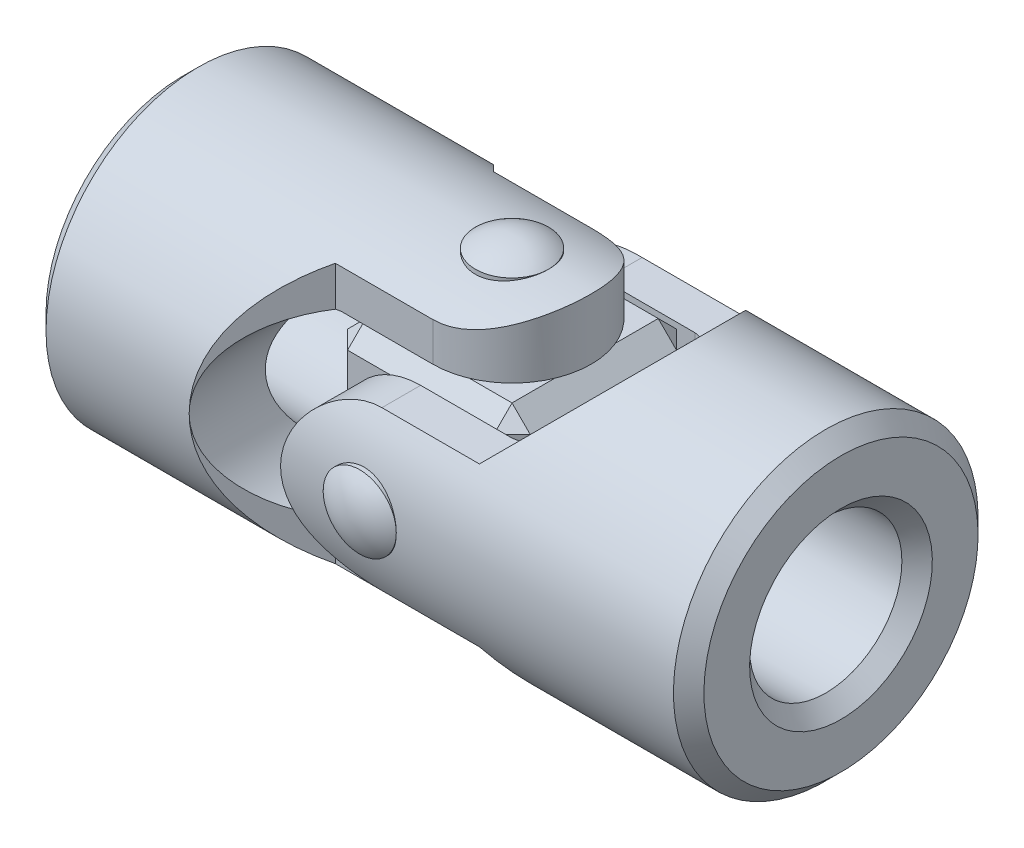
ISO-10303-21;
HEADER;
FILE_DESCRIPTION(('STEP AP214'),'2;1');
FILE_NAME('part.step','',(''),(''),'','','');
FILE_SCHEMA(('AUTOMOTIVE_DESIGN { 1 0 10303 214 1 1 1 1 }'));
ENDSEC;
DATA;
#1=APPLICATION_CONTEXT('core data for automotive mechanical design processes');
#2=APPLICATION_PROTOCOL_DEFINITION('international standard','automotive_design',2000,#1);
#3=PRODUCT_CONTEXT('',#1,'mechanical');
#4=PRODUCT('Part','Part','',(#3));
#5=PRODUCT_RELATED_PRODUCT_CATEGORY('part','',(#4));
#6=PRODUCT_DEFINITION_FORMATION('','',#4);
#7=PRODUCT_DEFINITION_CONTEXT('part definition',#1,'design');
#8=PRODUCT_DEFINITION('design','',#6,#7);
#9=PRODUCT_DEFINITION_SHAPE('','',#8);
#10=(LENGTH_UNIT() NAMED_UNIT(*) SI_UNIT(.MILLI.,.METRE.));
#11=(NAMED_UNIT(*) PLANE_ANGLE_UNIT() SI_UNIT($,.RADIAN.));
#12=(NAMED_UNIT(*) SI_UNIT($,.STERADIAN.) SOLID_ANGLE_UNIT());
#13=UNCERTAINTY_MEASURE_WITH_UNIT(LENGTH_MEASURE(1.E-05),#10,'distance_accuracy_value','');
#14=(GEOMETRIC_REPRESENTATION_CONTEXT(3) GLOBAL_UNCERTAINTY_ASSIGNED_CONTEXT((#13)) GLOBAL_UNIT_ASSIGNED_CONTEXT((#10,
#11,#12)) REPRESENTATION_CONTEXT('',''));
#15=CARTESIAN_POINT('',(0.,0.,0.));
#16=DIRECTION('',(0.,0.,1.));
#17=DIRECTION('',(1.,0.,0.));
#18=AXIS2_PLACEMENT_3D('',#15,#16,#17);
#19=CARTESIAN_POINT('',(0.,25.,0.));
#20=DIRECTION('',(0.,-1.,0.));
#21=DIRECTION('',(-1.,0.,0.));
#22=AXIS2_PLACEMENT_3D('',#19,#20,#21);
#23=CYLINDRICAL_SURFACE('',#22,6.);
#24=CARTESIAN_POINT('',(0.,25.,0.));
#25=DIRECTION('',(0.,1.,0.));
#26=DIRECTION('',(1.,0.,0.));
#27=AXIS2_PLACEMENT_3D('',#24,#25,#26);
#28=CIRCLE('',#27,6.);
#29=CARTESIAN_POINT('',(6.,25.,0.));
#30=VERTEX_POINT('',#29);
#31=EDGE_CURVE('P0_E10',#30,#30,#28,.T.);
#32=ORIENTED_EDGE('',*,*,#31,.F.);
#33=EDGE_LOOP('',(#32));
#34=FACE_BOUND('',#33,.T.);
#35=CARTESIAN_POINT('',(0.,-25.,0.));
#36=DIRECTION('',(0.,-1.,0.));
#37=DIRECTION('',(0.,0.,-1.));
#38=AXIS2_PLACEMENT_3D('',#35,#36,#37);
#39=CIRCLE('',#38,6.);
#40=CARTESIAN_POINT('',(0.,-25.,-6.));
#41=VERTEX_POINT('',#40);
#42=EDGE_CURVE('P0_E20',#41,#41,#39,.T.);
#43=ORIENTED_EDGE('',*,*,#42,.F.);
#44=EDGE_LOOP('',(#43));
#45=FACE_BOUND('',#44,.T.);
#46=ADVANCED_FACE('P0_F14',(#34,#45),#23,.T.);
#47=CARTESIAN_POINT('',(0.,17.,0.));
#48=DIRECTION('',(0.,-1.,0.));
#49=DIRECTION('',(0.,0.,-1.));
#50=AXIS2_PLACEMENT_3D('',#47,#48,#49);
#51=SPHERICAL_SURFACE('',#50,10.);
#52=ORIENTED_EDGE('',*,*,#31,.T.);
#53=EDGE_LOOP('',(#52));
#54=FACE_BOUND('',#53,.T.);
#55=ADVANCED_FACE('P0_F29',(#54),#51,.T.);
#56=CARTESIAN_POINT('',(0.,-17.,0.));
#57=DIRECTION('',(0.,1.,0.));
#58=DIRECTION('',(0.,0.,-1.));
#59=AXIS2_PLACEMENT_3D('',#56,#57,#58);
#60=SPHERICAL_SURFACE('',#59,10.);
#61=ORIENTED_EDGE('',*,*,#42,.T.);
#62=EDGE_LOOP('',(#61));
#63=FACE_BOUND('',#62,.T.);
#64=ADVANCED_FACE('P0_F26',(#63),#60,.T.);
#65=CLOSED_SHELL('',(#46,#55,#64));
#66=MANIFOLD_SOLID_BREP('P0_B1',#65);
#67=CARTESIAN_POINT('',(0.,0.,25.));
#68=DIRECTION('',(0.,0.,-1.));
#69=DIRECTION('',(-1.,0.,0.));
#70=AXIS2_PLACEMENT_3D('',#67,#68,#69);
#71=CYLINDRICAL_SURFACE('',#70,6.);
#72=CARTESIAN_POINT('',(0.,0.,25.));
#73=DIRECTION('',(0.,0.,1.));
#74=DIRECTION('',(1.,0.,0.));
#75=AXIS2_PLACEMENT_3D('',#72,#73,#74);
#76=CIRCLE('',#75,6.);
#77=CARTESIAN_POINT('',(6.,0.,25.));
#78=VERTEX_POINT('',#77);
#79=EDGE_CURVE('P1_E10',#78,#78,#76,.T.);
#80=ORIENTED_EDGE('',*,*,#79,.F.);
#81=EDGE_LOOP('',(#80));
#82=FACE_BOUND('',#81,.T.);
#83=CARTESIAN_POINT('',(0.,0.,-25.));
#84=DIRECTION('',(0.,0.,-1.));
#85=DIRECTION('',(0.,1.,0.));
#86=AXIS2_PLACEMENT_3D('',#83,#84,#85);
#87=CIRCLE('',#86,6.);
#88=CARTESIAN_POINT('',(0.,6.,-25.));
#89=VERTEX_POINT('',#88);
#90=EDGE_CURVE('P1_E20',#89,#89,#87,.T.);
#91=ORIENTED_EDGE('',*,*,#90,.F.);
#92=EDGE_LOOP('',(#91));
#93=FACE_BOUND('',#92,.T.);
#94=ADVANCED_FACE('P1_F14',(#82,#93),#71,.T.);
#95=CARTESIAN_POINT('',(0.,0.,17.));
#96=DIRECTION('',(0.,0.,-1.));
#97=DIRECTION('',(0.,1.,0.));
#98=AXIS2_PLACEMENT_3D('',#95,#96,#97);
#99=SPHERICAL_SURFACE('',#98,10.);
#100=ORIENTED_EDGE('',*,*,#79,.T.);
#101=EDGE_LOOP('',(#100));
#102=FACE_BOUND('',#101,.T.);
#103=ADVANCED_FACE('P1_F29',(#102),#99,.T.);
#104=CARTESIAN_POINT('',(0.,0.,-17.));
#105=DIRECTION('',(0.,0.,1.));
#106=DIRECTION('',(0.,1.,0.));
#107=AXIS2_PLACEMENT_3D('',#104,#105,#106);
#108=SPHERICAL_SURFACE('',#107,10.);
#109=ORIENTED_EDGE('',*,*,#90,.T.);
#110=EDGE_LOOP('',(#109));
#111=FACE_BOUND('',#110,.T.);
#112=ADVANCED_FACE('P1_F26',(#111),#108,.T.);
#113=CLOSED_SHELL('',(#94,#103,#112));
#114=MANIFOLD_SOLID_BREP('P1_B1',#113);
#115=CARTESIAN_POINT('',(0.,-25.,-13.));
#116=DIRECTION('',(0.,0.,1.));
#117=DIRECTION('',(1.,0.,0.));
#118=AXIS2_PLACEMENT_3D('',#115,#116,#117);
#119=PLANE('',#118);
#120=DIRECTION('',(0.,1.,0.));
#121=VECTOR('',#120,1.);
#122=CARTESIAN_POINT('',(0.,-25.,-13.));
#123=LINE('',#122,#121);
#124=CARTESIAN_POINT('',(0.,15.,-13.));
#125=VERTEX_POINT('',#124);
#126=CARTESIAN_POINT('',(0.,21.3541565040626,-13.));
#127=VERTEX_POINT('',#126);
#128=EDGE_CURVE('P2_E282',#125,#127,#123,.T.);
#129=ORIENTED_EDGE('',*,*,#128,.F.);
#130=DIRECTION('',(-1.,0.,0.));
#131=VECTOR('',#130,1.);
#132=CARTESIAN_POINT('',(0.,15.,-13.));
#133=LINE('',#132,#131);
#134=CARTESIAN_POINT('',(-15.,15.,-13.));
#135=VERTEX_POINT('',#134);
#136=EDGE_CURVE('P2_E132',#125,#135,#133,.T.);
#137=ORIENTED_EDGE('',*,*,#136,.T.);
#138=CARTESIAN_POINT('',(-12.8461538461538,0.,-13.));
#139=DIRECTION('',(0.,0.,1.));
#140=DIRECTION('',(1.,0.,0.));
#141=AXIS2_PLACEMENT_3D('',#138,#139,#140);
#142=CIRCLE('',#141,15.1538461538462);
#143=CARTESIAN_POINT('',(-16.,14.8220210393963,-13.));
#144=VERTEX_POINT('',#143);
#145=EDGE_CURVE('P2_E146',#135,#144,#142,.T.);
#146=ORIENTED_EDGE('',*,*,#145,.T.);
#147=DIRECTION('',(0.,1.,0.));
#148=VECTOR('',#147,1.);
#149=CARTESIAN_POINT('',(-16.,-25.,-13.));
#150=LINE('',#149,#148);
#151=CARTESIAN_POINT('',(-16.,21.3541565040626,-13.));
#152=VERTEX_POINT('',#151);
#153=EDGE_CURVE('P2_E289',#144,#152,#150,.T.);
#154=ORIENTED_EDGE('',*,*,#153,.T.);
#155=DIRECTION('',(1.,0.,0.));
#156=VECTOR('',#155,1.);
#157=CARTESIAN_POINT('',(-54.,21.3541565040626,-13.));
#158=LINE('',#157,#156);
#159=EDGE_CURVE('P2_E227',#127,#152,#158,.F.);
#160=ORIENTED_EDGE('',*,*,#159,.F.);
#161=EDGE_LOOP('',(#129,#137,#146,#154,#160));
#162=FACE_BOUND('',#161,.T.);
#163=ADVANCED_FACE('P2_F16',(#162),#119,.F.);
#164=CARTESIAN_POINT('',(-16.,-25.,-13.));
#165=DIRECTION('',(-0.707106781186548,0.,0.707106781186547));
#166=DIRECTION('',(0.707106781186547,0.,0.707106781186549));
#167=AXIS2_PLACEMENT_3D('',#164,#165,#166);
#168=PLANE('',#167);
#169=CARTESIAN_POINT('',(-3.00000000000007,0.,0.));
#170=DIRECTION('',(-0.707106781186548,0.,0.707106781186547));
#171=DIRECTION('',(0.707106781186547,0.,0.707106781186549));
#172=AXIS2_PLACEMENT_3D('',#169,#170,#171);
#173=ELLIPSE('',#172,35.3553390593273,25.);
#174=CARTESIAN_POINT('',(-28.,0.,-25.));
#175=VERTEX_POINT('',#174);
#176=CARTESIAN_POINT('',(-16.,-21.3541565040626,-13.));
#177=VERTEX_POINT('',#176);
#178=EDGE_CURVE('P2_E230',#175,#177,#173,.T.);
#179=ORIENTED_EDGE('',*,*,#178,.F.);
#180=CARTESIAN_POINT('',(-12.8461538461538,0.,-9.84615384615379));
#181=DIRECTION('',(-0.707106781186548,0.,0.707106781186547));
#182=DIRECTION('',(-0.707106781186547,0.,-0.707106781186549));
#183=AXIS2_PLACEMENT_3D('',#180,#181,#182);
#184=ELLIPSE('',#183,21.4307747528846,15.1538461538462);
#185=CARTESIAN_POINT('',(-16.,-14.8220210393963,-13.));
#186=VERTEX_POINT('',#185);
#187=EDGE_CURVE('P2_E143',#175,#186,#184,.T.);
#188=ORIENTED_EDGE('',*,*,#187,.T.);
#189=EDGE_CURVE('P2_E286',#177,#186,#150,.T.);
#190=ORIENTED_EDGE('',*,*,#189,.F.);
#191=EDGE_LOOP('',(#179,#188,#190));
#192=FACE_BOUND('',#191,.T.);
#193=ADVANCED_FACE('P2_F181',(#192),#168,.F.);
#194=CARTESIAN_POINT('',(-16.,-25.,13.));
#195=DIRECTION('',(-0.707106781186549,0.,-0.707106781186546));
#196=DIRECTION('',(-0.707106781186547,0.,0.707106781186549));
#197=AXIS2_PLACEMENT_3D('',#194,#195,#196);
#198=PLANE('',#197);
#199=DIRECTION('',(0.,1.,0.));
#200=VECTOR('',#199,1.);
#201=CARTESIAN_POINT('',(-16.,-25.,13.));
#202=LINE('',#201,#200);
#203=CARTESIAN_POINT('',(-16.,-21.3541565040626,13.));
#204=VERTEX_POINT('',#203);
#205=CARTESIAN_POINT('',(-16.,-14.8220210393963,13.));
#206=VERTEX_POINT('',#205);
#207=EDGE_CURVE('P2_E39',#204,#206,#202,.T.);
#208=ORIENTED_EDGE('',*,*,#207,.T.);
#209=CARTESIAN_POINT('',(-12.8461538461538,0.,9.8461538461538));
#210=DIRECTION('',(-0.707106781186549,0.,-0.707106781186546));
#211=DIRECTION('',(0.707106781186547,0.,-0.707106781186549));
#212=AXIS2_PLACEMENT_3D('',#209,#210,#211);
#213=ELLIPSE('',#212,21.4307747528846,15.1538461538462);
#214=CARTESIAN_POINT('',(-28.,0.,25.));
#215=VERTEX_POINT('',#214);
#216=EDGE_CURVE('P2_E107',#206,#215,#213,.T.);
#217=ORIENTED_EDGE('',*,*,#216,.T.);
#218=CARTESIAN_POINT('',(-3.00000000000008,0.,0.));
#219=DIRECTION('',(-0.707106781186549,0.,-0.707106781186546));
#220=DIRECTION('',(0.707106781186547,0.,-0.707106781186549));
#221=AXIS2_PLACEMENT_3D('',#218,#219,#220);
#222=ELLIPSE('',#221,35.3553390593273,25.);
#223=EDGE_CURVE('P2_E241',#204,#215,#222,.T.);
#224=ORIENTED_EDGE('',*,*,#223,.F.);
#225=EDGE_LOOP('',(#208,#217,#224));
#226=FACE_BOUND('',#225,.T.);
#227=ADVANCED_FACE('P2_F185',(#226),#198,.F.);
#228=CARTESIAN_POINT('',(0.,-25.,13.));
#229=DIRECTION('',(0.,0.,-1.));
#230=DIRECTION('',(-1.,0.,0.));
#231=AXIS2_PLACEMENT_3D('',#228,#229,#230);
#232=PLANE('',#231);
#233=CARTESIAN_POINT('',(-12.8461538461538,0.,13.));
#234=DIRECTION('',(0.,0.,-1.));
#235=DIRECTION('',(-1.,0.,0.));
#236=AXIS2_PLACEMENT_3D('',#233,#234,#235);
#237=CIRCLE('',#236,15.1538461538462);
#238=CARTESIAN_POINT('',(-16.,14.8220210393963,13.));
#239=VERTEX_POINT('',#238);
#240=CARTESIAN_POINT('',(-15.,15.,13.));
#241=VERTEX_POINT('',#240);
#242=EDGE_CURVE('P2_E108',#239,#241,#237,.T.);
#243=ORIENTED_EDGE('',*,*,#242,.T.);
#244=DIRECTION('',(1.,0.,0.));
#245=VECTOR('',#244,1.);
#246=CARTESIAN_POINT('',(0.,15.,13.));
#247=LINE('',#246,#245);
#248=CARTESIAN_POINT('',(0.,15.,13.));
#249=VERTEX_POINT('',#248);
#250=EDGE_CURVE('P2_E129',#241,#249,#247,.T.);
#251=ORIENTED_EDGE('',*,*,#250,.T.);
#252=DIRECTION('',(0.,1.,0.));
#253=VECTOR('',#252,1.);
#254=CARTESIAN_POINT('',(0.,-25.,13.));
#255=LINE('',#254,#253);
#256=CARTESIAN_POINT('',(0.,21.3541565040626,13.));
#257=VERTEX_POINT('',#256);
#258=EDGE_CURVE('P2_E154',#249,#257,#255,.T.);
#259=ORIENTED_EDGE('',*,*,#258,.T.);
#260=DIRECTION('',(1.,0.,0.));
#261=VECTOR('',#260,1.);
#262=CARTESIAN_POINT('',(-54.,21.3541565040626,13.));
#263=LINE('',#262,#261);
#264=CARTESIAN_POINT('',(-16.,21.3541565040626,13.));
#265=VERTEX_POINT('',#264);
#266=EDGE_CURVE('P2_E244',#265,#257,#263,.T.);
#267=ORIENTED_EDGE('',*,*,#266,.F.);
#268=EDGE_CURVE('P2_E292',#239,#265,#202,.T.);
#269=ORIENTED_EDGE('',*,*,#268,.F.);
#270=EDGE_LOOP('',(#243,#251,#259,#267,#269));
#271=FACE_BOUND('',#270,.T.);
#272=ADVANCED_FACE('P2_F188',(#271),#232,.F.);
#273=CARTESIAN_POINT('',(0.,-25.,0.));
#274=DIRECTION('',(0.,1.,0.));
#275=DIRECTION('',(0.,0.,-1.));
#276=AXIS2_PLACEMENT_3D('',#273,#274,#275);
#277=CYLINDRICAL_SURFACE('',#276,13.);
#278=ORIENTED_EDGE('',*,*,#258,.F.);
#279=CARTESIAN_POINT('',(0.,15.,0.));
#280=DIRECTION('',(0.,1.,0.));
#281=DIRECTION('',(1.,0.,0.));
#282=AXIS2_PLACEMENT_3D('',#279,#280,#281);
#283=CIRCLE('',#282,13.);
#284=EDGE_CURVE('P2_E109',#249,#125,#283,.T.);
#285=ORIENTED_EDGE('',*,*,#284,.T.);
#286=ORIENTED_EDGE('',*,*,#128,.T.);
#287=CARTESIAN_POINT('',(0.,21.3541565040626,13.));
#288=CARTESIAN_POINT('',(0.169161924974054,21.3541522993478,13.0000013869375));
#289=CARTESIAN_POINT('',(0.338299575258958,21.3561674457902,12.9966974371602));
#290=CARTESIAN_POINT('',(0.676215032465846,21.3641935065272,12.9835019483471));
#291=CARTESIAN_POINT('',(0.844992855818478,21.3702042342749,12.9736107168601));
#292=CARTESIAN_POINT('',(1.35003674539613,21.394151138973,12.9341142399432));
#293=CARTESIAN_POINT('',(1.68532226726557,21.4180021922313,12.8946861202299));
#294=CARTESIAN_POINT('',(2.3483469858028,21.4803717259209,12.7905142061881));
#295=CARTESIAN_POINT('',(2.67611989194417,21.5187991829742,12.7259274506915));
#296=CARTESIAN_POINT('',(3.32403809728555,21.6089401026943,12.5722563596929));
#297=CARTESIAN_POINT('',(3.64418240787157,21.6606552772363,12.4831688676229));
#298=CARTESIAN_POINT('',(4.27404757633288,21.7754859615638,12.2817586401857));
#299=CARTESIAN_POINT('',(4.58379211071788,21.8385731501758,12.1694935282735));
#300=CARTESIAN_POINT('',(5.19207150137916,21.9742960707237,11.9226730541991));
#301=CARTESIAN_POINT('',(5.4906065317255,22.0469316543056,11.7881180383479));
#302=CARTESIAN_POINT('',(6.07556058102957,22.1998334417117,11.4975809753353));
#303=CARTESIAN_POINT('',(6.36196182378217,22.2801103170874,11.3415688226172));
#304=CARTESIAN_POINT('',(6.9211741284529,22.4461873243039,11.00923204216));
#305=CARTESIAN_POINT('',(7.19398012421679,22.5319894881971,10.8328999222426));
#306=CARTESIAN_POINT('',(7.74847978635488,22.7148514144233,10.44440533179));
#307=CARTESIAN_POINT('',(8.02881332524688,22.8122344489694,10.2304517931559));
#308=CARTESIAN_POINT('',(8.57087300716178,23.0086078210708,9.78080538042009));
#309=CARTESIAN_POINT('',(8.83259813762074,23.1075982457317,9.54511132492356));
#310=CARTESIAN_POINT('',(9.33634544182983,23.3047978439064,9.05299312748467));
#311=CARTESIAN_POINT('',(9.57835893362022,23.4030066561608,8.79655994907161));
#312=CARTESIAN_POINT('',(10.0412133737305,23.5962233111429,8.26428359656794));
#313=CARTESIAN_POINT('',(10.2620613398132,23.6912322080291,7.98844690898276));
#314=CARTESIAN_POINT('',(10.697048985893,23.8827533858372,7.39714352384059));
#315=CARTESIAN_POINT('',(10.9094482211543,23.9788455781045,7.08025594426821));
#316=CARTESIAN_POINT('',(11.3065719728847,24.1621094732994,6.42709193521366));
#317=CARTESIAN_POINT('',(11.4912947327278,24.2492806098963,6.09081427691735));
#318=CARTESIAN_POINT('',(11.8311176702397,24.4121509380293,5.4011429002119));
#319=CARTESIAN_POINT('',(11.9862329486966,24.4878559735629,5.04775802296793));
#320=CARTESIAN_POINT('',(12.2651157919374,24.6255629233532,4.3262530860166));
#321=CARTESIAN_POINT('',(12.3888870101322,24.6875664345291,3.95813474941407));
#322=CARTESIAN_POINT('',(12.5952759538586,24.7918065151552,3.23856386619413));
#323=CARTESIAN_POINT('',(12.6803046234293,24.8351863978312,2.88796777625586));
#324=CARTESIAN_POINT('',(12.8210908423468,24.9073624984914,2.17946049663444));
#325=CARTESIAN_POINT('',(12.8768497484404,24.9361593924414,1.82154964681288));
#326=CARTESIAN_POINT('',(12.9583029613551,24.9783186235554,1.10161379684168));
#327=CARTESIAN_POINT('',(12.9840135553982,24.9916893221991,0.739591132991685));
#328=CARTESIAN_POINT('',(13.0050503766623,25.0026247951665,0.0144353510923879));
#329=CARTESIAN_POINT('',(13.000378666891,25.0001906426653,-0.348697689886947));
#330=CARTESIAN_POINT('',(12.9625964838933,24.9805663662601,-1.03877317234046));
#331=CARTESIAN_POINT('',(12.9322006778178,24.964784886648,-1.36590872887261));
#332=CARTESIAN_POINT('',(12.8469009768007,24.9207048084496,-2.01609036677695));
#333=CARTESIAN_POINT('',(12.7919989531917,24.8924071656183,-2.33913675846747));
#334=CARTESIAN_POINT('',(12.6583028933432,24.8239670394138,-2.97895838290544));
#335=CARTESIAN_POINT('',(12.579508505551,24.783824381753,-3.2957335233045));
#336=CARTESIAN_POINT('',(12.3988512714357,24.6926190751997,-3.92102079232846));
#337=CARTESIAN_POINT('',(12.2969875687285,24.6415560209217,-4.22953261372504));
#338=CARTESIAN_POINT('',(12.0697240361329,24.5289293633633,-4.84038374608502));
#339=CARTESIAN_POINT('',(11.9440407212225,24.4672401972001,-5.14259423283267));
#340=CARTESIAN_POINT('',(11.6711093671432,24.3351707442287,-5.73512089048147));
#341=CARTESIAN_POINT('',(11.5238613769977,24.2647904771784,-6.02543708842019));
#342=CARTESIAN_POINT('',(11.208907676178,24.116805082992,-6.5928516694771));
#343=CARTESIAN_POINT('',(11.0411998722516,24.0391992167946,-6.86994869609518));
#344=CARTESIAN_POINT('',(10.6863871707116,23.8783136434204,-7.40982585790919));
#345=CARTESIAN_POINT('',(10.4992752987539,23.7950318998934,-7.67260079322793));
#346=CARTESIAN_POINT('',(10.0871612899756,23.6159484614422,-8.20819450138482));
#347=CARTESIAN_POINT('',(9.86024135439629,23.5197267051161,-8.47939901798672));
#348=CARTESIAN_POINT('',(9.38559128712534,23.3247187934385,-9.00196036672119));
#349=CARTESIAN_POINT('',(9.13785966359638,23.2259324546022,-9.25331577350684));
#350=CARTESIAN_POINT('',(8.62258083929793,23.0280754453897,-9.73527957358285));
#351=CARTESIAN_POINT('',(8.35501432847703,22.9290045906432,-9.96586725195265));
#352=CARTESIAN_POINT('',(7.80149190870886,22.7331536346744,-10.4048790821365));
#353=CARTESIAN_POINT('',(7.51553602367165,22.6363735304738,-10.6133032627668));
#354=CARTESIAN_POINT('',(6.90475043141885,22.4407186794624,-11.0212990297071));
#355=CARTESIAN_POINT('',(6.57860862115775,22.3422140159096,-11.2190900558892));
#356=CARTESIAN_POINT('',(5.90814240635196,22.1540661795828,-11.586195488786));
#357=CARTESIAN_POINT('',(5.56381549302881,22.0644242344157,-11.7555059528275));
#358=CARTESIAN_POINT('',(4.85981744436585,21.8975152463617,-12.0635594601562));
#359=CARTESIAN_POINT('',(4.50018313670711,21.820220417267,-12.2023714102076));
#360=CARTESIAN_POINT('',(3.76737865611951,21.680958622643,-12.4481341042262));
#361=CARTESIAN_POINT('',(3.39421434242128,21.6189851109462,-12.5550984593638));
#362=CARTESIAN_POINT('',(2.77089606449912,21.5318117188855,-12.7037642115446));
#363=CARTESIAN_POINT('',(2.52374665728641,21.5013496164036,-12.7551799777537));
#364=CARTESIAN_POINT('',(2.02606732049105,21.4486306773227,-12.8436323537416));
#365=CARTESIAN_POINT('',(1.77553835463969,21.4263715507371,-12.8806729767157));
#366=CARTESIAN_POINT('',(1.27150550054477,21.390499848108,-12.9401620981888));
#367=CARTESIAN_POINT('',(1.01799578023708,21.376908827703,-12.9625742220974));
#368=CARTESIAN_POINT('',(0.509662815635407,21.3587173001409,-12.99250734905));
#369=CARTESIAN_POINT('',(0.254839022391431,21.35412091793,-13.0000215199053));
#370=CARTESIAN_POINT('',(0.,21.3541565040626,-13.));
#371=B_SPLINE_CURVE_WITH_KNOTS('',3,(#287,#288,#289,#290,#291,#292,#293,#294,#295,#296,#297,
#298,#299,#300,#301,#302,#303,#304,#305,#306,#307,#308,#309,#310,#311,#312,#313,#314,#315,#316,
#317,#318,#319,#320,#321,#322,#323,#324,#325,#326,#327,#328,#329,#330,#331,#332,#333,#334,#335,
#336,#337,#338,#339,#340,#341,#342,#343,#344,#345,#346,#347,#348,#349,#350,#351,#352,#353,#354,
#355,#356,#357,#358,#359,#360,#361,#362,#363,#364,#365,#366,#367,#368,#369,#370),.UNSPECIFIED.,
.F.,.F.,(4,2,2,2,2,2,2,2,2,2,2,2,2,2,2,2,2,2,2,2,2,2,2,2,2,2,2,2,2,2,2,2,2,2,2,2,2,2,2,2,2,4),
(0.,0.507393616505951,1.0147635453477,2.02857977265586,3.03616668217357,4.04388346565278,
5.04912443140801,6.05434978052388,7.06100018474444,8.06802294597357,9.16442241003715,
10.260881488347,11.357820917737,12.4543953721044,13.6330766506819,14.8118327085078,
15.9899859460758,17.1680017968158,18.2565843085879,19.3451163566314,20.4330581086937,
21.5209259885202,22.5065289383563,23.4920566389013,24.4775988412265,25.4631776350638,
26.4613206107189,27.459461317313,28.4577042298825,29.4563071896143,30.5545561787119,
31.6528839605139,32.7522954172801,33.8517054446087,35.0320315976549,36.2125210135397,
37.3903152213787,38.5676053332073,39.3299199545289,40.0920216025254,40.8560111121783,
41.6203509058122),.UNSPECIFIED.);
#372=EDGE_CURVE('P2_E203',#257,#127,#371,.T.);
#373=ORIENTED_EDGE('',*,*,#372,.F.);
#374=EDGE_LOOP('',(#278,#285,#286,#373));
#375=FACE_BOUND('',#374,.T.);
#376=ADVANCED_FACE('P2_F192',(#375),#277,.T.);
#377=CARTESIAN_POINT('',(-54.,0.,0.));
#378=DIRECTION('',(-1.,0.,0.));
#379=DIRECTION('',(0.,0.,1.));
#380=AXIS2_PLACEMENT_3D('',#377,#378,#379);
#381=PLANE('',#380);
#382=CARTESIAN_POINT('',(-54.,0.,0.));
#383=DIRECTION('',(-1.,0.,0.));
#384=DIRECTION('',(0.,0.,1.));
#385=AXIS2_PLACEMENT_3D('',#382,#383,#384);
#386=CIRCLE('',#385,15.);
#387=CARTESIAN_POINT('',(-54.,0.,15.));
#388=VERTEX_POINT('',#387);
#389=EDGE_CURVE('P2_E24',#388,#388,#386,.F.);
#390=ORIENTED_EDGE('',*,*,#389,.T.);
#391=EDGE_LOOP('',(#390));
#392=FACE_BOUND('',#391,.T.);
#393=CARTESIAN_POINT('',(-54.,0.,0.));
#394=DIRECTION('',(-1.,0.,0.));
#395=DIRECTION('',(0.,0.,1.));
#396=AXIS2_PLACEMENT_3D('',#393,#394,#395);
#397=CIRCLE('',#396,22.5);
#398=CARTESIAN_POINT('',(-54.,0.,22.5));
#399=VERTEX_POINT('',#398);
#400=EDGE_CURVE('P2_E254',#399,#399,#397,.T.);
#401=ORIENTED_EDGE('',*,*,#400,.T.);
#402=EDGE_LOOP('',(#401));
#403=FACE_BOUND('',#402,.T.);
#404=ADVANCED_FACE('P2_F213',(#392,#403),#381,.T.);
#405=CARTESIAN_POINT('',(-54.,0.,0.));
#406=DIRECTION('',(1.,0.,0.));
#407=DIRECTION('',(0.,0.,-1.));
#408=AXIS2_PLACEMENT_3D('',#405,#406,#407);
#409=CYLINDRICAL_SURFACE('',#408,25.);
#410=CARTESIAN_POINT('',(-51.5,0.,0.));
#411=DIRECTION('',(-1.,0.,0.));
#412=DIRECTION('',(0.,0.,1.));
#413=AXIS2_PLACEMENT_3D('',#410,#411,#412);
#414=CIRCLE('',#413,25.);
#415=CARTESIAN_POINT('',(-51.5,0.,25.));
#416=VERTEX_POINT('',#415);
#417=EDGE_CURVE('P2_E11',#416,#416,#414,.F.);
#418=ORIENTED_EDGE('',*,*,#417,.T.);
#419=EDGE_LOOP('',(#418));
#420=FACE_BOUND('',#419,.T.);
#421=CARTESIAN_POINT('',(6.,-25.,0.));
#422=CARTESIAN_POINT('',(6.00000456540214,-25.0000026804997,-0.166017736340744));
#423=CARTESIAN_POINT('',(5.99310833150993,-24.9983437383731,-0.331984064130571));
#424=CARTESIAN_POINT('',(5.96559099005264,-24.9917601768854,-0.662757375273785));
#425=CARTESIAN_POINT('',(5.9449681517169,-24.9868351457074,-0.827564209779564));
#426=CARTESIAN_POINT('',(5.89015358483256,-24.9738504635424,-1.15483168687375));
#427=CARTESIAN_POINT('',(5.85595704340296,-24.9657897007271,-1.31729147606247));
#428=CARTESIAN_POINT('',(5.77426192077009,-24.9467537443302,-1.63872050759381));
#429=CARTESIAN_POINT('',(5.72675843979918,-24.9357774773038,-1.79768844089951));
#430=CARTESIAN_POINT('',(5.61891540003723,-24.9112316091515,-2.11072366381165));
#431=CARTESIAN_POINT('',(5.55859573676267,-24.897666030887,-2.26479812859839));
#432=CARTESIAN_POINT('',(5.42551265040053,-24.8682925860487,-2.56731972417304));
#433=CARTESIAN_POINT('',(5.35274463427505,-24.8524838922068,-2.71576475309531));
#434=CARTESIAN_POINT('',(5.19534290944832,-24.8190587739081,-3.00593509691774));
#435=CARTESIAN_POINT('',(5.11071372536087,-24.8014430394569,-3.14766294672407));
#436=CARTESIAN_POINT('',(4.93012876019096,-24.7648612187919,-3.42359889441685));
#437=CARTESIAN_POINT('',(4.83416872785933,-24.7458946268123,-3.55780414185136));
#438=CARTESIAN_POINT('',(4.62989450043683,-24.7067947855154,-3.81996752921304));
#439=CARTESIAN_POINT('',(4.52140013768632,-24.6866473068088,-3.94778319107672));
#440=CARTESIAN_POINT('',(4.2940876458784,-24.6460277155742,-4.19391043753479));
#441=CARTESIAN_POINT('',(4.17526570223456,-24.6255554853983,-4.31221847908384));
#442=CARTESIAN_POINT('',(3.92814913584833,-24.5848634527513,-4.53846894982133));
#443=CARTESIAN_POINT('',(3.79985699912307,-24.5646435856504,-4.64641408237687));
#444=CARTESIAN_POINT('',(3.53456313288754,-24.5250062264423,-4.85128465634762));
#445=CARTESIAN_POINT('',(3.39755820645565,-24.5055890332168,-4.94820601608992));
#446=CARTESIAN_POINT('',(3.11391094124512,-24.4678652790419,-5.1315149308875));
#447=CARTESIAN_POINT('',(2.96716507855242,-24.4495768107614,-5.21774615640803));
#448=CARTESIAN_POINT('',(2.66664581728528,-24.4149279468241,-5.37754406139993));
#449=CARTESIAN_POINT('',(2.51286979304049,-24.3985682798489,-5.45110595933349));
#450=CARTESIAN_POINT('',(2.1994677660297,-24.3682865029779,-5.58492026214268));
#451=CARTESIAN_POINT('',(2.03984464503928,-24.354363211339,-5.64517912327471));
#452=CARTESIAN_POINT('',(1.71585287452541,-24.3293636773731,-5.75195806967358));
#453=CARTESIAN_POINT('',(1.55148254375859,-24.318288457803,-5.79847322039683));
#454=CARTESIAN_POINT('',(1.05919919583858,-24.2902598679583,-5.91523377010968));
#455=CARTESIAN_POINT('',(0.725874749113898,-24.2778811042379,-5.96534620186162));
#456=CARTESIAN_POINT('',(0.2235243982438,-24.2697663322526,-5.99819895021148));
#457=CARTESIAN_POINT('',(0.0556145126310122,-24.2688053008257,-6.00209048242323));
#458=CARTESIAN_POINT('',(-0.279946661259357,-24.2703574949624,-5.99581246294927));
#459=CARTESIAN_POINT('',(-0.447597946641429,-24.2728707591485,-5.98564275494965));
#460=CARTESIAN_POINT('',(-0.94076456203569,-24.285368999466,-5.93483975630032));
#461=CARTESIAN_POINT('',(-1.26433890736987,-24.3001939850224,-5.87440247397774));
#462=CARTESIAN_POINT('',(-1.89644485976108,-24.3412549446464,-5.70184242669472));
#463=CARTESIAN_POINT('',(-2.20497546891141,-24.3674916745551,-5.58971623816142));
#464=CARTESIAN_POINT('',(-2.80181231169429,-24.4286958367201,-5.3158825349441));
#465=CARTESIAN_POINT('',(-3.08990124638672,-24.4637429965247,-5.15371899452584));
#466=CARTESIAN_POINT('',(-3.63521266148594,-24.5385748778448,-4.78473374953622));
#467=CARTESIAN_POINT('',(-3.89243012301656,-24.5783603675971,-4.57790479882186));
#468=CARTESIAN_POINT('',(-4.37578612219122,-24.6594640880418,-4.11902988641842));
#469=CARTESIAN_POINT('',(-4.60093392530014,-24.7007951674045,-3.86594129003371));
#470=CARTESIAN_POINT('',(-5.00576971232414,-24.7793903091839,-3.32511184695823));
#471=CARTESIAN_POINT('',(-5.18545651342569,-24.8166542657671,-3.03737009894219));
#472=CARTESIAN_POINT('',(-5.49459436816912,-24.8830789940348,-2.43405695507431));
#473=CARTESIAN_POINT('',(-5.62389489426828,-24.9122154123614,-2.11840557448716));
#474=CARTESIAN_POINT('',(-5.82733017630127,-24.9589240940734,-1.46899521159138));
#475=CARTESIAN_POINT('',(-5.90147463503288,-24.9764983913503,-1.13523942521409));
#476=CARTESIAN_POINT('',(-5.9910041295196,-24.9978055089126,-0.467574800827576));
#477=CARTESIAN_POINT('',(-6.00773980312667,-25.0018564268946,-0.133856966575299));
#478=CARTESIAN_POINT('',(-5.98566644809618,-24.9965614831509,0.531608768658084));
#479=CARTESIAN_POINT('',(-5.94686200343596,-24.9872167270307,0.863356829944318));
#480=CARTESIAN_POINT('',(-5.81592611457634,-24.9563832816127,1.51084514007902));
#481=CARTESIAN_POINT('',(-5.72452204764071,-24.9350603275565,1.8267410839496));
#482=CARTESIAN_POINT('',(-5.49180334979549,-24.8826669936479,2.4387066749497));
#483=CARTESIAN_POINT('',(-5.35048391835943,-24.8515956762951,2.73477441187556));
#484=CARTESIAN_POINT('',(-5.01926782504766,-24.7823820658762,3.30412273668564));
#485=CARTESIAN_POINT('',(-4.82860237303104,-24.7441307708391,3.57694246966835));
#486=CARTESIAN_POINT('',(-4.40508233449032,-24.6649871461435,4.08719914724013));
#487=CARTESIAN_POINT('',(-4.17222106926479,-24.6240943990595,4.32463047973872));
#488=CARTESIAN_POINT('',(-3.66473287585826,-24.5431489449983,4.76284500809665));
#489=CARTESIAN_POINT('',(-3.38928458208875,-24.5031358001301,4.96268414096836));
#490=CARTESIAN_POINT('',(-2.80776432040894,-24.4295058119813,5.31333575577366));
#491=CARTESIAN_POINT('',(-2.50169372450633,-24.395888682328,5.46415043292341));
#492=CARTESIAN_POINT('',(-2.02740631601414,-24.353347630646,5.64963439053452));
#493=CARTESIAN_POINT('',(-1.86719304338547,-24.3405033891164,5.70458710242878));
#494=CARTESIAN_POINT('',(-1.54251797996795,-24.3177552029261,5.80079732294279));
#495=CARTESIAN_POINT('',(-1.37805781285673,-24.3078501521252,5.84205998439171));
#496=CARTESIAN_POINT('',(-1.04608209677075,-24.2912903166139,5.91053741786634));
#497=CARTESIAN_POINT('',(-0.878566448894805,-24.2846356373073,5.93775173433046));
#498=CARTESIAN_POINT('',(-0.541733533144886,-24.2747841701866,5.97789965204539));
#499=CARTESIAN_POINT('',(-0.372416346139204,-24.2715872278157,5.99083389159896));
#500=CARTESIAN_POINT('',(-0.0377512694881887,-24.2687899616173,6.00215499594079));
#501=CARTESIAN_POINT('',(0.127583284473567,-24.2690968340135,6.00091722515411));
#502=CARTESIAN_POINT('',(0.457543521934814,-24.2730742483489,5.98480872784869));
#503=CARTESIAN_POINT('',(0.622169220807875,-24.2767447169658,5.96993829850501));
#504=CARTESIAN_POINT('',(0.94955460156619,-24.2873399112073,5.92668661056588));
#505=CARTESIAN_POINT('',(1.11231398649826,-24.294265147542,5.89830323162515));
#506=CARTESIAN_POINT('',(1.4347302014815,-24.3111608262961,5.82827196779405));
#507=CARTESIAN_POINT('',(1.59438810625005,-24.3211301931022,5.78662876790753));
#508=CARTESIAN_POINT('',(1.90880751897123,-24.3437686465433,5.69063662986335));
#509=CARTESIAN_POINT('',(2.06358862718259,-24.3564247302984,5.63634876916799));
#510=CARTESIAN_POINT('',(2.36795338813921,-24.3840980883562,5.51539707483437));
#511=CARTESIAN_POINT('',(2.51753882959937,-24.3991145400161,5.44873755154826));
#512=CARTESIAN_POINT('',(2.81066216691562,-24.4310987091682,5.30348427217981));
#513=CARTESIAN_POINT('',(2.9541973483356,-24.4480672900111,5.22488523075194));
#514=CARTESIAN_POINT('',(3.23419114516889,-24.4834782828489,5.05635243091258));
#515=CARTESIAN_POINT('',(3.37065208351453,-24.5019202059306,4.96642242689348));
#516=CARTESIAN_POINT('',(3.63895038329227,-24.5402505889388,4.77346921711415));
#517=CARTESIAN_POINT('',(3.77059233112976,-24.5601634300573,4.67017903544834));
#518=CARTESIAN_POINT('',(4.02470841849,-24.600458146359,4.45304880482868));
#519=CARTESIAN_POINT('',(4.14718568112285,-24.6208398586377,4.33921237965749));
#520=CARTESIAN_POINT('',(4.38229311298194,-24.661530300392,4.10164015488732));
#521=CARTESIAN_POINT('',(4.49491742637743,-24.6818389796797,3.97789855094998));
#522=CARTESIAN_POINT('',(4.70944810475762,-24.7218081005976,3.7214296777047));
#523=CARTESIAN_POINT('',(4.81135836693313,-24.7414687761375,3.58870570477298));
#524=CARTESIAN_POINT('',(5.00542392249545,-24.7799327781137,3.31280088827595));
#525=CARTESIAN_POINT('',(5.09738724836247,-24.7987162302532,3.16948213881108));
#526=CARTESIAN_POINT('',(5.2688530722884,-24.8345280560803,2.87543817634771));
#527=CARTESIAN_POINT('',(5.3483601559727,-24.8515570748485,2.72471571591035));
#528=CARTESIAN_POINT('',(5.49431228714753,-24.883375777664,2.41692354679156));
#529=CARTESIAN_POINT('',(5.5607634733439,-24.8981665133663,2.25985686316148));
#530=CARTESIAN_POINT('',(5.68010427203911,-24.9250921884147,1.94048744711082));
#531=CARTESIAN_POINT('',(5.73299605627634,-24.9372275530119,1.77818555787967));
#532=CARTESIAN_POINT('',(5.85202517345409,-24.9647957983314,1.35190448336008));
#533=CARTESIAN_POINT('',(5.90742414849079,-24.9779181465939,1.08469226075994));
#534=CARTESIAN_POINT('',(5.98140664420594,-24.9955177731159,0.544940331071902));
#535=CARTESIAN_POINT('',(5.99999250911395,-24.9999956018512,0.272400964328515));
#536=CARTESIAN_POINT('',(6.,-25.,0.));
#537=B_SPLINE_CURVE_WITH_KNOTS('',3,(#421,#422,#423,#424,#425,#426,#427,#428,#429,#430,#431,
#432,#433,#434,#435,#436,#437,#438,#439,#440,#441,#442,#443,#444,#445,#446,#447,#448,#449,#450,
#451,#452,#453,#454,#455,#456,#457,#458,#459,#460,#461,#462,#463,#464,#465,#466,#467,#468,#469,
#470,#471,#472,#473,#474,#475,#476,#477,#478,#479,#480,#481,#482,#483,#484,#485,#486,#487,#488,
#489,#490,#491,#492,#493,#494,#495,#496,#497,#498,#499,#500,#501,#502,#503,#504,#505,#506,#507,
#508,#509,#510,#511,#512,#513,#514,#515,#516,#517,#518,#519,#520,#521,#522,#523,#524,#525,#526,
#527,#528,#529,#530,#531,#532,#533,#534,#535,#536),.UNSPECIFIED.,.T.,.F.,(4,2,2,2,2,2,2,2,2,2,2,
2,2,2,2,2,2,2,2,2,2,2,2,2,2,2,2,2,2,2,2,2,2,2,2,2,2,2,2,2,2,2,2,2,2,2,2,2,2,2,2,2,2,2,2,2,2,4),
(0.,0.497813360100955,0.995689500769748,1.49374233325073,1.99197879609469,2.4894473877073,
2.98709992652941,3.4845631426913,3.98221359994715,4.48820831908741,4.99439073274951,
5.50044073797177,6.00667750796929,6.5196119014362,7.03273945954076,7.5456174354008,
8.05867933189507,9.06463756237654,9.56800871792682,10.0713854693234,11.0548629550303,
12.0384055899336,13.0311908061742,14.0241372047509,15.0430966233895,16.0620825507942,
17.0840897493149,18.1059171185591,19.1035329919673,20.1010665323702,21.085126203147,
22.069280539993,23.0698021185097,24.0704821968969,25.0936623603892,26.1167967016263,
26.6258643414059,27.1347401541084,27.6436324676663,28.1525020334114,28.6479253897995,
29.1433379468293,29.6388282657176,30.1341437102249,30.6271145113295,31.1199138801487,
31.6129320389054,32.105787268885,32.6107272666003,33.1154944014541,33.6205595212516,
34.1254402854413,34.6387770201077,35.1519243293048,35.6648297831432,36.1776530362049,
36.9945144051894,37.8113237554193),.UNSPECIFIED.);
#538=CARTESIAN_POINT('',(6.,-25.,0.));
#539=VERTEX_POINT('',#538);
#540=EDGE_CURVE('P2_E222',#539,#539,#537,.T.);
#541=ORIENTED_EDGE('',*,*,#540,.T.);
#542=EDGE_LOOP('',(#541));
#543=FACE_BOUND('',#542,.T.);
#544=CARTESIAN_POINT('',(0.,24.2693221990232,-6.));
#545=CARTESIAN_POINT('',(0.165940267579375,24.2693192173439,-6.00000460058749));
#546=CARTESIAN_POINT('',(0.331829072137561,24.2710270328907,-5.99311472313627));
#547=CARTESIAN_POINT('',(0.662445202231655,24.2777997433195,-5.96562344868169));
#548=CARTESIAN_POINT('',(0.827172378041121,24.2828650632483,-5.94502031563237));
#549=CARTESIAN_POINT('',(1.15427900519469,24.2962060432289,-5.89025958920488));
#550=CARTESIAN_POINT('',(1.31665757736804,24.304482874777,-5.85609704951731));
#551=CARTESIAN_POINT('',(1.63792232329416,24.324002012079,-5.77448580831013));
#552=CARTESIAN_POINT('',(1.79680718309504,24.3352454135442,-5.72703219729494));
#553=CARTESIAN_POINT('',(2.10966553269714,24.3603450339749,-5.61930954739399));
#554=CARTESIAN_POINT('',(2.26364656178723,24.3741969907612,-5.55906139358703));
#555=CARTESIAN_POINT('',(2.56598894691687,24.4041320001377,-5.42613868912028));
#556=CARTESIAN_POINT('',(2.71434820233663,24.420215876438,-5.35345954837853));
#557=CARTESIAN_POINT('',(3.0043616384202,24.4541500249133,-5.19624934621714));
#558=CARTESIAN_POINT('',(3.1460183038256,24.471999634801,-5.11172272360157));
#559=CARTESIAN_POINT('',(3.42183055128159,24.5089827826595,-4.931352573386));
#560=CARTESIAN_POINT('',(3.55598328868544,24.5281168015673,-4.83550479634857));
#561=CARTESIAN_POINT('',(3.81821277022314,24.5674915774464,-4.63134479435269));
#562=CARTESIAN_POINT('',(3.9461375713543,24.5877460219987,-4.52284000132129));
#563=CARTESIAN_POINT('',(4.19248454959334,24.628482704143,-4.29548353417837));
#564=CARTESIAN_POINT('',(4.31090318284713,24.6489650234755,-4.17662803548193));
#565=CARTESIAN_POINT('',(4.53737068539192,24.6895792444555,-3.92942214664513));
#566=CARTESIAN_POINT('',(4.64542241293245,24.7097112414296,-3.80107439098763));
#567=CARTESIAN_POINT('',(4.85049876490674,24.749084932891,-3.53564701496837));
#568=CARTESIAN_POINT('',(4.94751931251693,24.7683262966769,-3.39856419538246));
#569=CARTESIAN_POINT('',(5.13094444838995,24.805612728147,-3.11485061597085));
#570=CARTESIAN_POINT('',(5.21720172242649,24.8236399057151,-2.96812218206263));
#571=CARTESIAN_POINT('',(5.37705340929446,24.8577272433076,-2.66763492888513));
#572=CARTESIAN_POINT('',(5.45064304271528,24.8737866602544,-2.51387348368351));
#573=CARTESIAN_POINT('',(5.58451326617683,24.9034639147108,-2.20050084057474));
#574=CARTESIAN_POINT('',(5.64480019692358,24.917082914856,-2.04089247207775));
#575=CARTESIAN_POINT('',(5.75163506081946,24.9415044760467,-1.71693448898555));
#576=CARTESIAN_POINT('',(5.79817804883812,24.9523060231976,-1.55258319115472));
#577=CARTESIAN_POINT('',(5.91500884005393,24.9796180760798,-1.0604267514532));
#578=CARTESIAN_POINT('',(5.96517565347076,24.9916494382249,-0.727223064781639));
#579=CARTESIAN_POINT('',(5.99814017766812,24.9995546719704,-0.225051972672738));
#580=CARTESIAN_POINT('',(6.00207395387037,25.0004978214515,-0.0572008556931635));
#581=CARTESIAN_POINT('',(5.99588996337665,24.9990135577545,0.278247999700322));
#582=CARTESIAN_POINT('',(5.98577202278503,24.9965861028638,0.445845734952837));
#583=CARTESIAN_POINT('',(5.93507427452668,24.9844710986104,0.939451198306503));
#584=CARTESIAN_POINT('',(5.87460628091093,24.9700581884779,1.26352376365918));
#585=CARTESIAN_POINT('',(5.70181607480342,24.9299774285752,1.89661000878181));
#586=CARTESIAN_POINT('',(5.58949122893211,24.9043090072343,2.20562292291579));
#587=CARTESIAN_POINT('',(5.31522645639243,24.8441871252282,2.80308340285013));
#588=CARTESIAN_POINT('',(5.1528735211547,24.8096609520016,3.09133416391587));
#589=CARTESIAN_POINT('',(4.78347309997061,24.7355808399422,3.63689114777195));
#590=CARTESIAN_POINT('',(4.57641838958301,24.6960260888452,3.89419235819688));
#591=CARTESIAN_POINT('',(4.11736920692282,24.6150468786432,4.37733250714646));
#592=CARTESIAN_POINT('',(3.86438127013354,24.5736003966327,4.60222487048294));
#593=CARTESIAN_POINT('',(3.32384872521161,24.4944202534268,5.00659136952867));
#594=CARTESIAN_POINT('',(3.03630275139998,24.4566867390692,5.18606370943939));
#595=CARTESIAN_POINT('',(2.43306948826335,24.3891322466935,5.4950396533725));
#596=CARTESIAN_POINT('',(2.11726989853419,24.3593449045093,5.62433186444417));
#597=CARTESIAN_POINT('',(1.46753375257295,24.3114966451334,5.82770650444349));
#598=CARTESIAN_POINT('',(1.13360074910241,24.2934334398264,5.90179970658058));
#599=CARTESIAN_POINT('',(0.465813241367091,24.2715545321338,5.99113700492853));
#600=CARTESIAN_POINT('',(0.132155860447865,24.2674017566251,6.00777368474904));
#601=CARTESIAN_POINT('',(-0.533166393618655,24.2728991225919,5.98552405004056));
#602=CARTESIAN_POINT('',(-0.864831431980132,24.2825481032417,5.9466424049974));
#603=CARTESIAN_POINT('',(-1.51169181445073,24.3142403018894,5.81567711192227));
#604=CARTESIAN_POINT('',(-1.82705827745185,24.3360979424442,5.72438949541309));
#605=CARTESIAN_POINT('',(-2.4380157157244,24.3895714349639,5.49207803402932));
#606=CARTESIAN_POINT('',(-2.73360448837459,24.4211883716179,5.35104866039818));
#607=CARTESIAN_POINT('',(-3.30255722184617,24.491337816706,5.0202958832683));
#608=CARTESIAN_POINT('',(-3.57541768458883,24.529985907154,4.82973151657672));
#609=CARTESIAN_POINT('',(-4.08580253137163,24.609553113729,4.40637723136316));
#610=CARTESIAN_POINT('',(-4.32332157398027,24.6504725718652,4.17358094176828));
#611=CARTESIAN_POINT('',(-4.76182595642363,24.7311017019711,3.66607172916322));
#612=CARTESIAN_POINT('',(-4.96185218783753,24.770762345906,3.3905223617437));
#613=CARTESIAN_POINT('',(-5.31283224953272,24.8434406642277,2.80874047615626));
#614=CARTESIAN_POINT('',(-5.46378857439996,24.8764586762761,2.50250951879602));
#615=CARTESIAN_POINT('',(-5.64936445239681,24.9181020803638,2.02815096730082));
#616=CARTESIAN_POINT('',(-5.70430824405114,24.9306431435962,1.86803584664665));
#617=CARTESIAN_POINT('',(-5.8005153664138,24.9528307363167,1.5435669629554));
#618=CARTESIAN_POINT('',(-5.84178382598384,24.9624783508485,1.37921481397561));
#619=CARTESIAN_POINT('',(-5.91029031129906,24.9785993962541,1.04746058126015));
#620=CARTESIAN_POINT('',(-5.93752762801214,24.9850726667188,0.880058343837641));
#621=CARTESIAN_POINT('',(-5.97774018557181,24.994659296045,0.54345594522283));
#622=CARTESIAN_POINT('',(-5.99071603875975,24.997772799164,0.374255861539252));
#623=CARTESIAN_POINT('',(-6.0021470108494,25.0005148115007,0.0395721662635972));
#624=CARTESIAN_POINT('',(-6.00095657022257,25.0002283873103,-0.125898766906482));
#625=CARTESIAN_POINT('',(-5.98491990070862,24.9963838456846,-0.456136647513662));
#626=CARTESIAN_POINT('',(-5.97007396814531,24.9928257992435,-0.620903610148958));
#627=CARTESIAN_POINT('',(-5.92684725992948,24.9825354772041,-0.94857569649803));
#628=CARTESIAN_POINT('',(-5.89846444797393,24.9758027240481,-1.11148053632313));
#629=CARTESIAN_POINT('',(-5.82840881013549,24.9593507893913,-1.434191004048));
#630=CARTESIAN_POINT('',(-5.78674069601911,24.9496326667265,-1.59399770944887));
#631=CARTESIAN_POINT('',(-5.69065075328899,24.9275215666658,-1.90878490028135));
#632=CARTESIAN_POINT('',(-5.63628431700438,24.9151402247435,-2.06378312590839));
#633=CARTESIAN_POINT('',(-5.51513885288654,24.8880146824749,-2.36857079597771));
#634=CARTESIAN_POINT('',(-5.44836416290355,24.8732713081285,-2.51836203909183));
#635=CARTESIAN_POINT('',(-5.30284756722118,24.841802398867,-2.81187682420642));
#636=CARTESIAN_POINT('',(-5.2241004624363,24.8250760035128,-2.95559769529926));
#637=CARTESIAN_POINT('',(-5.0552433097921,24.7900921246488,-3.23593617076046));
#638=CARTESIAN_POINT('',(-4.96513704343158,24.7718351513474,-3.37255611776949));
#639=CARTESIAN_POINT('',(-4.77197742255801,24.7338351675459,-3.64090348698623));
#640=CARTESIAN_POINT('',(-4.66867648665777,24.7140678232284,-3.77244930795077));
#641=CARTESIAN_POINT('',(-4.45154476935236,24.6739715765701,-4.02636882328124));
#642=CARTESIAN_POINT('',(-4.3377176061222,24.6536428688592,-4.14874564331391));
#643=CARTESIAN_POINT('',(-4.10018460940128,24.6129603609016,-4.38365180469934));
#644=CARTESIAN_POINT('',(-3.97647286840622,24.5926065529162,-4.49617517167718));
#645=CARTESIAN_POINT('',(-3.72008536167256,24.5524543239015,-4.71050671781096));
#646=CARTESIAN_POINT('',(-3.5874128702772,24.532655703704,-4.81231877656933));
#647=CARTESIAN_POINT('',(-3.3115626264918,24.4938254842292,-5.00624248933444));
#648=CARTESIAN_POINT('',(-3.16824313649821,24.474813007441,-5.09815651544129));
#649=CARTESIAN_POINT('',(-2.87420569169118,24.4384897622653,-5.26952462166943));
#650=CARTESIAN_POINT('',(-2.72349048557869,24.4211783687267,-5.34898328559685));
#651=CARTESIAN_POINT('',(-2.41571728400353,24.3887740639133,-5.49484184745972));
#652=CARTESIAN_POINT('',(-2.25866236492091,24.3736800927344,-5.56124798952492));
#653=CARTESIAN_POINT('',(-1.93931551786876,24.3461620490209,-5.6805037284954));
#654=CARTESIAN_POINT('',(-1.77702444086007,24.3337375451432,-5.7333555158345));
#655=CARTESIAN_POINT('',(-1.35094440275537,24.3054947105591,-5.85223691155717));
#656=CARTESIAN_POINT('',(-1.08392640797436,24.2920191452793,-5.90755575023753));
#657=CARTESIAN_POINT('',(-0.544559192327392,24.2739356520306,-5.98143220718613));
#658=CARTESIAN_POINT('',(-0.272210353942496,24.2693270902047,-5.99999245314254));
#659=CARTESIAN_POINT('',(0.,24.2693221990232,-6.));
#660=B_SPLINE_CURVE_WITH_KNOTS('',3,(#544,#545,#546,#547,#548,#549,#550,#551,#552,#553,#554,
#555,#556,#557,#558,#559,#560,#561,#562,#563,#564,#565,#566,#567,#568,#569,#570,#571,#572,#573,
#574,#575,#576,#577,#578,#579,#580,#581,#582,#583,#584,#585,#586,#587,#588,#589,#590,#591,#592,
#593,#594,#595,#596,#597,#598,#599,#600,#601,#602,#603,#604,#605,#606,#607,#608,#609,#610,#611,
#612,#613,#614,#615,#616,#617,#618,#619,#620,#621,#622,#623,#624,#625,#626,#627,#628,#629,#630,
#631,#632,#633,#634,#635,#636,#637,#638,#639,#640,#641,#642,#643,#644,#645,#646,#647,#648,#649,
#650,#651,#652,#653,#654,#655,#656,#657,#658,#659),.UNSPECIFIED.,.T.,.F.,(4,2,2,2,2,2,2,2,2,2,2,
2,2,2,2,2,2,2,2,2,2,2,2,2,2,2,2,2,2,2,2,2,2,2,2,2,2,2,2,2,2,2,2,2,2,2,2,2,2,2,2,2,2,2,2,2,2,4),
(0.,0.497580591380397,0.995224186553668,1.49304948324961,1.99105891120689,2.48826158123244,
2.98564823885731,3.48284904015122,3.98023706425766,4.48653742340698,4.99302566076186,
5.4993738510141,6.00590856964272,6.51875380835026,7.03179211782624,7.54458535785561,
8.0575628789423,9.06317072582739,9.56637068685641,10.0695768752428,11.0544731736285,
12.0394194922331,13.0327253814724,14.0261919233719,15.0444773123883,16.0628029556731,
17.0853730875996,18.1077435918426,19.1051538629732,20.10248024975,21.0850439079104,
22.0677168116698,23.0683069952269,24.0690482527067,25.0926627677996,26.1162252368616,
26.624940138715,27.1334640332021,27.6420136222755,28.150541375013,28.6463730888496,
29.1421940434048,29.6380896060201,30.1338094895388,30.6274060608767,31.1208303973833,
31.6144696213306,32.1079449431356,32.6126284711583,33.1171391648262,33.6219536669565,
34.1265846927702,34.6399206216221,35.1530671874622,35.6659676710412,36.1787852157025,
36.9950805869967,37.8113176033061),.UNSPECIFIED.);
#661=CARTESIAN_POINT('',(0.,24.2693221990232,-6.));
#662=VERTEX_POINT('',#661);
#663=EDGE_CURVE('P2_E217',#662,#662,#660,.T.);
#664=ORIENTED_EDGE('',*,*,#663,.T.);
#665=EDGE_LOOP('',(#664));
#666=FACE_BOUND('',#665,.T.);
#667=ORIENTED_EDGE('',*,*,#266,.T.);
#668=ORIENTED_EDGE('',*,*,#372,.T.);
#669=ORIENTED_EDGE('',*,*,#159,.T.);
#670=EDGE_CURVE('P2_E231',#152,#175,#173,.T.);
#671=ORIENTED_EDGE('',*,*,#670,.T.);
#672=ORIENTED_EDGE('',*,*,#178,.T.);
#673=DIRECTION('',(1.,0.,0.));
#674=VECTOR('',#673,1.);
#675=CARTESIAN_POINT('',(-54.,-21.3541565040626,-13.));
#676=LINE('',#675,#674);
#677=CARTESIAN_POINT('',(0.,-21.3541565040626,-13.));
#678=VERTEX_POINT('',#677);
#679=EDGE_CURVE('P2_E234',#177,#678,#676,.T.);
#680=ORIENTED_EDGE('',*,*,#679,.T.);
#681=CARTESIAN_POINT('',(0.,-21.3541565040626,-13.));
#682=CARTESIAN_POINT('',(0.169161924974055,-21.3541522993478,-13.0000013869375));
#683=CARTESIAN_POINT('',(0.33829957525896,-21.3561674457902,-12.9966974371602));
#684=CARTESIAN_POINT('',(0.676215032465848,-21.3641935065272,-12.9835019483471));
#685=CARTESIAN_POINT('',(0.84499285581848,-21.3702042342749,-12.9736107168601));
#686=CARTESIAN_POINT('',(1.35003674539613,-21.394151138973,-12.9341142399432));
#687=CARTESIAN_POINT('',(1.68532226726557,-21.4180021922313,-12.8946861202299));
#688=CARTESIAN_POINT('',(2.3483469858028,-21.4803717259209,-12.7905142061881));
#689=CARTESIAN_POINT('',(2.67611989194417,-21.5187991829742,-12.7259274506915));
#690=CARTESIAN_POINT('',(3.32403809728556,-21.6089401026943,-12.5722563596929));
#691=CARTESIAN_POINT('',(3.64418240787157,-21.6606552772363,-12.4831688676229));
#692=CARTESIAN_POINT('',(4.27404757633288,-21.7754859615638,-12.2817586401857));
#693=CARTESIAN_POINT('',(4.58379211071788,-21.8385731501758,-12.1694935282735));
#694=CARTESIAN_POINT('',(5.19207150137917,-21.9742960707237,-11.9226730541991));
#695=CARTESIAN_POINT('',(5.49060653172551,-22.0469316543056,-11.7881180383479));
#696=CARTESIAN_POINT('',(6.07556058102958,-22.1998334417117,-11.4975809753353));
#697=CARTESIAN_POINT('',(6.36196182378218,-22.2801103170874,-11.3415688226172));
#698=CARTESIAN_POINT('',(6.9211741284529,-22.4461873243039,-11.00923204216));
#699=CARTESIAN_POINT('',(7.1939801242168,-22.5319894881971,-10.8328999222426));
#700=CARTESIAN_POINT('',(7.74847978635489,-22.7148514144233,-10.44440533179));
#701=CARTESIAN_POINT('',(8.02881332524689,-22.8122344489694,-10.2304517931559));
#702=CARTESIAN_POINT('',(8.57087300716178,-23.0086078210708,-9.78080538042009));
#703=CARTESIAN_POINT('',(8.83259813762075,-23.1075982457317,-9.54511132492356));
#704=CARTESIAN_POINT('',(9.33634544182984,-23.3047978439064,-9.05299312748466));
#705=CARTESIAN_POINT('',(9.57835893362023,-23.4030066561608,-8.79655994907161));
#706=CARTESIAN_POINT('',(10.0412133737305,-23.5962233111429,-8.26428359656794));
#707=CARTESIAN_POINT('',(10.2620613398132,-23.6912322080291,-7.98844690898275));
#708=CARTESIAN_POINT('',(10.697048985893,-23.8827533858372,-7.39714352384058));
#709=CARTESIAN_POINT('',(10.9094482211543,-23.9788455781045,-7.0802559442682));
#710=CARTESIAN_POINT('',(11.3065719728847,-24.1621094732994,-6.42709193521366));
#711=CARTESIAN_POINT('',(11.4912947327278,-24.2492806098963,-6.09081427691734));
#712=CARTESIAN_POINT('',(11.8311176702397,-24.4121509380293,-5.4011429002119));
#713=CARTESIAN_POINT('',(11.9862329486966,-24.4878559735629,-5.04775802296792));
#714=CARTESIAN_POINT('',(12.2651157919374,-24.6255629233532,-4.32625308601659));
#715=CARTESIAN_POINT('',(12.3888870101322,-24.6875664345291,-3.95813474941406));
#716=CARTESIAN_POINT('',(12.5952759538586,-24.7918065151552,-3.23856386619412));
#717=CARTESIAN_POINT('',(12.6803046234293,-24.8351863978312,-2.88796777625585));
#718=CARTESIAN_POINT('',(12.8210908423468,-24.9073624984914,-2.17946049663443));
#719=CARTESIAN_POINT('',(12.8768497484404,-24.9361593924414,-1.82154964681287));
#720=CARTESIAN_POINT('',(12.9583029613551,-24.9783186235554,-1.10161379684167));
#721=CARTESIAN_POINT('',(12.9840135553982,-24.9916893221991,-0.739591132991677));
#722=CARTESIAN_POINT('',(13.0050503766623,-25.0026247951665,-0.0144353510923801));
#723=CARTESIAN_POINT('',(13.000378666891,-25.0001906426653,0.348697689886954));
#724=CARTESIAN_POINT('',(12.9625964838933,-24.9805663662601,1.03877317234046));
#725=CARTESIAN_POINT('',(12.9322006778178,-24.964784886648,1.36590872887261));
#726=CARTESIAN_POINT('',(12.8469009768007,-24.9207048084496,2.01609036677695));
#727=CARTESIAN_POINT('',(12.7919989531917,-24.8924071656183,2.33913675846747));
#728=CARTESIAN_POINT('',(12.6583028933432,-24.8239670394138,2.97895838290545));
#729=CARTESIAN_POINT('',(12.579508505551,-24.783824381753,3.29573352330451));
#730=CARTESIAN_POINT('',(12.3988512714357,-24.6926190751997,3.92102079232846));
#731=CARTESIAN_POINT('',(12.2969875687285,-24.6415560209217,4.22953261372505));
#732=CARTESIAN_POINT('',(12.0697240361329,-24.5289293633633,4.84038374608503));
#733=CARTESIAN_POINT('',(11.9440407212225,-24.4672401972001,5.14259423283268));
#734=CARTESIAN_POINT('',(11.6711093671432,-24.3351707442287,5.73512089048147));
#735=CARTESIAN_POINT('',(11.5238613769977,-24.2647904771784,6.0254370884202));
#736=CARTESIAN_POINT('',(11.208907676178,-24.116805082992,6.5928516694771));
#737=CARTESIAN_POINT('',(11.0411998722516,-24.0391992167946,6.86994869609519));
#738=CARTESIAN_POINT('',(10.6863871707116,-23.8783136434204,7.4098258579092));
#739=CARTESIAN_POINT('',(10.4992752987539,-23.7950318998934,7.67260079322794));
#740=CARTESIAN_POINT('',(10.0871612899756,-23.6159484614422,8.20819450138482));
#741=CARTESIAN_POINT('',(9.86024135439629,-23.5197267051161,8.47939901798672));
#742=CARTESIAN_POINT('',(9.38559128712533,-23.3247187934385,9.0019603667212));
#743=CARTESIAN_POINT('',(9.13785966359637,-23.2259324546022,9.25331577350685));
#744=CARTESIAN_POINT('',(8.62258083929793,-23.0280754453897,9.73527957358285));
#745=CARTESIAN_POINT('',(8.35501432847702,-22.9290045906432,9.96586725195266));
#746=CARTESIAN_POINT('',(7.80149190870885,-22.7331536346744,10.4048790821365));
#747=CARTESIAN_POINT('',(7.51553602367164,-22.6363735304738,10.6133032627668));
#748=CARTESIAN_POINT('',(6.90475043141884,-22.4407186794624,11.0212990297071));
#749=CARTESIAN_POINT('',(6.57860862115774,-22.3422140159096,11.2190900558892));
#750=CARTESIAN_POINT('',(5.90814240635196,-22.1540661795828,11.586195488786));
#751=CARTESIAN_POINT('',(5.56381549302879,-22.0644242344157,11.7555059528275));
#752=CARTESIAN_POINT('',(4.85981744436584,-21.8975152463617,12.0635594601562));
#753=CARTESIAN_POINT('',(4.5001831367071,-21.8202204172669,12.2023714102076));
#754=CARTESIAN_POINT('',(3.76737865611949,-21.680958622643,12.4481341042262));
#755=CARTESIAN_POINT('',(3.39421434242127,-21.6189851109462,12.5550984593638));
#756=CARTESIAN_POINT('',(2.77089606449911,-21.5318117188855,12.7037642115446));
#757=CARTESIAN_POINT('',(2.5237466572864,-21.5013496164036,12.7551799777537));
#758=CARTESIAN_POINT('',(2.02606732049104,-21.4486306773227,12.8436323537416));
#759=CARTESIAN_POINT('',(1.77553835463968,-21.4263715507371,12.8806729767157));
#760=CARTESIAN_POINT('',(1.27150550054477,-21.390499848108,12.9401620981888));
#761=CARTESIAN_POINT('',(1.01799578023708,-21.376908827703,12.9625742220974));
#762=CARTESIAN_POINT('',(0.509662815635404,-21.3587173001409,12.99250734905));
#763=CARTESIAN_POINT('',(0.254839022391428,-21.35412091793,13.0000215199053));
#764=CARTESIAN_POINT('',(0.,-21.3541565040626,13.));
#765=B_SPLINE_CURVE_WITH_KNOTS('',3,(#681,#682,#683,#684,#685,#686,#687,#688,#689,#690,#691,
#692,#693,#694,#695,#696,#697,#698,#699,#700,#701,#702,#703,#704,#705,#706,#707,#708,#709,#710,
#711,#712,#713,#714,#715,#716,#717,#718,#719,#720,#721,#722,#723,#724,#725,#726,#727,#728,#729,
#730,#731,#732,#733,#734,#735,#736,#737,#738,#739,#740,#741,#742,#743,#744,#745,#746,#747,#748,
#749,#750,#751,#752,#753,#754,#755,#756,#757,#758,#759,#760,#761,#762,#763,#764),.UNSPECIFIED.,
.F.,.F.,(4,2,2,2,2,2,2,2,2,2,2,2,2,2,2,2,2,2,2,2,2,2,2,2,2,2,2,2,2,2,2,2,2,2,2,2,2,2,2,2,2,4),
(0.,0.507393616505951,1.0147635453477,2.02857977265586,3.03616668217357,4.04388346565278,
5.04912443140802,6.05434978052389,7.06100018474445,8.06802294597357,9.16442241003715,
10.260881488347,11.357820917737,12.4543953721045,13.6330766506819,14.8118327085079,
15.9899859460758,17.1680017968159,18.256584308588,19.3451163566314,20.4330581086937,
21.5209259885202,22.5065289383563,23.4920566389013,24.4775988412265,25.4631776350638,
26.4613206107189,27.459461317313,28.4577042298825,29.4563071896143,30.5545561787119,
31.6528839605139,32.7522954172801,33.8517054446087,35.0320315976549,36.2125210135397,
37.3903152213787,38.5676053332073,39.3299199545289,40.0920216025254,40.8560111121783,
41.6203509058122),.UNSPECIFIED.);
#766=CARTESIAN_POINT('',(0.,-21.3541565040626,13.));
#767=VERTEX_POINT('',#766);
#768=EDGE_CURVE('P2_E196',#678,#767,#765,.T.);
#769=ORIENTED_EDGE('',*,*,#768,.T.);
#770=DIRECTION('',(1.,0.,0.));
#771=VECTOR('',#770,1.);
#772=CARTESIAN_POINT('',(-54.,-21.3541565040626,13.));
#773=LINE('',#772,#771);
#774=EDGE_CURVE('P2_E237',#767,#204,#773,.F.);
#775=ORIENTED_EDGE('',*,*,#774,.T.);
#776=ORIENTED_EDGE('',*,*,#223,.T.);
#777=EDGE_CURVE('P2_E240',#215,#265,#222,.T.);
#778=ORIENTED_EDGE('',*,*,#777,.T.);
#779=EDGE_LOOP('',(#667,#668,#669,#671,#672,#680,#769,#775,#776,#778));
#780=FACE_BOUND('',#779,.T.);
#781=ADVANCED_FACE('P2_F210',(#420,#543,#666,#780),#409,.T.);
#782=CARTESIAN_POINT('',(-54.,0.,0.));
#783=DIRECTION('',(1.,0.,0.));
#784=DIRECTION('',(0.,0.,-1.));
#785=AXIS2_PLACEMENT_3D('',#782,#783,#784);
#786=CYLINDRICAL_SURFACE('',#785,12.5);
#787=CARTESIAN_POINT('',(-51.5,0.,0.));
#788=DIRECTION('',(-1.,0.,0.));
#789=DIRECTION('',(0.,0.,1.));
#790=AXIS2_PLACEMENT_3D('',#787,#788,#789);
#791=CIRCLE('',#790,12.5);
#792=CARTESIAN_POINT('',(-51.5,0.,12.5));
#793=VERTEX_POINT('',#792);
#794=EDGE_CURVE('P2_E251',#793,#793,#791,.T.);
#795=ORIENTED_EDGE('',*,*,#794,.T.);
#796=EDGE_LOOP('',(#795));
#797=FACE_BOUND('',#796,.T.);
#798=CARTESIAN_POINT('',(-28.,0.,-12.5));
#799=CARTESIAN_POINT('',(-28.0000029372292,-0.297714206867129,-12.5000029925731));
#800=CARTESIAN_POINT('',(-27.991210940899,-0.595394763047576,-12.4893491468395));
#801=CARTESIAN_POINT('',(-27.9562540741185,-1.18832841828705,-12.4469362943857));
#802=CARTESIAN_POINT('',(-27.9300834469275,-1.48358068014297,-12.4151702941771));
#803=CARTESIAN_POINT('',(-27.8609263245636,-2.06949493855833,-12.3310547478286));
#804=CARTESIAN_POINT('',(-27.8179191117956,-2.36015081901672,-12.2786798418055));
#805=CARTESIAN_POINT('',(-27.7160468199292,-2.93434127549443,-12.1542559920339));
#806=CARTESIAN_POINT('',(-27.6571826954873,-3.2178762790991,-12.0822082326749));
#807=CARTESIAN_POINT('',(-27.5252244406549,-3.77428010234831,-11.9200781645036));
#808=CARTESIAN_POINT('',(-27.4522220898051,-4.04720476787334,-11.83011207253));
#809=CARTESIAN_POINT('',(-27.293114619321,-4.58284262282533,-11.6330991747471));
#810=CARTESIAN_POINT('',(-27.2070095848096,-4.84555587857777,-11.5260524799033));
#811=CARTESIAN_POINT('',(-27.0231506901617,-5.35969683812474,-11.2961476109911));
#812=CARTESIAN_POINT('',(-26.9253974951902,-5.61112518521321,-11.1732903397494));
#813=CARTESIAN_POINT('',(-26.7197114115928,-6.10199213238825,-10.912969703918));
#814=CARTESIAN_POINT('',(-26.6117763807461,-6.34142819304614,-10.7755032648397));
#815=CARTESIAN_POINT('',(-26.3464560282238,-6.89240545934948,-10.4347662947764));
#816=CARTESIAN_POINT('',(-26.1853363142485,-7.19859320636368,-10.2257151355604));
#817=CARTESIAN_POINT('',(-25.8506163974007,-7.78701923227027,-9.78506745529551));
#818=CARTESIAN_POINT('',(-25.6770120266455,-8.06924944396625,-9.55346339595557));
#819=CARTESIAN_POINT('',(-25.3205314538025,-8.61011671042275,-9.06906987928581));
#820=CARTESIAN_POINT('',(-25.1376325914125,-8.86869133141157,-8.81622755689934));
#821=CARTESIAN_POINT('',(-24.7667173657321,-9.3613175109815,-8.29127891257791));
#822=CARTESIAN_POINT('',(-24.5787016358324,-9.59537208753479,-8.01917496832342));
#823=CARTESIAN_POINT('',(-24.1981471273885,-10.0428610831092,-7.45143714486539));
#824=CARTESIAN_POINT('',(-24.0055872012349,-10.2558571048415,-7.15547198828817));
#825=CARTESIAN_POINT('',(-23.6239359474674,-10.6562157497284,-6.54435315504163));
#826=CARTESIAN_POINT('',(-23.4348457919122,-10.8435698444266,-6.22919314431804));
#827=CARTESIAN_POINT('',(-23.0665041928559,-11.1914017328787,-5.58012640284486));
#828=CARTESIAN_POINT('',(-22.8872293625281,-11.3519454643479,-5.24626844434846));
#829=CARTESIAN_POINT('',(-22.5455779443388,-11.6452041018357,-4.55837902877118));
#830=CARTESIAN_POINT('',(-22.3831869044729,-11.777942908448,-4.20436523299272));
#831=CARTESIAN_POINT('',(-22.1516205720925,-11.9607059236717,-3.63819543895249));
#832=CARTESIAN_POINT('',(-22.0731698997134,-12.0212192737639,-3.43317864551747));
#833=CARTESIAN_POINT('',(-21.9264800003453,-12.1324022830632,-3.01682644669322));
#834=CARTESIAN_POINT('',(-21.8582420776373,-12.1830706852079,-2.80549023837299));
#835=CARTESIAN_POINT('',(-21.7342992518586,-12.2737862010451,-2.37738073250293));
#836=CARTESIAN_POINT('',(-21.6785694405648,-12.3138544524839,-2.1606192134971));
#837=CARTESIAN_POINT('',(-21.5816750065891,-12.3827811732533,-1.72218760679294));
#838=CARTESIAN_POINT('',(-21.5405027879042,-12.4116454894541,-1.50052014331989));
#839=CARTESIAN_POINT('',(-21.4742113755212,-12.4578226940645,-1.05086355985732));
#840=CARTESIAN_POINT('',(-21.4492873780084,-12.4749952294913,-0.822830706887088));
#841=CARTESIAN_POINT('',(-21.4176216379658,-12.4967744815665,-0.364905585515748));
#842=CARTESIAN_POINT('',(-21.4108784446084,-12.5013822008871,-0.135013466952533));
#843=CARTESIAN_POINT('',(-21.4159595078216,-12.497899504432,0.32452394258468));
#844=CARTESIAN_POINT('',(-21.427788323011,-12.4898059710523,0.554169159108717));
#845=CARTESIAN_POINT('',(-21.4693469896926,-12.4611483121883,1.01104020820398));
#846=CARTESIAN_POINT('',(-21.4990791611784,-12.4405825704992,1.23826572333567));
#847=CARTESIAN_POINT('',(-21.5788588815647,-12.3847289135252,1.71206812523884));
#848=CARTESIAN_POINT('',(-21.6307049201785,-12.3481269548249,1.95818544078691));
#849=CARTESIAN_POINT('',(-21.7514965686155,-12.2612995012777,2.44364707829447));
#850=CARTESIAN_POINT('',(-21.8204451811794,-12.211071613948,2.68299020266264));
#851=CARTESIAN_POINT('',(-22.0486741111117,-12.0411134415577,3.39078350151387));
#852=CARTESIAN_POINT('',(-22.2291330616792,-11.9022417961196,3.84792702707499));
#853=CARTESIAN_POINT('',(-22.5810467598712,-11.6151158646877,4.63405852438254));
#854=CARTESIAN_POINT('',(-22.7459782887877,-11.4754163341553,4.96935057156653));
#855=CARTESIAN_POINT('',(-23.0888426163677,-11.1704524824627,5.62142963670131));
#856=CARTESIAN_POINT('',(-23.266782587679,-11.0051740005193,5.93820626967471));
#857=CARTESIAN_POINT('',(-23.629580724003,-10.6499463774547,6.55402178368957));
#858=CARTESIAN_POINT('',(-23.8144476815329,-10.4599650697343,6.85303678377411));
#859=CARTESIAN_POINT('',(-24.1859432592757,-10.0560197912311,7.43312313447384));
#860=CARTESIAN_POINT('',(-24.3725715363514,-9.84206040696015,7.71419790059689));
#861=CARTESIAN_POINT('',(-24.7517692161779,-9.38022381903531,8.27029575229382));
#862=CARTESIAN_POINT('',(-24.9442325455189,-9.13125973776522,8.5444903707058));
#863=CARTESIAN_POINT('',(-25.322426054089,-8.60732787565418,9.07205042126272));
#864=CARTESIAN_POINT('',(-25.5081552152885,-8.33235618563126,9.32541271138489));
#865=CARTESIAN_POINT('',(-25.8684634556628,-7.75715539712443,9.80904880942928));
#866=CARTESIAN_POINT('',(-26.0430642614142,-7.45697834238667,10.0393681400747));
#867=CARTESIAN_POINT('',(-26.377481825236,-6.83139054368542,10.4750783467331));
#868=CARTESIAN_POINT('',(-26.5373041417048,-6.50598937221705,10.6804786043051));
#869=CARTESIAN_POINT('',(-26.7988744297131,-5.91906059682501,11.0134919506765));
#870=CARTESIAN_POINT('',(-26.9048986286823,-5.6630032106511,11.1474224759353));
#871=CARTESIAN_POINT('',(-27.1049897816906,-5.13842425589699,11.3987338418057));
#872=CARTESIAN_POINT('',(-27.1990596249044,-4.86990572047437,11.5161186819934));
#873=CARTESIAN_POINT('',(-27.3735820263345,-4.3215317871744,11.7329130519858));
#874=CARTESIAN_POINT('',(-27.4540400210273,-4.04168097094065,11.8323297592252));
#875=CARTESIAN_POINT('',(-27.5998267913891,-3.47197719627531,12.0118506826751));
#876=CARTESIAN_POINT('',(-27.665155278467,-3.18212404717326,12.0919545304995));
#877=CARTESIAN_POINT('',(-27.7796866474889,-2.5922091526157,12.232047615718));
#878=CARTESIAN_POINT('',(-27.8287726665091,-2.29208986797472,12.2918911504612));
#879=CARTESIAN_POINT('',(-27.9090294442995,-1.68590939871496,12.3895902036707));
#880=CARTESIAN_POINT('',(-27.9402001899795,-1.37984820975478,12.4274457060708));
#881=CARTESIAN_POINT('',(-27.9838417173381,-0.764553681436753,12.480415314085));
#882=CARTESIAN_POINT('',(-27.9963199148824,-0.455321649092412,12.4955384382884));
#883=CARTESIAN_POINT('',(-28.002275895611,0.163579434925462,12.5027592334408));
#884=CARTESIAN_POINT('',(-27.9957553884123,0.473248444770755,12.4948589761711));
#885=CARTESIAN_POINT('',(-27.9656323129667,1.05650026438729,12.4583170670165));
#886=CARTESIAN_POINT('',(-27.943969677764,1.33033641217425,12.4320307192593));
#887=CARTESIAN_POINT('',(-27.8861462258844,1.87414938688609,12.3617441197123));
#888=CARTESIAN_POINT('',(-27.8499866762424,2.14412654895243,12.3177454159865));
#889=CARTESIAN_POINT('',(-27.7638591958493,2.67850405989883,12.2126894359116));
#890=CARTESIAN_POINT('',(-27.7138901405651,2.9429039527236,12.1516307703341));
#891=CARTESIAN_POINT('',(-27.6010448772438,3.46460440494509,12.0132991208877));
#892=CARTESIAN_POINT('',(-27.5381679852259,3.72190458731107,11.9360252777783));
#893=CARTESIAN_POINT('',(-27.3986712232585,4.23508236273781,11.7638990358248));
#894=CARTESIAN_POINT('',(-27.3217220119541,4.49072782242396,11.6686230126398));
#895=CARTESIAN_POINT('',(-27.1565173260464,4.99222279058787,11.4630359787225));
#896=CARTESIAN_POINT('',(-27.0682574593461,5.23806844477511,11.3527191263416));
#897=CARTESIAN_POINT('',(-26.8817519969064,5.71905271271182,11.1181841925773));
#898=CARTESIAN_POINT('',(-26.7835074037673,5.95419239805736,10.993967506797));
#899=CARTESIAN_POINT('',(-26.5783162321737,6.41326896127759,10.7326497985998));
#900=CARTESIAN_POINT('',(-26.471367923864,6.63720359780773,10.5955462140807));
#901=CARTESIAN_POINT('',(-26.1999896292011,7.17218770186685,10.2446704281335));
#902=CARTESIAN_POINT('',(-26.0314388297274,7.47683015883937,10.0242680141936));
#903=CARTESIAN_POINT('',(-25.6825629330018,8.06111213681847,9.56073515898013));
#904=CARTESIAN_POINT('',(-25.502233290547,8.34074190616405,9.3175959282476));
#905=CARTESIAN_POINT('',(-25.133073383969,8.8756170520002,8.80964836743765));
#906=CARTESIAN_POINT('',(-24.9442168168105,9.1307781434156,8.54477058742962));
#907=CARTESIAN_POINT('',(-24.5626049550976,9.61555835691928,7.99532819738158));
#908=CARTESIAN_POINT('',(-24.3698502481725,9.84518129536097,7.71076653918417));
#909=CARTESIAN_POINT('',(-23.9814417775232,10.2825772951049,7.11736129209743));
#910=CARTESIAN_POINT('',(-23.7857957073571,10.4899023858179,6.80818219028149));
#911=CARTESIAN_POINT('',(-23.4002838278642,10.8776895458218,6.1697226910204));
#912=CARTESIAN_POINT('',(-23.2104205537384,11.0581399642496,5.84043366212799));
#913=CARTESIAN_POINT('',(-22.8440634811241,11.3904232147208,5.16238477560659));
#914=CARTESIAN_POINT('',(-22.6675221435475,11.5423609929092,4.81370269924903));
#915=CARTESIAN_POINT('',(-22.3361008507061,11.8163486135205,4.09531999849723));
#916=CARTESIAN_POINT('',(-22.1811960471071,11.9384328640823,3.72564418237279));
#917=CARTESIAN_POINT('',(-21.897317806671,12.1552122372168,2.94493424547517));
#918=CARTESIAN_POINT('',(-21.7700731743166,12.2481897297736,2.53275208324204));
#919=CARTESIAN_POINT('',(-21.6187430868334,12.3565594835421,1.90031224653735));
#920=CARTESIAN_POINT('',(-21.5749099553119,12.3874867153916,1.68732710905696));
#921=CARTESIAN_POINT('',(-21.5021072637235,12.4384692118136,1.25748397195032));
#922=CARTESIAN_POINT('',(-21.4731374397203,12.4585246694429,1.0406260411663));
#923=CARTESIAN_POINT('',(-21.4312857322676,12.4874027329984,0.602757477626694));
#924=CARTESIAN_POINT('',(-21.4185407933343,12.4961297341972,0.381727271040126));
#925=CARTESIAN_POINT('',(-21.4102544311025,12.5018103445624,-0.0608038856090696));
#926=CARTESIAN_POINT('',(-21.4147122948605,12.4987644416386,-0.282304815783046));
#927=CARTESIAN_POINT('',(-21.4406069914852,12.4809722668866,-0.724051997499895));
#928=CARTESIAN_POINT('',(-21.4620612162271,12.4662140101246,-0.944296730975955));
#929=CARTESIAN_POINT('',(-21.5208769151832,12.425357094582,-1.38157685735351));
#930=CARTESIAN_POINT('',(-21.5582408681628,12.3992566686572,-1.59861174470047));
#931=CARTESIAN_POINT('',(-21.6564984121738,12.3296885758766,-2.0730807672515));
#932=CARTESIAN_POINT('',(-21.7206793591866,12.2837298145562,-2.32946684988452));
#933=CARTESIAN_POINT('',(-21.8662935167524,12.17720170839,-2.83413935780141));
#934=CARTESIAN_POINT('',(-21.9477316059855,12.1166282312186,-3.08242346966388));
#935=CARTESIAN_POINT('',(-22.1245299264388,11.9817847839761,-3.57088327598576));
#936=CARTESIAN_POINT('',(-22.2199264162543,11.9074790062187,-3.81103578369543));
#937=CARTESIAN_POINT('',(-22.4212711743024,11.7461842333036,-4.28243166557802));
#938=CARTESIAN_POINT('',(-22.5272200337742,11.6591945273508,-4.51367453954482));
#939=CARTESIAN_POINT('',(-22.8079239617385,11.4215654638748,-5.09346454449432));
#940=CARTESIAN_POINT('',(-22.9882206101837,11.2624029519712,-5.43585562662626));
#941=CARTESIAN_POINT('',(-23.3594495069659,10.916691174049,-6.10051225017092));
#942=CARTESIAN_POINT('',(-23.5503872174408,10.7301277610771,-6.42276727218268));
#943=CARTESIAN_POINT('',(-23.9368215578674,10.3302259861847,-7.04799737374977));
#944=CARTESIAN_POINT('',(-24.1323234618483,10.1168552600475,-7.35094847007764));
#945=CARTESIAN_POINT('',(-24.5225180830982,9.66389932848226,-7.93701241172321));
#946=CARTESIAN_POINT('',(-24.7172109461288,9.42431907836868,-8.2201289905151));
#947=CARTESIAN_POINT('',(-25.1071651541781,8.91142683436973,-8.77400365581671));
#948=CARTESIAN_POINT('',(-25.3022693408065,8.6373202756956,-9.04413885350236));
#949=CARTESIAN_POINT('',(-25.6825259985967,8.06137074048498,-9.56106789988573));
#950=CARTESIAN_POINT('',(-25.8676767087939,7.75952288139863,-9.8078576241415));
#951=CARTESIAN_POINT('',(-26.2231472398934,7.12921625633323,-10.2751064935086));
#952=CARTESIAN_POINT('',(-26.3935006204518,6.80082115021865,-10.4956256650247));
#953=CARTESIAN_POINT('',(-26.7153203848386,6.11780923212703,-10.9078551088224));
#954=CARTESIAN_POINT('',(-26.8667969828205,5.76320676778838,-11.0995809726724));
#955=CARTESIAN_POINT('',(-27.1029266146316,5.14361472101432,-11.396133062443));
#956=CARTESIAN_POINT('',(-27.1937230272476,4.88499455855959,-11.5094555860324));
#957=CARTESIAN_POINT('',(-27.3627359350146,4.35713639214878,-11.71947068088));
#958=CARTESIAN_POINT('',(-27.4409556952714,4.08790116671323,-11.8161675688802));
#959=CARTESIAN_POINT('',(-27.5833075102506,3.54050620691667,-11.9915496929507));
#960=CARTESIAN_POINT('',(-27.6474631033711,3.26236229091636,-12.0702650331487));
#961=CARTESIAN_POINT('',(-27.7605803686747,2.69844806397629,-12.2087122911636));
#962=CARTESIAN_POINT('',(-27.8095466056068,2.41268007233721,-12.2684499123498));
#963=CARTESIAN_POINT('',(-27.8997029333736,1.77575608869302,-12.3782663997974));
#964=CARTESIAN_POINT('',(-27.9372038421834,1.42327458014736,-12.423809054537));
#965=CARTESIAN_POINT('',(-27.9873536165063,0.713846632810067,-12.4846777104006));
#966=CARTESIAN_POINT('',(-27.9999964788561,0.356899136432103,-12.49999641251));
#967=CARTESIAN_POINT('',(-28.,0.,-12.5));
#968=B_SPLINE_CURVE_WITH_KNOTS('',3,(#798,#799,#800,#801,#802,#803,#804,#805,#806,#807,#808,
#809,#810,#811,#812,#813,#814,#815,#816,#817,#818,#819,#820,#821,#822,#823,#824,#825,#826,#827,
#828,#829,#830,#831,#832,#833,#834,#835,#836,#837,#838,#839,#840,#841,#842,#843,#844,#845,#846,
#847,#848,#849,#850,#851,#852,#853,#854,#855,#856,#857,#858,#859,#860,#861,#862,#863,#864,#865,
#866,#867,#868,#869,#870,#871,#872,#873,#874,#875,#876,#877,#878,#879,#880,#881,#882,#883,#884,
#885,#886,#887,#888,#889,#890,#891,#892,#893,#894,#895,#896,#897,#898,#899,#900,#901,#902,#903,
#904,#905,#906,#907,#908,#909,#910,#911,#912,#913,#914,#915,#916,#917,#918,#919,#920,#921,#922,
#923,#924,#925,#926,#927,#928,#929,#930,#931,#932,#933,#934,#935,#936,#937,#938,#939,#940,#941,
#942,#943,#944,#945,#946,#947,#948,#949,#950,#951,#952,#953,#954,#955,#956,#957,#958,#959,#960,
#961,#962,#963,#964,#965,#966,#967),.UNSPECIFIED.,.T.,.F.,(4,2,2,2,2,2,2,2,2,2,2,2,2,2,2,2,2,2,
2,2,2,2,2,2,2,2,2,2,2,2,2,2,2,2,2,2,2,2,2,2,2,2,2,2,2,2,2,2,2,2,2,2,2,2,2,2,2,2,2,2,2,2,2,2,2,2,
2,2,2,2,2,2,2,2,2,2,2,2,2,2,2,2,2,2,4),(0.,0.892767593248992,1.78583106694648,2.67999693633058,
3.57410898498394,4.46260041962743,5.35108608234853,6.23952103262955,7.12814332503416,
8.33913777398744,9.5505383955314,10.7650491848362,11.9794103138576,13.2152695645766,
14.4515388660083,15.6847214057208,16.9168395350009,17.5995125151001,18.2822726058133,
18.9636607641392,19.6446928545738,20.3337626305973,21.0227774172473,21.7119613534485,
22.4012346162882,23.1625474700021,23.9239940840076,25.4501402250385,26.6455643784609,
27.8416527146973,29.0393144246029,30.2367474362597,31.4875651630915,32.7385711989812,
33.9870548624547,35.2350670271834,36.1576477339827,37.0800050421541,38.0019930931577,
38.9239987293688,39.8525007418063,40.7810034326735,41.709137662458,42.6371883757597,
43.4640555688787,44.2908505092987,45.1177127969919,45.9446189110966,46.7941813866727,
47.6440747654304,48.49388288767,49.3438603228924,50.5782645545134,51.8131479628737,
53.0521427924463,54.2909522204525,55.5512447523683,56.8120820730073,58.0681834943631,
59.3228302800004,60.6415661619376,61.2998028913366,61.9580279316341,62.6217725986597,
63.2854897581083,63.9498869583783,64.614387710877,65.4179168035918,66.2216733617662,
67.0275561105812,67.833484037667,69.086883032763,70.3409314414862,71.5965086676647,
72.8518489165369,74.1447350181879,75.4378491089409,76.7279494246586,78.0173486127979,
78.906321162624,79.7950625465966,80.6823049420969,81.5692804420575,82.6392699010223,
83.7095177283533),.UNSPECIFIED.);
#969=CARTESIAN_POINT('',(-28.,0.,-12.5));
#970=VERTEX_POINT('',#969);
#971=EDGE_CURVE('P2_E147',#970,#970,#968,.T.);
#972=ORIENTED_EDGE('',*,*,#971,.F.);
#973=EDGE_LOOP('',(#972));
#974=FACE_BOUND('',#973,.T.);
#975=ADVANCED_FACE('P2_F157',(#797,#974),#786,.F.);
#976=CARTESIAN_POINT('',(0.,-25.,0.));
#977=DIRECTION('',(0.,1.,0.));
#978=DIRECTION('',(0.,0.,-1.));
#979=AXIS2_PLACEMENT_3D('',#976,#977,#978);
#980=CYLINDRICAL_SURFACE('',#979,6.);
#981=CARTESIAN_POINT('',(0.,15.,0.));
#982=DIRECTION('',(0.,1.,0.));
#983=DIRECTION('',(1.,0.,0.));
#984=AXIS2_PLACEMENT_3D('',#981,#982,#983);
#985=CIRCLE('',#984,6.);
#986=CARTESIAN_POINT('',(6.,15.,0.));
#987=VERTEX_POINT('',#986);
#988=EDGE_CURVE('P2_E135',#987,#987,#985,.F.);
#989=ORIENTED_EDGE('',*,*,#988,.T.);
#990=EDGE_LOOP('',(#989));
#991=FACE_BOUND('',#990,.T.);
#992=ORIENTED_EDGE('',*,*,#663,.F.);
#993=EDGE_LOOP('',(#992));
#994=FACE_BOUND('',#993,.T.);
#995=ADVANCED_FACE('P2_F267',(#991,#994),#980,.F.);
#996=CARTESIAN_POINT('',(0.,-15.,0.));
#997=DIRECTION('',(0.,-1.,0.));
#998=DIRECTION('',(0.,0.,1.));
#999=AXIS2_PLACEMENT_3D('',#996,#997,#998);
#1000=CIRCLE('',#999,6.);
#1001=CARTESIAN_POINT('',(0.,-15.,6.));
#1002=VERTEX_POINT('',#1001);
#1003=EDGE_CURVE('P2_E122',#1002,#1002,#1000,.F.);
#1004=ORIENTED_EDGE('',*,*,#1003,.T.);
#1005=EDGE_LOOP('',(#1004));
#1006=FACE_BOUND('',#1005,.T.);
#1007=ORIENTED_EDGE('',*,*,#540,.F.);
#1008=EDGE_LOOP('',(#1007));
#1009=FACE_BOUND('',#1008,.T.);
#1010=ADVANCED_FACE('P2_F175',(#1006,#1009),#980,.F.);
#1011=ORIENTED_EDGE('',*,*,#189,.T.);
#1012=CARTESIAN_POINT('',(-15.,-15.,-13.));
#1013=VERTEX_POINT('',#1012);
#1014=EDGE_CURVE('P2_E144',#186,#1013,#142,.T.);
#1015=ORIENTED_EDGE('',*,*,#1014,.T.);
#1016=DIRECTION('',(1.,0.,0.));
#1017=VECTOR('',#1016,1.);
#1018=CARTESIAN_POINT('',(0.,-15.,-13.));
#1019=LINE('',#1018,#1017);
#1020=CARTESIAN_POINT('',(0.,-15.,-13.));
#1021=VERTEX_POINT('',#1020);
#1022=EDGE_CURVE('P2_E114',#1013,#1021,#1019,.T.);
#1023=ORIENTED_EDGE('',*,*,#1022,.T.);
#1024=EDGE_CURVE('P2_E155',#678,#1021,#123,.T.);
#1025=ORIENTED_EDGE('',*,*,#1024,.F.);
#1026=ORIENTED_EDGE('',*,*,#679,.F.);
#1027=EDGE_LOOP('',(#1011,#1015,#1023,#1025,#1026));
#1028=FACE_BOUND('',#1027,.T.);
#1029=ADVANCED_FACE('P2_F171',(#1028),#119,.F.);
#1030=ORIENTED_EDGE('',*,*,#153,.F.);
#1031=EDGE_CURVE('P2_E140',#144,#175,#184,.T.);
#1032=ORIENTED_EDGE('',*,*,#1031,.T.);
#1033=ORIENTED_EDGE('',*,*,#670,.F.);
#1034=EDGE_LOOP('',(#1030,#1032,#1033));
#1035=FACE_BOUND('',#1034,.T.);
#1036=ADVANCED_FACE('P2_F174',(#1035),#168,.F.);
#1037=ORIENTED_EDGE('',*,*,#777,.F.);
#1038=EDGE_CURVE('P2_E139',#215,#239,#213,.T.);
#1039=ORIENTED_EDGE('',*,*,#1038,.T.);
#1040=ORIENTED_EDGE('',*,*,#268,.T.);
#1041=EDGE_LOOP('',(#1037,#1039,#1040));
#1042=FACE_BOUND('',#1041,.T.);
#1043=ADVANCED_FACE('P2_F179',(#1042),#198,.F.);
#1044=DIRECTION('',(-1.,0.,0.));
#1045=VECTOR('',#1044,1.);
#1046=CARTESIAN_POINT('',(0.,-15.,13.));
#1047=LINE('',#1046,#1045);
#1048=CARTESIAN_POINT('',(0.,-15.,13.));
#1049=VERTEX_POINT('',#1048);
#1050=CARTESIAN_POINT('',(-15.,-15.,13.));
#1051=VERTEX_POINT('',#1050);
#1052=EDGE_CURVE('P2_E31',#1049,#1051,#1047,.T.);
#1053=ORIENTED_EDGE('',*,*,#1052,.T.);
#1054=EDGE_CURVE('P2_E101',#1051,#206,#237,.T.);
#1055=ORIENTED_EDGE('',*,*,#1054,.T.);
#1056=ORIENTED_EDGE('',*,*,#207,.F.);
#1057=ORIENTED_EDGE('',*,*,#774,.F.);
#1058=EDGE_CURVE('P2_E120',#767,#1049,#255,.T.);
#1059=ORIENTED_EDGE('',*,*,#1058,.T.);
#1060=EDGE_LOOP('',(#1053,#1055,#1056,#1057,#1059));
#1061=FACE_BOUND('',#1060,.T.);
#1062=ADVANCED_FACE('P2_F118',(#1061),#232,.F.);
#1063=ORIENTED_EDGE('',*,*,#1024,.T.);
#1064=CARTESIAN_POINT('',(0.,-15.,0.));
#1065=DIRECTION('',(0.,-1.,0.));
#1066=DIRECTION('',(0.,0.,1.));
#1067=AXIS2_PLACEMENT_3D('',#1064,#1065,#1066);
#1068=CIRCLE('',#1067,13.);
#1069=EDGE_CURVE('P2_E247',#1021,#1049,#1068,.T.);
#1070=ORIENTED_EDGE('',*,*,#1069,.T.);
#1071=ORIENTED_EDGE('',*,*,#1058,.F.);
#1072=ORIENTED_EDGE('',*,*,#768,.F.);
#1073=EDGE_LOOP('',(#1063,#1070,#1071,#1072));
#1074=FACE_BOUND('',#1073,.T.);
#1075=ADVANCED_FACE('P2_F166',(#1074),#277,.T.);
#1076=CARTESIAN_POINT('',(-12.8461538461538,0.,25.));
#1077=DIRECTION('',(0.,0.,-1.));
#1078=DIRECTION('',(-1.,0.,0.));
#1079=AXIS2_PLACEMENT_3D('',#1076,#1077,#1078);
#1080=CYLINDRICAL_SURFACE('',#1079,15.1538461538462);
#1081=ORIENTED_EDGE('',*,*,#971,.T.);
#1082=EDGE_LOOP('',(#1081));
#1083=FACE_BOUND('',#1082,.T.);
#1084=DIRECTION('',(0.,0.,-1.));
#1085=VECTOR('',#1084,1.);
#1086=CARTESIAN_POINT('',(-15.,15.,25.));
#1087=LINE('',#1086,#1085);
#1088=EDGE_CURVE('P2_E115',#241,#135,#1087,.T.);
#1089=ORIENTED_EDGE('',*,*,#1088,.F.);
#1090=ORIENTED_EDGE('',*,*,#242,.F.);
#1091=ORIENTED_EDGE('',*,*,#1038,.F.);
#1092=ORIENTED_EDGE('',*,*,#216,.F.);
#1093=ORIENTED_EDGE('',*,*,#1054,.F.);
#1094=DIRECTION('',(0.,0.,-1.));
#1095=VECTOR('',#1094,1.);
#1096=CARTESIAN_POINT('',(-15.,-15.,25.));
#1097=LINE('',#1096,#1095);
#1098=EDGE_CURVE('P2_E104',#1051,#1013,#1097,.T.);
#1099=ORIENTED_EDGE('',*,*,#1098,.T.);
#1100=ORIENTED_EDGE('',*,*,#1014,.F.);
#1101=ORIENTED_EDGE('',*,*,#187,.F.);
#1102=ORIENTED_EDGE('',*,*,#1031,.F.);
#1103=ORIENTED_EDGE('',*,*,#145,.F.);
#1104=EDGE_LOOP('',(#1089,#1090,#1091,#1092,#1093,#1099,#1100,#1101,#1102,#1103));
#1105=FACE_BOUND('',#1104,.T.);
#1106=ADVANCED_FACE('P2_F103',(#1083,#1105),#1080,.F.);
#1107=CARTESIAN_POINT('',(-15.,15.,25.));
#1108=DIRECTION('',(0.,1.,0.));
#1109=DIRECTION('',(1.,0.,0.));
#1110=AXIS2_PLACEMENT_3D('',#1107,#1108,#1109);
#1111=PLANE('',#1110);
#1112=ORIENTED_EDGE('',*,*,#284,.F.);
#1113=ORIENTED_EDGE('',*,*,#250,.F.);
#1114=ORIENTED_EDGE('',*,*,#1088,.T.);
#1115=ORIENTED_EDGE('',*,*,#136,.F.);
#1116=EDGE_LOOP('',(#1112,#1113,#1114,#1115));
#1117=FACE_BOUND('',#1116,.T.);
#1118=ORIENTED_EDGE('',*,*,#988,.F.);
#1119=EDGE_LOOP('',(#1118));
#1120=FACE_BOUND('',#1119,.T.);
#1121=ADVANCED_FACE('P2_F165',(#1117,#1120),#1111,.F.);
#1122=CARTESIAN_POINT('',(30.,-15.,25.));
#1123=DIRECTION('',(0.,-1.,0.));
#1124=DIRECTION('',(0.,0.,1.));
#1125=AXIS2_PLACEMENT_3D('',#1122,#1123,#1124);
#1126=PLANE('',#1125);
#1127=ORIENTED_EDGE('',*,*,#1098,.F.);
#1128=ORIENTED_EDGE('',*,*,#1052,.F.);
#1129=ORIENTED_EDGE('',*,*,#1069,.F.);
#1130=ORIENTED_EDGE('',*,*,#1022,.F.);
#1131=EDGE_LOOP('',(#1127,#1128,#1129,#1130));
#1132=FACE_BOUND('',#1131,.T.);
#1133=ORIENTED_EDGE('',*,*,#1003,.F.);
#1134=EDGE_LOOP('',(#1133));
#1135=FACE_BOUND('',#1134,.T.);
#1136=ADVANCED_FACE('P2_F111',(#1132,#1135),#1126,.F.);
#1137=CARTESIAN_POINT('',(-51.5,0.,0.));
#1138=DIRECTION('',(-1.,0.,0.));
#1139=DIRECTION('',(0.,0.,1.));
#1140=AXIS2_PLACEMENT_3D('',#1137,#1138,#1139);
#1141=CONICAL_SURFACE('',#1140,12.5,0.785398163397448);
#1142=ORIENTED_EDGE('',*,*,#389,.F.);
#1143=EDGE_LOOP('',(#1142));
#1144=FACE_BOUND('',#1143,.T.);
#1145=ORIENTED_EDGE('',*,*,#794,.F.);
#1146=EDGE_LOOP('',(#1145));
#1147=FACE_BOUND('',#1146,.T.);
#1148=ADVANCED_FACE('P2_F170',(#1144,#1147),#1141,.F.);
#1149=CARTESIAN_POINT('',(-54.,0.,0.));
#1150=DIRECTION('',(1.,0.,0.));
#1151=DIRECTION('',(0.,0.,-1.));
#1152=AXIS2_PLACEMENT_3D('',#1149,#1150,#1151);
#1153=CONICAL_SURFACE('',#1152,22.5,0.785398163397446);
#1154=ORIENTED_EDGE('',*,*,#417,.F.);
#1155=EDGE_LOOP('',(#1154));
#1156=FACE_BOUND('',#1155,.T.);
#1157=ORIENTED_EDGE('',*,*,#400,.F.);
#1158=EDGE_LOOP('',(#1157));
#1159=FACE_BOUND('',#1158,.T.);
#1160=ADVANCED_FACE('P2_F18',(#1156,#1159),#1153,.T.);
#1161=CLOSED_SHELL('',(#163,#193,#227,#272,#376,#404,#781,#975,#995,#1010,#1029,#1036,#1043,
#1062,#1075,#1106,#1121,#1136,#1148,#1160));
#1162=MANIFOLD_SOLID_BREP('P2_B1',#1161);
#1163=CARTESIAN_POINT('',(0.,0.,15.));
#1164=DIRECTION('',(0.,0.,-1.));
#1165=DIRECTION('',(-1.,0.,0.));
#1166=AXIS2_PLACEMENT_3D('',#1163,#1164,#1165);
#1167=CYLINDRICAL_SURFACE('',#1166,6.);
#1168=CARTESIAN_POINT('',(0.,0.,0.));
#1169=DIRECTION('',(0.,0.707106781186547,-0.707106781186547));
#1170=DIRECTION('',(0.,-0.707106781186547,-0.707106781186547));
#1171=AXIS2_PLACEMENT_3D('',#1168,#1169,#1170);
#1172=ELLIPSE('',#1171,8.48528137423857,6.);
#1173=CARTESIAN_POINT('',(6.,0.,0.));
#1174=VERTEX_POINT('',#1173);
#1175=CARTESIAN_POINT('',(-6.,0.,0.));
#1176=VERTEX_POINT('',#1175);
#1177=EDGE_CURVE('P3_E119',#1174,#1176,#1172,.F.);
#1178=ORIENTED_EDGE('',*,*,#1177,.F.);
#1179=CARTESIAN_POINT('',(0.,0.,0.));
#1180=DIRECTION('',(0.,-0.707106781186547,-0.707106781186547));
#1181=DIRECTION('',(0.,0.707106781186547,-0.707106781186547));
#1182=AXIS2_PLACEMENT_3D('',#1179,#1180,#1181);
#1183=ELLIPSE('',#1182,8.48528137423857,6.);
#1184=EDGE_CURVE('P3_E123',#1176,#1174,#1183,.F.);
#1185=ORIENTED_EDGE('',*,*,#1184,.F.);
#1186=EDGE_LOOP('',(#1178,#1185));
#1187=FACE_BOUND('',#1186,.T.);
#1188=CARTESIAN_POINT('',(0.,0.,15.));
#1189=DIRECTION('',(0.,0.,1.));
#1190=DIRECTION('',(1.,0.,0.));
#1191=AXIS2_PLACEMENT_3D('',#1188,#1189,#1190);
#1192=CIRCLE('',#1191,6.);
#1193=CARTESIAN_POINT('',(6.,0.,15.));
#1194=VERTEX_POINT('',#1193);
#1195=EDGE_CURVE('P3_E130',#1194,#1194,#1192,.T.);
#1196=ORIENTED_EDGE('',*,*,#1195,.T.);
#1197=EDGE_LOOP('',(#1196));
#1198=FACE_BOUND('',#1197,.T.);
#1199=ADVANCED_FACE('P3_F16',(#1187,#1198),#1167,.F.);
#1200=CARTESIAN_POINT('',(15.,15.,15.));
#1201=DIRECTION('',(0.,0.,-1.));
#1202=DIRECTION('',(-1.,0.,0.));
#1203=AXIS2_PLACEMENT_3D('',#1200,#1201,#1202);
#1204=PLANE('',#1203);
#1205=DIRECTION('',(0.,-1.,0.));
#1206=VECTOR('',#1205,1.);
#1207=CARTESIAN_POINT('',(-12.,15.,15.));
#1208=LINE('',#1207,#1206);
#1209=CARTESIAN_POINT('',(-12.,12.,15.));
#1210=VERTEX_POINT('',#1209);
#1211=CARTESIAN_POINT('',(-12.,-12.,15.));
#1212=VERTEX_POINT('',#1211);
#1213=EDGE_CURVE('P3_E142',#1210,#1212,#1208,.T.);
#1214=ORIENTED_EDGE('',*,*,#1213,.T.);
#1215=DIRECTION('',(1.,0.,0.));
#1216=VECTOR('',#1215,1.);
#1217=CARTESIAN_POINT('',(15.,-12.,15.));
#1218=LINE('',#1217,#1216);
#1219=CARTESIAN_POINT('',(12.,-12.,15.));
#1220=VERTEX_POINT('',#1219);
#1221=EDGE_CURVE('P3_E144',#1212,#1220,#1218,.T.);
#1222=ORIENTED_EDGE('',*,*,#1221,.T.);
#1223=DIRECTION('',(0.,1.,0.));
#1224=VECTOR('',#1223,1.);
#1225=CARTESIAN_POINT('',(12.,15.,15.));
#1226=LINE('',#1225,#1224);
#1227=CARTESIAN_POINT('',(12.,12.,15.));
#1228=VERTEX_POINT('',#1227);
#1229=EDGE_CURVE('P3_E133',#1220,#1228,#1226,.T.);
#1230=ORIENTED_EDGE('',*,*,#1229,.T.);
#1231=DIRECTION('',(-1.,0.,0.));
#1232=VECTOR('',#1231,1.);
#1233=CARTESIAN_POINT('',(15.,12.,15.));
#1234=LINE('',#1233,#1232);
#1235=EDGE_CURVE('P3_E140',#1228,#1210,#1234,.T.);
#1236=ORIENTED_EDGE('',*,*,#1235,.T.);
#1237=EDGE_LOOP('',(#1214,#1222,#1230,#1236));
#1238=FACE_BOUND('',#1237,.T.);
#1239=ORIENTED_EDGE('',*,*,#1195,.F.);
#1240=EDGE_LOOP('',(#1239));
#1241=FACE_BOUND('',#1240,.T.);
#1242=ADVANCED_FACE('P3_F285',(#1238,#1241),#1204,.F.);
#1243=CARTESIAN_POINT('',(15.,15.,-15.));
#1244=DIRECTION('',(0.,0.,-1.));
#1245=DIRECTION('',(-1.,0.,0.));
#1246=AXIS2_PLACEMENT_3D('',#1243,#1244,#1245);
#1247=PLANE('',#1246);
#1248=DIRECTION('',(0.,-1.,0.));
#1249=VECTOR('',#1248,1.);
#1250=CARTESIAN_POINT('',(12.,-15.,-15.));
#1251=LINE('',#1250,#1249);
#1252=CARTESIAN_POINT('',(12.,12.,-15.));
#1253=VERTEX_POINT('',#1252);
#1254=CARTESIAN_POINT('',(12.,-12.,-15.));
#1255=VERTEX_POINT('',#1254);
#1256=EDGE_CURVE('P3_E183',#1253,#1255,#1251,.T.);
#1257=ORIENTED_EDGE('',*,*,#1256,.T.);
#1258=DIRECTION('',(-1.,0.,0.));
#1259=VECTOR('',#1258,1.);
#1260=CARTESIAN_POINT('',(-15.,-12.,-15.));
#1261=LINE('',#1260,#1259);
#1262=CARTESIAN_POINT('',(-12.,-12.,-15.));
#1263=VERTEX_POINT('',#1262);
#1264=EDGE_CURVE('P3_E11',#1255,#1263,#1261,.T.);
#1265=ORIENTED_EDGE('',*,*,#1264,.T.);
#1266=DIRECTION('',(0.,1.,0.));
#1267=VECTOR('',#1266,1.);
#1268=CARTESIAN_POINT('',(-12.,15.,-15.));
#1269=LINE('',#1268,#1267);
#1270=CARTESIAN_POINT('',(-12.,12.,-15.));
#1271=VERTEX_POINT('',#1270);
#1272=EDGE_CURVE('P3_E25',#1263,#1271,#1269,.T.);
#1273=ORIENTED_EDGE('',*,*,#1272,.T.);
#1274=DIRECTION('',(1.,0.,0.));
#1275=VECTOR('',#1274,1.);
#1276=CARTESIAN_POINT('',(15.,12.,-15.));
#1277=LINE('',#1276,#1275);
#1278=EDGE_CURVE('P3_E185',#1271,#1253,#1277,.T.);
#1279=ORIENTED_EDGE('',*,*,#1278,.T.);
#1280=EDGE_LOOP('',(#1257,#1265,#1273,#1279));
#1281=FACE_BOUND('',#1280,.T.);
#1282=CARTESIAN_POINT('',(0.,0.,-15.));
#1283=DIRECTION('',(0.,0.,1.));
#1284=DIRECTION('',(1.,0.,0.));
#1285=AXIS2_PLACEMENT_3D('',#1282,#1283,#1284);
#1286=CIRCLE('',#1285,6.);
#1287=CARTESIAN_POINT('',(6.,0.,-15.));
#1288=VERTEX_POINT('',#1287);
#1289=EDGE_CURVE('P3_E262',#1288,#1288,#1286,.T.);
#1290=ORIENTED_EDGE('',*,*,#1289,.T.);
#1291=EDGE_LOOP('',(#1290));
#1292=FACE_BOUND('',#1291,.T.);
#1293=ADVANCED_FACE('P3_F270',(#1281,#1292),#1247,.T.);
#1294=CARTESIAN_POINT('',(15.,-15.,15.));
#1295=DIRECTION('',(-1.,0.,0.));
#1296=DIRECTION('',(0.,0.,1.));
#1297=AXIS2_PLACEMENT_3D('',#1294,#1295,#1296);
#1298=PLANE('',#1297);
#1299=DIRECTION('',(0.,0.,1.));
#1300=VECTOR('',#1299,1.);
#1301=CARTESIAN_POINT('',(15.,12.,15.));
#1302=LINE('',#1301,#1300);
#1303=CARTESIAN_POINT('',(15.,12.,-12.));
#1304=VERTEX_POINT('',#1303);
#1305=CARTESIAN_POINT('',(15.,12.,12.));
#1306=VERTEX_POINT('',#1305);
#1307=EDGE_CURVE('P3_E174',#1304,#1306,#1302,.T.);
#1308=ORIENTED_EDGE('',*,*,#1307,.T.);
#1309=DIRECTION('',(0.,-1.,0.));
#1310=VECTOR('',#1309,1.);
#1311=CARTESIAN_POINT('',(15.,-15.,12.));
#1312=LINE('',#1311,#1310);
#1313=CARTESIAN_POINT('',(15.,-12.,12.));
#1314=VERTEX_POINT('',#1313);
#1315=EDGE_CURVE('P3_E180',#1306,#1314,#1312,.T.);
#1316=ORIENTED_EDGE('',*,*,#1315,.T.);
#1317=DIRECTION('',(0.,0.,-1.));
#1318=VECTOR('',#1317,1.);
#1319=CARTESIAN_POINT('',(15.,-12.,15.));
#1320=LINE('',#1319,#1318);
#1321=CARTESIAN_POINT('',(15.,-12.,-12.));
#1322=VERTEX_POINT('',#1321);
#1323=EDGE_CURVE('P3_E178',#1314,#1322,#1320,.T.);
#1324=ORIENTED_EDGE('',*,*,#1323,.T.);
#1325=DIRECTION('',(0.,1.,0.));
#1326=VECTOR('',#1325,1.);
#1327=CARTESIAN_POINT('',(15.,15.,-12.));
#1328=LINE('',#1327,#1326);
#1329=EDGE_CURVE('P3_E176',#1322,#1304,#1328,.T.);
#1330=ORIENTED_EDGE('',*,*,#1329,.T.);
#1331=EDGE_LOOP('',(#1308,#1316,#1324,#1330));
#1332=FACE_BOUND('',#1331,.T.);
#1333=ADVANCED_FACE('P3_F293',(#1332),#1298,.F.);
#1334=CARTESIAN_POINT('',(-15.,15.,15.));
#1335=DIRECTION('',(0.,-1.,0.));
#1336=DIRECTION('',(0.,0.,-1.));
#1337=AXIS2_PLACEMENT_3D('',#1334,#1335,#1336);
#1338=PLANE('',#1337);
#1339=DIRECTION('',(0.,0.,1.));
#1340=VECTOR('',#1339,1.);
#1341=CARTESIAN_POINT('',(-12.,15.,15.));
#1342=LINE('',#1341,#1340);
#1343=CARTESIAN_POINT('',(-12.,15.,-12.));
#1344=VERTEX_POINT('',#1343);
#1345=CARTESIAN_POINT('',(-12.,15.,12.));
#1346=VERTEX_POINT('',#1345);
#1347=EDGE_CURVE('P3_E169',#1344,#1346,#1342,.T.);
#1348=ORIENTED_EDGE('',*,*,#1347,.T.);
#1349=DIRECTION('',(1.,0.,0.));
#1350=VECTOR('',#1349,1.);
#1351=CARTESIAN_POINT('',(-15.,15.,12.));
#1352=LINE('',#1351,#1350);
#1353=CARTESIAN_POINT('',(12.,15.,12.));
#1354=VERTEX_POINT('',#1353);
#1355=EDGE_CURVE('P3_E171',#1346,#1354,#1352,.T.);
#1356=ORIENTED_EDGE('',*,*,#1355,.T.);
#1357=DIRECTION('',(0.,0.,-1.));
#1358=VECTOR('',#1357,1.);
#1359=CARTESIAN_POINT('',(12.,15.,15.));
#1360=LINE('',#1359,#1358);
#1361=CARTESIAN_POINT('',(12.,15.,-12.));
#1362=VERTEX_POINT('',#1361);
#1363=EDGE_CURVE('P3_E165',#1354,#1362,#1360,.T.);
#1364=ORIENTED_EDGE('',*,*,#1363,.T.);
#1365=DIRECTION('',(-1.,0.,0.));
#1366=VECTOR('',#1365,1.);
#1367=CARTESIAN_POINT('',(-15.,15.,-12.));
#1368=LINE('',#1367,#1366);
#1369=EDGE_CURVE('P3_E167',#1362,#1344,#1368,.T.);
#1370=ORIENTED_EDGE('',*,*,#1369,.T.);
#1371=EDGE_LOOP('',(#1348,#1356,#1364,#1370));
#1372=FACE_BOUND('',#1371,.T.);
#1373=CARTESIAN_POINT('',(0.,15.,0.));
#1374=DIRECTION('',(0.,1.,0.));
#1375=DIRECTION('',(0.,0.,1.));
#1376=AXIS2_PLACEMENT_3D('',#1373,#1374,#1375);
#1377=CIRCLE('',#1376,6.);
#1378=CARTESIAN_POINT('',(0.,15.,6.));
#1379=VERTEX_POINT('',#1378);
#1380=EDGE_CURVE('P3_E252',#1379,#1379,#1377,.T.);
#1381=ORIENTED_EDGE('',*,*,#1380,.F.);
#1382=EDGE_LOOP('',(#1381));
#1383=FACE_BOUND('',#1382,.T.);
#1384=ADVANCED_FACE('P3_F299',(#1372,#1383),#1338,.F.);
#1385=CARTESIAN_POINT('',(-15.,-15.,15.));
#1386=DIRECTION('',(1.,0.,0.));
#1387=DIRECTION('',(0.,0.,-1.));
#1388=AXIS2_PLACEMENT_3D('',#1385,#1386,#1387);
#1389=PLANE('',#1388);
#1390=DIRECTION('',(0.,0.,1.));
#1391=VECTOR('',#1390,1.);
#1392=CARTESIAN_POINT('',(-15.,-12.,15.));
#1393=LINE('',#1392,#1391);
#1394=CARTESIAN_POINT('',(-15.,-12.,-12.));
#1395=VERTEX_POINT('',#1394);
#1396=CARTESIAN_POINT('',(-15.,-12.,12.));
#1397=VERTEX_POINT('',#1396);
#1398=EDGE_CURVE('P3_E160',#1395,#1397,#1393,.T.);
#1399=ORIENTED_EDGE('',*,*,#1398,.T.);
#1400=DIRECTION('',(0.,1.,0.));
#1401=VECTOR('',#1400,1.);
#1402=CARTESIAN_POINT('',(-15.,-15.,12.));
#1403=LINE('',#1402,#1401);
#1404=CARTESIAN_POINT('',(-15.,12.,12.));
#1405=VERTEX_POINT('',#1404);
#1406=EDGE_CURVE('P3_E162',#1397,#1405,#1403,.T.);
#1407=ORIENTED_EDGE('',*,*,#1406,.T.);
#1408=DIRECTION('',(0.,0.,-1.));
#1409=VECTOR('',#1408,1.);
#1410=CARTESIAN_POINT('',(-15.,12.,15.));
#1411=LINE('',#1410,#1409);
#1412=CARTESIAN_POINT('',(-15.,12.,-12.));
#1413=VERTEX_POINT('',#1412);
#1414=EDGE_CURVE('P3_E156',#1405,#1413,#1411,.T.);
#1415=ORIENTED_EDGE('',*,*,#1414,.T.);
#1416=DIRECTION('',(0.,-1.,0.));
#1417=VECTOR('',#1416,1.);
#1418=CARTESIAN_POINT('',(-15.,-15.,-12.));
#1419=LINE('',#1418,#1417);
#1420=EDGE_CURVE('P3_E158',#1413,#1395,#1419,.T.);
#1421=ORIENTED_EDGE('',*,*,#1420,.T.);
#1422=EDGE_LOOP('',(#1399,#1407,#1415,#1421));
#1423=FACE_BOUND('',#1422,.T.);
#1424=ADVANCED_FACE('P3_F280',(#1423),#1389,.F.);
#1425=CARTESIAN_POINT('',(-15.,-15.,15.));
#1426=DIRECTION('',(0.,1.,0.));
#1427=DIRECTION('',(0.,0.,1.));
#1428=AXIS2_PLACEMENT_3D('',#1425,#1426,#1427);
#1429=PLANE('',#1428);
#1430=DIRECTION('',(1.,0.,0.));
#1431=VECTOR('',#1430,1.);
#1432=CARTESIAN_POINT('',(15.,-15.,-12.));
#1433=LINE('',#1432,#1431);
#1434=CARTESIAN_POINT('',(-12.,-15.,-12.));
#1435=VERTEX_POINT('',#1434);
#1436=CARTESIAN_POINT('',(12.,-15.,-12.));
#1437=VERTEX_POINT('',#1436);
#1438=EDGE_CURVE('P3_E149',#1435,#1437,#1433,.T.);
#1439=ORIENTED_EDGE('',*,*,#1438,.T.);
#1440=DIRECTION('',(0.,0.,1.));
#1441=VECTOR('',#1440,1.);
#1442=CARTESIAN_POINT('',(12.,-15.,15.));
#1443=LINE('',#1442,#1441);
#1444=CARTESIAN_POINT('',(12.,-15.,12.));
#1445=VERTEX_POINT('',#1444);
#1446=EDGE_CURVE('P3_E154',#1437,#1445,#1443,.T.);
#1447=ORIENTED_EDGE('',*,*,#1446,.T.);
#1448=DIRECTION('',(-1.,0.,0.));
#1449=VECTOR('',#1448,1.);
#1450=CARTESIAN_POINT('',(-15.,-15.,12.));
#1451=LINE('',#1450,#1449);
#1452=CARTESIAN_POINT('',(-12.,-15.,12.));
#1453=VERTEX_POINT('',#1452);
#1454=EDGE_CURVE('P3_E151',#1445,#1453,#1451,.T.);
#1455=ORIENTED_EDGE('',*,*,#1454,.T.);
#1456=DIRECTION('',(0.,0.,-1.));
#1457=VECTOR('',#1456,1.);
#1458=CARTESIAN_POINT('',(-12.,-15.,15.));
#1459=LINE('',#1458,#1457);
#1460=EDGE_CURVE('P3_E147',#1453,#1435,#1459,.T.);
#1461=ORIENTED_EDGE('',*,*,#1460,.T.);
#1462=EDGE_LOOP('',(#1439,#1447,#1455,#1461));
#1463=FACE_BOUND('',#1462,.T.);
#1464=CARTESIAN_POINT('',(0.,-15.,0.));
#1465=DIRECTION('',(0.,1.,0.));
#1466=DIRECTION('',(0.,0.,1.));
#1467=AXIS2_PLACEMENT_3D('',#1464,#1465,#1466);
#1468=CIRCLE('',#1467,6.);
#1469=CARTESIAN_POINT('',(0.,-15.,6.));
#1470=VERTEX_POINT('',#1469);
#1471=EDGE_CURVE('P3_E258',#1470,#1470,#1468,.T.);
#1472=ORIENTED_EDGE('',*,*,#1471,.T.);
#1473=EDGE_LOOP('',(#1472));
#1474=FACE_BOUND('',#1473,.T.);
#1475=ADVANCED_FACE('P3_F272',(#1463,#1474),#1429,.F.);
#1476=CARTESIAN_POINT('',(0.,0.,0.));
#1477=DIRECTION('',(0.,0.707106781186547,-0.707106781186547));
#1478=DIRECTION('',(0.,-0.707106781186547,-0.707106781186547));
#1479=AXIS2_PLACEMENT_3D('',#1476,#1477,#1478);
#1480=ELLIPSE('',#1479,8.48528137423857,6.);
#1481=EDGE_CURVE('P3_E122',#1174,#1176,#1480,.T.);
#1482=ORIENTED_EDGE('',*,*,#1481,.F.);
#1483=CARTESIAN_POINT('',(0.,0.,0.));
#1484=DIRECTION('',(0.,-0.707106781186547,-0.707106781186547));
#1485=DIRECTION('',(0.,0.707106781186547,-0.707106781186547));
#1486=AXIS2_PLACEMENT_3D('',#1483,#1484,#1485);
#1487=ELLIPSE('',#1486,8.48528137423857,6.);
#1488=EDGE_CURVE('P3_E114',#1176,#1174,#1487,.T.);
#1489=ORIENTED_EDGE('',*,*,#1488,.F.);
#1490=EDGE_LOOP('',(#1482,#1489));
#1491=FACE_BOUND('',#1490,.T.);
#1492=ORIENTED_EDGE('',*,*,#1289,.F.);
#1493=EDGE_LOOP('',(#1492));
#1494=FACE_BOUND('',#1493,.T.);
#1495=ADVANCED_FACE('P3_F135',(#1491,#1494),#1167,.F.);
#1496=CARTESIAN_POINT('',(0.,-15.,0.));
#1497=DIRECTION('',(0.,1.,0.));
#1498=DIRECTION('',(0.,0.,1.));
#1499=AXIS2_PLACEMENT_3D('',#1496,#1497,#1498);
#1500=CYLINDRICAL_SURFACE('',#1499,6.);
#1501=ORIENTED_EDGE('',*,*,#1481,.T.);
#1502=ORIENTED_EDGE('',*,*,#1184,.T.);
#1503=EDGE_LOOP('',(#1501,#1502));
#1504=FACE_BOUND('',#1503,.T.);
#1505=ORIENTED_EDGE('',*,*,#1471,.F.);
#1506=EDGE_LOOP('',(#1505));
#1507=FACE_BOUND('',#1506,.T.);
#1508=ADVANCED_FACE('P3_F127',(#1504,#1507),#1500,.F.);
#1509=ORIENTED_EDGE('',*,*,#1177,.T.);
#1510=ORIENTED_EDGE('',*,*,#1488,.T.);
#1511=EDGE_LOOP('',(#1509,#1510));
#1512=FACE_BOUND('',#1511,.T.);
#1513=ORIENTED_EDGE('',*,*,#1380,.T.);
#1514=EDGE_LOOP('',(#1513));
#1515=FACE_BOUND('',#1514,.T.);
#1516=ADVANCED_FACE('P3_F116',(#1512,#1515),#1500,.F.);
#1517=CARTESIAN_POINT('',(-15.,15.,-12.));
#1518=DIRECTION('',(0.,0.707106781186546,-0.707106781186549));
#1519=DIRECTION('',(0.,0.707106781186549,0.707106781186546));
#1520=AXIS2_PLACEMENT_3D('',#1517,#1518,#1519);
#1521=PLANE('',#1520);
#1522=DIRECTION('',(0.,-0.707106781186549,-0.707106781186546));
#1523=VECTOR('',#1522,1.);
#1524=CARTESIAN_POINT('',(-12.,12.,-15.));
#1525=LINE('',#1524,#1523);
#1526=EDGE_CURVE('P3_E20',#1344,#1271,#1525,.T.);
#1527=ORIENTED_EDGE('',*,*,#1526,.F.);
#1528=ORIENTED_EDGE('',*,*,#1369,.F.);
#1529=DIRECTION('',(0.,0.707106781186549,0.707106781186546));
#1530=VECTOR('',#1529,1.);
#1531=CARTESIAN_POINT('',(12.,12.,-15.));
#1532=LINE('',#1531,#1530);
#1533=EDGE_CURVE('P3_E245',#1253,#1362,#1532,.T.);
#1534=ORIENTED_EDGE('',*,*,#1533,.F.);
#1535=ORIENTED_EDGE('',*,*,#1278,.F.);
#1536=EDGE_LOOP('',(#1527,#1528,#1534,#1535));
#1537=FACE_BOUND('',#1536,.T.);
#1538=ADVANCED_FACE('P3_F18',(#1537),#1521,.T.);
#1539=CARTESIAN_POINT('',(-12.,12.,-15.));
#1540=DIRECTION('',(-0.577350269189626,0.577350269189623,-0.577350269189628));
#1541=DIRECTION('',(-0.707106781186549,0.,0.707106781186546));
#1542=AXIS2_PLACEMENT_3D('',#1539,#1540,#1541);
#1543=PLANE('',#1542);
#1544=DIRECTION('',(-0.707106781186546,-0.707106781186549,0.));
#1545=VECTOR('',#1544,1.);
#1546=CARTESIAN_POINT('',(-13.5,13.5,-12.));
#1547=LINE('',#1546,#1545);
#1548=EDGE_CURVE('P3_E240',#1344,#1413,#1547,.T.);
#1549=ORIENTED_EDGE('',*,*,#1548,.F.);
#1550=ORIENTED_EDGE('',*,*,#1526,.T.);
#1551=DIRECTION('',(-0.707106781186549,0.,0.707106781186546));
#1552=VECTOR('',#1551,1.);
#1553=CARTESIAN_POINT('',(-12.,12.,-15.));
#1554=LINE('',#1553,#1552);
#1555=EDGE_CURVE('P3_E243',#1413,#1271,#1554,.F.);
#1556=ORIENTED_EDGE('',*,*,#1555,.F.);
#1557=EDGE_LOOP('',(#1549,#1550,#1556));
#1558=FACE_BOUND('',#1557,.T.);
#1559=ADVANCED_FACE('P3_F376',(#1558),#1543,.T.);
#1560=CARTESIAN_POINT('',(12.,12.,-15.));
#1561=DIRECTION('',(0.577350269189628,0.577350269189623,-0.577350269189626));
#1562=DIRECTION('',(-0.707106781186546,0.,-0.707106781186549));
#1563=AXIS2_PLACEMENT_3D('',#1560,#1561,#1562);
#1564=PLANE('',#1563);
#1565=DIRECTION('',(-0.707106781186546,0.,-0.707106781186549));
#1566=VECTOR('',#1565,1.);
#1567=CARTESIAN_POINT('',(12.,12.,-15.));
#1568=LINE('',#1567,#1566);
#1569=EDGE_CURVE('P3_E234',#1253,#1304,#1568,.F.);
#1570=ORIENTED_EDGE('',*,*,#1569,.F.);
#1571=ORIENTED_EDGE('',*,*,#1533,.T.);
#1572=DIRECTION('',(-0.707106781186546,0.707106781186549,0.));
#1573=VECTOR('',#1572,1.);
#1574=CARTESIAN_POINT('',(13.5,13.5,-12.));
#1575=LINE('',#1574,#1573);
#1576=EDGE_CURVE('P3_E237',#1304,#1362,#1575,.T.);
#1577=ORIENTED_EDGE('',*,*,#1576,.F.);
#1578=EDGE_LOOP('',(#1570,#1571,#1577));
#1579=FACE_BOUND('',#1578,.T.);
#1580=ADVANCED_FACE('P3_F373',(#1579),#1564,.T.);
#1581=CARTESIAN_POINT('',(-15.,-15.,-12.));
#1582=DIRECTION('',(-0.707106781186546,0.,-0.707106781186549));
#1583=DIRECTION('',(-0.707106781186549,0.,0.707106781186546));
#1584=AXIS2_PLACEMENT_3D('',#1581,#1582,#1583);
#1585=PLANE('',#1584);
#1586=ORIENTED_EDGE('',*,*,#1555,.T.);
#1587=ORIENTED_EDGE('',*,*,#1272,.F.);
#1588=DIRECTION('',(0.707106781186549,0.,-0.707106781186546));
#1589=VECTOR('',#1588,1.);
#1590=CARTESIAN_POINT('',(-12.,-12.,-15.));
#1591=LINE('',#1590,#1589);
#1592=EDGE_CURVE('P3_E33',#1395,#1263,#1591,.T.);
#1593=ORIENTED_EDGE('',*,*,#1592,.F.);
#1594=ORIENTED_EDGE('',*,*,#1420,.F.);
#1595=EDGE_LOOP('',(#1586,#1587,#1593,#1594));
#1596=FACE_BOUND('',#1595,.T.);
#1597=ADVANCED_FACE('P3_F369',(#1596),#1585,.T.);
#1598=CARTESIAN_POINT('',(-15.,12.,15.));
#1599=DIRECTION('',(0.707106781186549,-0.707106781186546,0.));
#1600=DIRECTION('',(0.707106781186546,0.707106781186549,0.));
#1601=AXIS2_PLACEMENT_3D('',#1598,#1599,#1600);
#1602=PLANE('',#1601);
#1603=ORIENTED_EDGE('',*,*,#1548,.T.);
#1604=ORIENTED_EDGE('',*,*,#1414,.F.);
#1605=DIRECTION('',(0.707106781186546,0.707106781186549,0.));
#1606=VECTOR('',#1605,1.);
#1607=CARTESIAN_POINT('',(-15.,12.,12.));
#1608=LINE('',#1607,#1606);
#1609=EDGE_CURVE('P3_E228',#1346,#1405,#1608,.F.);
#1610=ORIENTED_EDGE('',*,*,#1609,.F.);
#1611=ORIENTED_EDGE('',*,*,#1347,.F.);
#1612=EDGE_LOOP('',(#1603,#1604,#1610,#1611));
#1613=FACE_BOUND('',#1612,.T.);
#1614=ADVANCED_FACE('P3_F365',(#1613),#1602,.F.);
#1615=CARTESIAN_POINT('',(15.,12.,15.));
#1616=DIRECTION('',(0.,-0.707106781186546,-0.707106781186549));
#1617=DIRECTION('',(0.,0.707106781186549,-0.707106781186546));
#1618=AXIS2_PLACEMENT_3D('',#1615,#1616,#1617);
#1619=PLANE('',#1618);
#1620=DIRECTION('',(0.,0.707106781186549,-0.707106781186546));
#1621=VECTOR('',#1620,1.);
#1622=CARTESIAN_POINT('',(12.,15.,12.));
#1623=LINE('',#1622,#1621);
#1624=EDGE_CURVE('P3_E222',#1354,#1228,#1623,.F.);
#1625=ORIENTED_EDGE('',*,*,#1624,.F.);
#1626=ORIENTED_EDGE('',*,*,#1355,.F.);
#1627=DIRECTION('',(0.,-0.707106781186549,0.707106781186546));
#1628=VECTOR('',#1627,1.);
#1629=CARTESIAN_POINT('',(-12.,13.5,13.5));
#1630=LINE('',#1629,#1628);
#1631=EDGE_CURVE('P3_E225',#1210,#1346,#1630,.F.);
#1632=ORIENTED_EDGE('',*,*,#1631,.F.);
#1633=ORIENTED_EDGE('',*,*,#1235,.F.);
#1634=EDGE_LOOP('',(#1625,#1626,#1632,#1633));
#1635=FACE_BOUND('',#1634,.T.);
#1636=ADVANCED_FACE('P3_F361',(#1635),#1619,.F.);
#1637=CARTESIAN_POINT('',(12.,15.,15.));
#1638=DIRECTION('',(-0.707106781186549,-0.707106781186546,0.));
#1639=DIRECTION('',(0.707106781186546,-0.707106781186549,0.));
#1640=AXIS2_PLACEMENT_3D('',#1637,#1638,#1639);
#1641=PLANE('',#1640);
#1642=ORIENTED_EDGE('',*,*,#1576,.T.);
#1643=ORIENTED_EDGE('',*,*,#1363,.F.);
#1644=DIRECTION('',(0.707106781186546,-0.707106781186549,0.));
#1645=VECTOR('',#1644,1.);
#1646=CARTESIAN_POINT('',(12.,15.,12.));
#1647=LINE('',#1646,#1645);
#1648=EDGE_CURVE('P3_E220',#1306,#1354,#1647,.F.);
#1649=ORIENTED_EDGE('',*,*,#1648,.F.);
#1650=ORIENTED_EDGE('',*,*,#1307,.F.);
#1651=EDGE_LOOP('',(#1642,#1643,#1649,#1650));
#1652=FACE_BOUND('',#1651,.T.);
#1653=ADVANCED_FACE('P3_F357',(#1652),#1641,.F.);
#1654=CARTESIAN_POINT('',(15.,-15.,-12.));
#1655=DIRECTION('',(0.707106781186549,0.,-0.707106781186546));
#1656=DIRECTION('',(-0.707106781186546,0.,-0.707106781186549));
#1657=AXIS2_PLACEMENT_3D('',#1654,#1655,#1656);
#1658=PLANE('',#1657);
#1659=ORIENTED_EDGE('',*,*,#1569,.T.);
#1660=ORIENTED_EDGE('',*,*,#1329,.F.);
#1661=DIRECTION('',(0.707106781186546,0.,0.707106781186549));
#1662=VECTOR('',#1661,1.);
#1663=CARTESIAN_POINT('',(13.5,-12.,-13.5));
#1664=LINE('',#1663,#1662);
#1665=EDGE_CURVE('P3_E217',#1255,#1322,#1664,.T.);
#1666=ORIENTED_EDGE('',*,*,#1665,.F.);
#1667=ORIENTED_EDGE('',*,*,#1256,.F.);
#1668=EDGE_LOOP('',(#1659,#1660,#1666,#1667));
#1669=FACE_BOUND('',#1668,.T.);
#1670=ADVANCED_FACE('P3_F353',(#1669),#1658,.T.);
#1671=CARTESIAN_POINT('',(-15.,-15.,-12.));
#1672=DIRECTION('',(0.,-0.707106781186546,-0.707106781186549));
#1673=DIRECTION('',(0.,0.707106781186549,-0.707106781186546));
#1674=AXIS2_PLACEMENT_3D('',#1671,#1672,#1673);
#1675=PLANE('',#1674);
#1676=DIRECTION('',(0.,-0.707106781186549,0.707106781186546));
#1677=VECTOR('',#1676,1.);
#1678=CARTESIAN_POINT('',(-12.,-12.,-15.));
#1679=LINE('',#1678,#1677);
#1680=EDGE_CURVE('P3_E232',#1263,#1435,#1679,.T.);
#1681=ORIENTED_EDGE('',*,*,#1680,.F.);
#1682=ORIENTED_EDGE('',*,*,#1264,.F.);
#1683=DIRECTION('',(0.,0.707106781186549,-0.707106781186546));
#1684=VECTOR('',#1683,1.);
#1685=CARTESIAN_POINT('',(12.,-15.,-12.));
#1686=LINE('',#1685,#1684);
#1687=EDGE_CURVE('P3_E214',#1437,#1255,#1686,.T.);
#1688=ORIENTED_EDGE('',*,*,#1687,.F.);
#1689=ORIENTED_EDGE('',*,*,#1438,.F.);
#1690=EDGE_LOOP('',(#1681,#1682,#1688,#1689));
#1691=FACE_BOUND('',#1690,.T.);
#1692=ADVANCED_FACE('P3_F350',(#1691),#1675,.T.);
#1693=CARTESIAN_POINT('',(-12.,-12.,-15.));
#1694=DIRECTION('',(-0.577350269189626,-0.577350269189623,-0.577350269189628));
#1695=DIRECTION('',(-0.707106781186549,0.,0.707106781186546));
#1696=AXIS2_PLACEMENT_3D('',#1693,#1694,#1695);
#1697=PLANE('',#1696);
#1698=ORIENTED_EDGE('',*,*,#1592,.T.);
#1699=ORIENTED_EDGE('',*,*,#1680,.T.);
#1700=DIRECTION('',(0.707106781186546,-0.707106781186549,0.));
#1701=VECTOR('',#1700,1.);
#1702=CARTESIAN_POINT('',(-13.5,-13.5,-12.));
#1703=LINE('',#1702,#1701);
#1704=EDGE_CURVE('P3_E211',#1395,#1435,#1703,.T.);
#1705=ORIENTED_EDGE('',*,*,#1704,.F.);
#1706=EDGE_LOOP('',(#1698,#1699,#1705));
#1707=FACE_BOUND('',#1706,.T.);
#1708=ADVANCED_FACE('P3_F346',(#1707),#1697,.T.);
#1709=CARTESIAN_POINT('',(-15.,12.,12.));
#1710=DIRECTION('',(-0.577350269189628,0.577350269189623,0.577350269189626));
#1711=DIRECTION('',(0.707106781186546,0.,0.707106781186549));
#1712=AXIS2_PLACEMENT_3D('',#1709,#1710,#1711);
#1713=PLANE('',#1712);
#1714=ORIENTED_EDGE('',*,*,#1631,.T.);
#1715=ORIENTED_EDGE('',*,*,#1609,.T.);
#1716=DIRECTION('',(-0.707106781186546,0.,-0.707106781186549));
#1717=VECTOR('',#1716,1.);
#1718=CARTESIAN_POINT('',(-15.,12.,12.));
#1719=LINE('',#1718,#1717);
#1720=EDGE_CURVE('P3_E209',#1210,#1405,#1719,.T.);
#1721=ORIENTED_EDGE('',*,*,#1720,.F.);
#1722=EDGE_LOOP('',(#1714,#1715,#1721));
#1723=FACE_BOUND('',#1722,.T.);
#1724=ADVANCED_FACE('P3_F342',(#1723),#1713,.T.);
#1725=CARTESIAN_POINT('',(12.,15.,12.));
#1726=DIRECTION('',(0.577350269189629,0.577350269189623,0.577350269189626));
#1727=DIRECTION('',(0.707106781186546,0.,-0.707106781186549));
#1728=AXIS2_PLACEMENT_3D('',#1725,#1726,#1727);
#1729=PLANE('',#1728);
#1730=ORIENTED_EDGE('',*,*,#1648,.T.);
#1731=ORIENTED_EDGE('',*,*,#1624,.T.);
#1732=DIRECTION('',(-0.707106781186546,0.,0.707106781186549));
#1733=VECTOR('',#1732,1.);
#1734=CARTESIAN_POINT('',(13.5,12.,13.5));
#1735=LINE('',#1734,#1733);
#1736=EDGE_CURVE('P3_E206',#1306,#1228,#1735,.T.);
#1737=ORIENTED_EDGE('',*,*,#1736,.F.);
#1738=EDGE_LOOP('',(#1730,#1731,#1737));
#1739=FACE_BOUND('',#1738,.T.);
#1740=ADVANCED_FACE('P3_F338',(#1739),#1729,.T.);
#1741=CARTESIAN_POINT('',(12.,-15.,-12.));
#1742=DIRECTION('',(0.577350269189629,-0.577350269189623,-0.577350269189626));
#1743=DIRECTION('',(-0.707106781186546,0.,-0.707106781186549));
#1744=AXIS2_PLACEMENT_3D('',#1741,#1742,#1743);
#1745=PLANE('',#1744);
#1746=ORIENTED_EDGE('',*,*,#1687,.T.);
#1747=ORIENTED_EDGE('',*,*,#1665,.T.);
#1748=DIRECTION('',(0.707106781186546,0.707106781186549,0.));
#1749=VECTOR('',#1748,1.);
#1750=CARTESIAN_POINT('',(12.,-15.,-12.));
#1751=LINE('',#1750,#1749);
#1752=EDGE_CURVE('P3_E203',#1437,#1322,#1751,.T.);
#1753=ORIENTED_EDGE('',*,*,#1752,.F.);
#1754=EDGE_LOOP('',(#1746,#1747,#1753));
#1755=FACE_BOUND('',#1754,.T.);
#1756=ADVANCED_FACE('P3_F334',(#1755),#1745,.T.);
#1757=CARTESIAN_POINT('',(-12.,-15.,15.));
#1758=DIRECTION('',(0.707106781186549,0.707106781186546,0.));
#1759=DIRECTION('',(-0.707106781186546,0.707106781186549,0.));
#1760=AXIS2_PLACEMENT_3D('',#1757,#1758,#1759);
#1761=PLANE('',#1760);
#1762=ORIENTED_EDGE('',*,*,#1704,.T.);
#1763=ORIENTED_EDGE('',*,*,#1460,.F.);
#1764=DIRECTION('',(-0.707106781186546,0.707106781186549,0.));
#1765=VECTOR('',#1764,1.);
#1766=CARTESIAN_POINT('',(-12.,-15.,12.));
#1767=LINE('',#1766,#1765);
#1768=EDGE_CURVE('P3_E200',#1397,#1453,#1767,.F.);
#1769=ORIENTED_EDGE('',*,*,#1768,.F.);
#1770=ORIENTED_EDGE('',*,*,#1398,.F.);
#1771=EDGE_LOOP('',(#1762,#1763,#1769,#1770));
#1772=FACE_BOUND('',#1771,.T.);
#1773=ADVANCED_FACE('P3_F330',(#1772),#1761,.F.);
#1774=CARTESIAN_POINT('',(-12.,15.,15.));
#1775=DIRECTION('',(0.707106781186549,0.,-0.707106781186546));
#1776=DIRECTION('',(-0.707106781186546,0.,-0.707106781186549));
#1777=AXIS2_PLACEMENT_3D('',#1774,#1775,#1776);
#1778=PLANE('',#1777);
#1779=ORIENTED_EDGE('',*,*,#1720,.T.);
#1780=ORIENTED_EDGE('',*,*,#1406,.F.);
#1781=DIRECTION('',(0.707106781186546,0.,0.707106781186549));
#1782=VECTOR('',#1781,1.);
#1783=CARTESIAN_POINT('',(-13.5,-12.,13.5));
#1784=LINE('',#1783,#1782);
#1785=EDGE_CURVE('P3_E197',#1212,#1397,#1784,.F.);
#1786=ORIENTED_EDGE('',*,*,#1785,.F.);
#1787=ORIENTED_EDGE('',*,*,#1213,.F.);
#1788=EDGE_LOOP('',(#1779,#1780,#1786,#1787));
#1789=FACE_BOUND('',#1788,.T.);
#1790=ADVANCED_FACE('P3_F326',(#1789),#1778,.F.);
#1791=CARTESIAN_POINT('',(12.,15.,15.));
#1792=DIRECTION('',(-0.707106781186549,0.,-0.707106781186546));
#1793=DIRECTION('',(-0.707106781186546,0.,0.707106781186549));
#1794=AXIS2_PLACEMENT_3D('',#1791,#1792,#1793);
#1795=PLANE('',#1794);
#1796=ORIENTED_EDGE('',*,*,#1736,.T.);
#1797=ORIENTED_EDGE('',*,*,#1229,.F.);
#1798=DIRECTION('',(0.707106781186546,0.,-0.707106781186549));
#1799=VECTOR('',#1798,1.);
#1800=CARTESIAN_POINT('',(12.,-12.,15.));
#1801=LINE('',#1800,#1799);
#1802=EDGE_CURVE('P3_E194',#1314,#1220,#1801,.F.);
#1803=ORIENTED_EDGE('',*,*,#1802,.F.);
#1804=ORIENTED_EDGE('',*,*,#1315,.F.);
#1805=EDGE_LOOP('',(#1796,#1797,#1803,#1804));
#1806=FACE_BOUND('',#1805,.T.);
#1807=ADVANCED_FACE('P3_F322',(#1806),#1795,.F.);
#1808=CARTESIAN_POINT('',(15.,-12.,15.));
#1809=DIRECTION('',(-0.707106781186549,0.707106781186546,0.));
#1810=DIRECTION('',(-0.707106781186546,-0.707106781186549,0.));
#1811=AXIS2_PLACEMENT_3D('',#1808,#1809,#1810);
#1812=PLANE('',#1811);
#1813=ORIENTED_EDGE('',*,*,#1752,.T.);
#1814=ORIENTED_EDGE('',*,*,#1323,.F.);
#1815=DIRECTION('',(-0.707106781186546,-0.707106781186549,0.));
#1816=VECTOR('',#1815,1.);
#1817=CARTESIAN_POINT('',(13.5,-13.5,12.));
#1818=LINE('',#1817,#1816);
#1819=EDGE_CURVE('P3_E192',#1445,#1314,#1818,.F.);
#1820=ORIENTED_EDGE('',*,*,#1819,.F.);
#1821=ORIENTED_EDGE('',*,*,#1446,.F.);
#1822=EDGE_LOOP('',(#1813,#1814,#1820,#1821));
#1823=FACE_BOUND('',#1822,.T.);
#1824=ADVANCED_FACE('P3_F318',(#1823),#1812,.F.);
#1825=CARTESIAN_POINT('',(-12.,-15.,12.));
#1826=DIRECTION('',(-0.577350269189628,-0.577350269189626,0.577350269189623));
#1827=DIRECTION('',(0.707106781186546,-0.707106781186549,0.));
#1828=AXIS2_PLACEMENT_3D('',#1825,#1826,#1827);
#1829=PLANE('',#1828);
#1830=ORIENTED_EDGE('',*,*,#1785,.T.);
#1831=ORIENTED_EDGE('',*,*,#1768,.T.);
#1832=DIRECTION('',(0.,-0.707106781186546,-0.707106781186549));
#1833=VECTOR('',#1832,1.);
#1834=CARTESIAN_POINT('',(-12.,-15.,12.));
#1835=LINE('',#1834,#1833);
#1836=EDGE_CURVE('P3_E190',#1212,#1453,#1835,.T.);
#1837=ORIENTED_EDGE('',*,*,#1836,.F.);
#1838=EDGE_LOOP('',(#1830,#1831,#1837));
#1839=FACE_BOUND('',#1838,.T.);
#1840=ADVANCED_FACE('P3_F314',(#1839),#1829,.T.);
#1841=CARTESIAN_POINT('',(12.,-12.,15.));
#1842=DIRECTION('',(0.577350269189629,-0.577350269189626,0.577350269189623));
#1843=DIRECTION('',(0.707106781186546,0.707106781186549,0.));
#1844=AXIS2_PLACEMENT_3D('',#1841,#1842,#1843);
#1845=PLANE('',#1844);
#1846=ORIENTED_EDGE('',*,*,#1819,.T.);
#1847=ORIENTED_EDGE('',*,*,#1802,.T.);
#1848=DIRECTION('',(0.,0.707106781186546,0.707106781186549));
#1849=VECTOR('',#1848,1.);
#1850=CARTESIAN_POINT('',(12.,-12.,15.));
#1851=LINE('',#1850,#1849);
#1852=EDGE_CURVE('P3_E188',#1445,#1220,#1851,.T.);
#1853=ORIENTED_EDGE('',*,*,#1852,.F.);
#1854=EDGE_LOOP('',(#1846,#1847,#1853));
#1855=FACE_BOUND('',#1854,.T.);
#1856=ADVANCED_FACE('P3_F310',(#1855),#1845,.T.);
#1857=CARTESIAN_POINT('',(15.,-12.,15.));
#1858=DIRECTION('',(0.,0.707106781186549,-0.707106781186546));
#1859=DIRECTION('',(0.,0.707106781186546,0.707106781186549));
#1860=AXIS2_PLACEMENT_3D('',#1857,#1858,#1859);
#1861=PLANE('',#1860);
#1862=ORIENTED_EDGE('',*,*,#1836,.T.);
#1863=ORIENTED_EDGE('',*,*,#1454,.F.);
#1864=ORIENTED_EDGE('',*,*,#1852,.T.);
#1865=ORIENTED_EDGE('',*,*,#1221,.F.);
#1866=EDGE_LOOP('',(#1862,#1863,#1864,#1865));
#1867=FACE_BOUND('',#1866,.T.);
#1868=ADVANCED_FACE('P3_F307',(#1867),#1861,.F.);
#1869=CLOSED_SHELL('',(#1199,#1242,#1293,#1333,#1384,#1424,#1475,#1495,#1508,#1516,#1538,#1559,
#1580,#1597,#1614,#1636,#1653,#1670,#1692,#1708,#1724,#1740,#1756,#1773,#1790,#1807,#1824,#1840,
#1856,#1868));
#1870=MANIFOLD_SOLID_BREP('P3_B1',#1869);
#1871=CARTESIAN_POINT('',(0.,-13.,-25.));
#1872=DIRECTION('',(0.,1.,0.));
#1873=DIRECTION('',(-1.,0.,0.));
#1874=AXIS2_PLACEMENT_3D('',#1871,#1872,#1873);
#1875=PLANE('',#1874);
#1876=DIRECTION('',(0.,0.,1.));
#1877=VECTOR('',#1876,1.);
#1878=CARTESIAN_POINT('',(0.,-13.,-25.));
#1879=LINE('',#1878,#1877);
#1880=CARTESIAN_POINT('',(0.,-13.,15.));
#1881=VERTEX_POINT('',#1880);
#1882=CARTESIAN_POINT('',(0.,-13.,21.3541565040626));
#1883=VERTEX_POINT('',#1882);
#1884=EDGE_CURVE('P4_E281',#1881,#1883,#1879,.T.);
#1885=ORIENTED_EDGE('',*,*,#1884,.F.);
#1886=DIRECTION('',(1.,0.,0.));
#1887=VECTOR('',#1886,1.);
#1888=CARTESIAN_POINT('',(0.,-13.,15.));
#1889=LINE('',#1888,#1887);
#1890=CARTESIAN_POINT('',(15.,-13.,15.));
#1891=VERTEX_POINT('',#1890);
#1892=EDGE_CURVE('P4_E131',#1881,#1891,#1889,.T.);
#1893=ORIENTED_EDGE('',*,*,#1892,.T.);
#1894=CARTESIAN_POINT('',(12.8461538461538,-13.,0.));
#1895=DIRECTION('',(0.,1.,0.));
#1896=DIRECTION('',(-1.,0.,0.));
#1897=AXIS2_PLACEMENT_3D('',#1894,#1895,#1896);
#1898=CIRCLE('',#1897,15.1538461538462);
#1899=CARTESIAN_POINT('',(16.,-13.,14.8220210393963));
#1900=VERTEX_POINT('',#1899);
#1901=EDGE_CURVE('P4_E145',#1891,#1900,#1898,.T.);
#1902=ORIENTED_EDGE('',*,*,#1901,.T.);
#1903=DIRECTION('',(0.,0.,1.));
#1904=VECTOR('',#1903,1.);
#1905=CARTESIAN_POINT('',(16.,-13.,-25.));
#1906=LINE('',#1905,#1904);
#1907=CARTESIAN_POINT('',(16.,-13.,21.3541565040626));
#1908=VERTEX_POINT('',#1907);
#1909=EDGE_CURVE('P4_E288',#1900,#1908,#1906,.T.);
#1910=ORIENTED_EDGE('',*,*,#1909,.T.);
#1911=DIRECTION('',(-1.,0.,0.));
#1912=VECTOR('',#1911,1.);
#1913=CARTESIAN_POINT('',(54.,-13.,21.3541565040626));
#1914=LINE('',#1913,#1912);
#1915=EDGE_CURVE('P4_E226',#1883,#1908,#1914,.F.);
#1916=ORIENTED_EDGE('',*,*,#1915,.F.);
#1917=EDGE_LOOP('',(#1885,#1893,#1902,#1910,#1916));
#1918=FACE_BOUND('',#1917,.T.);
#1919=ADVANCED_FACE('P4_F15',(#1918),#1875,.F.);
#1920=CARTESIAN_POINT('',(16.,-13.,-25.));
#1921=DIRECTION('',(0.707106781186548,0.707106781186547,0.));
#1922=DIRECTION('',(-0.707106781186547,0.707106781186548,0.));
#1923=AXIS2_PLACEMENT_3D('',#1920,#1921,#1922);
#1924=PLANE('',#1923);
#1925=CARTESIAN_POINT('',(3.00000000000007,0.,0.));
#1926=DIRECTION('',(0.707106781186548,0.707106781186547,0.));
#1927=DIRECTION('',(-0.707106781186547,0.707106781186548,0.));
#1928=AXIS2_PLACEMENT_3D('',#1925,#1926,#1927);
#1929=ELLIPSE('',#1928,35.3553390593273,25.);
#1930=CARTESIAN_POINT('',(28.,-25.,0.));
#1931=VERTEX_POINT('',#1930);
#1932=CARTESIAN_POINT('',(16.,-13.,-21.3541565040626));
#1933=VERTEX_POINT('',#1932);
#1934=EDGE_CURVE('P4_E229',#1931,#1933,#1929,.T.);
#1935=ORIENTED_EDGE('',*,*,#1934,.F.);
#1936=CARTESIAN_POINT('',(12.8461538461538,-9.84615384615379,0.));
#1937=DIRECTION('',(0.707106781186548,0.707106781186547,0.));
#1938=DIRECTION('',(0.707106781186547,-0.707106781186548,0.));
#1939=AXIS2_PLACEMENT_3D('',#1936,#1937,#1938);
#1940=ELLIPSE('',#1939,21.4307747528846,15.1538461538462);
#1941=CARTESIAN_POINT('',(16.,-13.,-14.8220210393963));
#1942=VERTEX_POINT('',#1941);
#1943=EDGE_CURVE('P4_E142',#1931,#1942,#1940,.T.);
#1944=ORIENTED_EDGE('',*,*,#1943,.T.);
#1945=EDGE_CURVE('P4_E285',#1933,#1942,#1906,.T.);
#1946=ORIENTED_EDGE('',*,*,#1945,.F.);
#1947=EDGE_LOOP('',(#1935,#1944,#1946));
#1948=FACE_BOUND('',#1947,.T.);
#1949=ADVANCED_FACE('P4_F180',(#1948),#1924,.F.);
#1950=CARTESIAN_POINT('',(16.,13.,-25.));
#1951=DIRECTION('',(0.707106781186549,-0.707106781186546,0.));
#1952=DIRECTION('',(0.707106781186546,0.707106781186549,0.));
#1953=AXIS2_PLACEMENT_3D('',#1950,#1951,#1952);
#1954=PLANE('',#1953);
#1955=DIRECTION('',(0.,0.,1.));
#1956=VECTOR('',#1955,1.);
#1957=CARTESIAN_POINT('',(16.,13.,-25.));
#1958=LINE('',#1957,#1956);
#1959=CARTESIAN_POINT('',(16.,13.,-21.3541565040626));
#1960=VERTEX_POINT('',#1959);
#1961=CARTESIAN_POINT('',(16.,13.,-14.8220210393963));
#1962=VERTEX_POINT('',#1961);
#1963=EDGE_CURVE('P4_E38',#1960,#1962,#1958,.T.);
#1964=ORIENTED_EDGE('',*,*,#1963,.T.);
#1965=CARTESIAN_POINT('',(12.8461538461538,9.84615384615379,0.));
#1966=DIRECTION('',(0.707106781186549,-0.707106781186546,0.));
#1967=DIRECTION('',(-0.707106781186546,-0.707106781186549,0.));
#1968=AXIS2_PLACEMENT_3D('',#1965,#1966,#1967);
#1969=ELLIPSE('',#1968,21.4307747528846,15.1538461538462);
#1970=CARTESIAN_POINT('',(28.,25.,0.));
#1971=VERTEX_POINT('',#1970);
#1972=EDGE_CURVE('P4_E106',#1962,#1971,#1969,.T.);
#1973=ORIENTED_EDGE('',*,*,#1972,.T.);
#1974=CARTESIAN_POINT('',(3.00000000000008,0.,0.));
#1975=DIRECTION('',(0.707106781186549,-0.707106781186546,0.));
#1976=DIRECTION('',(-0.707106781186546,-0.707106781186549,0.));
#1977=AXIS2_PLACEMENT_3D('',#1974,#1975,#1976);
#1978=ELLIPSE('',#1977,35.3553390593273,25.);
#1979=EDGE_CURVE('P4_E240',#1960,#1971,#1978,.T.);
#1980=ORIENTED_EDGE('',*,*,#1979,.F.);
#1981=EDGE_LOOP('',(#1964,#1973,#1980));
#1982=FACE_BOUND('',#1981,.T.);
#1983=ADVANCED_FACE('P4_F184',(#1982),#1954,.F.);
#1984=CARTESIAN_POINT('',(0.,13.,-25.));
#1985=DIRECTION('',(0.,-1.,0.));
#1986=DIRECTION('',(1.,0.,0.));
#1987=AXIS2_PLACEMENT_3D('',#1984,#1985,#1986);
#1988=PLANE('',#1987);
#1989=CARTESIAN_POINT('',(12.8461538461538,13.,0.));
#1990=DIRECTION('',(0.,-1.,0.));
#1991=DIRECTION('',(1.,0.,0.));
#1992=AXIS2_PLACEMENT_3D('',#1989,#1990,#1991);
#1993=CIRCLE('',#1992,15.1538461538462);
#1994=CARTESIAN_POINT('',(16.,13.,14.8220210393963));
#1995=VERTEX_POINT('',#1994);
#1996=CARTESIAN_POINT('',(15.,13.,15.));
#1997=VERTEX_POINT('',#1996);
#1998=EDGE_CURVE('P4_E107',#1995,#1997,#1993,.T.);
#1999=ORIENTED_EDGE('',*,*,#1998,.T.);
#2000=DIRECTION('',(-1.,0.,0.));
#2001=VECTOR('',#2000,1.);
#2002=CARTESIAN_POINT('',(0.,13.,15.));
#2003=LINE('',#2002,#2001);
#2004=CARTESIAN_POINT('',(0.,13.,15.));
#2005=VERTEX_POINT('',#2004);
#2006=EDGE_CURVE('P4_E128',#1997,#2005,#2003,.T.);
#2007=ORIENTED_EDGE('',*,*,#2006,.T.);
#2008=DIRECTION('',(0.,0.,1.));
#2009=VECTOR('',#2008,1.);
#2010=CARTESIAN_POINT('',(0.,13.,-25.));
#2011=LINE('',#2010,#2009);
#2012=CARTESIAN_POINT('',(0.,13.,21.3541565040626));
#2013=VERTEX_POINT('',#2012);
#2014=EDGE_CURVE('P4_E153',#2005,#2013,#2011,.T.);
#2015=ORIENTED_EDGE('',*,*,#2014,.T.);
#2016=DIRECTION('',(-1.,0.,0.));
#2017=VECTOR('',#2016,1.);
#2018=CARTESIAN_POINT('',(54.,13.,21.3541565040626));
#2019=LINE('',#2018,#2017);
#2020=CARTESIAN_POINT('',(16.,13.,21.3541565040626));
#2021=VERTEX_POINT('',#2020);
#2022=EDGE_CURVE('P4_E243',#2021,#2013,#2019,.T.);
#2023=ORIENTED_EDGE('',*,*,#2022,.F.);
#2024=EDGE_CURVE('P4_E291',#1995,#2021,#1958,.T.);
#2025=ORIENTED_EDGE('',*,*,#2024,.F.);
#2026=EDGE_LOOP('',(#1999,#2007,#2015,#2023,#2025));
#2027=FACE_BOUND('',#2026,.T.);
#2028=ADVANCED_FACE('P4_F187',(#2027),#1988,.F.);
#2029=CARTESIAN_POINT('',(0.,0.,-25.));
#2030=DIRECTION('',(0.,0.,1.));
#2031=DIRECTION('',(0.,-1.,0.));
#2032=AXIS2_PLACEMENT_3D('',#2029,#2030,#2031);
#2033=CYLINDRICAL_SURFACE('',#2032,13.);
#2034=ORIENTED_EDGE('',*,*,#2014,.F.);
#2035=CARTESIAN_POINT('',(0.,0.,15.));
#2036=DIRECTION('',(0.,0.,1.));
#2037=DIRECTION('',(-1.,0.,0.));
#2038=AXIS2_PLACEMENT_3D('',#2035,#2036,#2037);
#2039=CIRCLE('',#2038,13.);
#2040=EDGE_CURVE('P4_E108',#2005,#1881,#2039,.T.);
#2041=ORIENTED_EDGE('',*,*,#2040,.T.);
#2042=ORIENTED_EDGE('',*,*,#1884,.T.);
#2043=CARTESIAN_POINT('',(0.,13.,21.3541565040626));
#2044=CARTESIAN_POINT('',(-0.169161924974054,13.0000013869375,21.3541522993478));
#2045=CARTESIAN_POINT('',(-0.338299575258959,12.9966974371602,21.3561674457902));
#2046=CARTESIAN_POINT('',(-0.676215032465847,12.9835019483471,21.3641935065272));
#2047=CARTESIAN_POINT('',(-0.84499285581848,12.9736107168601,21.3702042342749));
#2048=CARTESIAN_POINT('',(-1.35003674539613,12.9341142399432,21.394151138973));
#2049=CARTESIAN_POINT('',(-1.68532226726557,12.8946861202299,21.4180021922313));
#2050=CARTESIAN_POINT('',(-2.3483469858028,12.7905142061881,21.4803717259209));
#2051=CARTESIAN_POINT('',(-2.67611989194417,12.7259274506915,21.5187991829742));
#2052=CARTESIAN_POINT('',(-3.32403809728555,12.5722563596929,21.6089401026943));
#2053=CARTESIAN_POINT('',(-3.64418240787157,12.4831688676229,21.6606552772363));
#2054=CARTESIAN_POINT('',(-4.27404757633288,12.2817586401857,21.7754859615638));
#2055=CARTESIAN_POINT('',(-4.58379211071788,12.1694935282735,21.8385731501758));
#2056=CARTESIAN_POINT('',(-5.19207150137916,11.9226730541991,21.9742960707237));
#2057=CARTESIAN_POINT('',(-5.4906065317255,11.7881180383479,22.0469316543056));
#2058=CARTESIAN_POINT('',(-6.07556058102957,11.4975809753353,22.1998334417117));
#2059=CARTESIAN_POINT('',(-6.36196182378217,11.3415688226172,22.2801103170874));
#2060=CARTESIAN_POINT('',(-6.9211741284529,11.00923204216,22.4461873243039));
#2061=CARTESIAN_POINT('',(-7.19398012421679,10.8328999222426,22.5319894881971));
#2062=CARTESIAN_POINT('',(-7.74847978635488,10.44440533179,22.7148514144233));
#2063=CARTESIAN_POINT('',(-8.02881332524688,10.2304517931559,22.8122344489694));
#2064=CARTESIAN_POINT('',(-8.57087300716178,9.78080538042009,23.0086078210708));
#2065=CARTESIAN_POINT('',(-8.83259813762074,9.54511132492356,23.1075982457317));
#2066=CARTESIAN_POINT('',(-9.33634544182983,9.05299312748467,23.3047978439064));
#2067=CARTESIAN_POINT('',(-9.57835893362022,8.79655994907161,23.4030066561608));
#2068=CARTESIAN_POINT('',(-10.0412133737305,8.26428359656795,23.5962233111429));
#2069=CARTESIAN_POINT('',(-10.2620613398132,7.98844690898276,23.6912322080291));
#2070=CARTESIAN_POINT('',(-10.697048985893,7.39714352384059,23.8827533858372));
#2071=CARTESIAN_POINT('',(-10.9094482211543,7.08025594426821,23.9788455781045));
#2072=CARTESIAN_POINT('',(-11.3065719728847,6.42709193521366,24.1621094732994));
#2073=CARTESIAN_POINT('',(-11.4912947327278,6.09081427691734,24.2492806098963));
#2074=CARTESIAN_POINT('',(-11.8311176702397,5.4011429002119,24.4121509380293));
#2075=CARTESIAN_POINT('',(-11.9862329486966,5.04775802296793,24.4878559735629));
#2076=CARTESIAN_POINT('',(-12.2651157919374,4.32625308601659,24.6255629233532));
#2077=CARTESIAN_POINT('',(-12.3888870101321,3.95813474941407,24.6875664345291));
#2078=CARTESIAN_POINT('',(-12.5952759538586,3.23856386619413,24.7918065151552));
#2079=CARTESIAN_POINT('',(-12.6803046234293,2.88796777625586,24.8351863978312));
#2080=CARTESIAN_POINT('',(-12.8210908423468,2.17946049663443,24.9073624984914));
#2081=CARTESIAN_POINT('',(-12.8768497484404,1.82154964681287,24.9361593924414));
#2082=CARTESIAN_POINT('',(-12.9583029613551,1.10161379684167,24.9783186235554));
#2083=CARTESIAN_POINT('',(-12.9840135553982,0.739591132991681,24.9916893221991));
#2084=CARTESIAN_POINT('',(-13.0050503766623,0.0144353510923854,25.0026247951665));
#2085=CARTESIAN_POINT('',(-13.000378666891,-0.348697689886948,25.0001906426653));
#2086=CARTESIAN_POINT('',(-12.9625964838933,-1.03877317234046,24.9805663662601));
#2087=CARTESIAN_POINT('',(-12.9322006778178,-1.36590872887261,24.964784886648));
#2088=CARTESIAN_POINT('',(-12.8469009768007,-2.01609036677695,24.9207048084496));
#2089=CARTESIAN_POINT('',(-12.7919989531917,-2.33913675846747,24.8924071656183));
#2090=CARTESIAN_POINT('',(-12.6583028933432,-2.97895838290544,24.8239670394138));
#2091=CARTESIAN_POINT('',(-12.579508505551,-3.2957335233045,24.783824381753));
#2092=CARTESIAN_POINT('',(-12.3988512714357,-3.92102079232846,24.6926190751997));
#2093=CARTESIAN_POINT('',(-12.2969875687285,-4.22953261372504,24.6415560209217));
#2094=CARTESIAN_POINT('',(-12.0697240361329,-4.84038374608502,24.5289293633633));
#2095=CARTESIAN_POINT('',(-11.9440407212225,-5.14259423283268,24.4672401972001));
#2096=CARTESIAN_POINT('',(-11.6711093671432,-5.73512089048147,24.3351707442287));
#2097=CARTESIAN_POINT('',(-11.5238613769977,-6.02543708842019,24.2647904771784));
#2098=CARTESIAN_POINT('',(-11.208907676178,-6.5928516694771,24.116805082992));
#2099=CARTESIAN_POINT('',(-11.0411998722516,-6.86994869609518,24.0391992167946));
#2100=CARTESIAN_POINT('',(-10.6863871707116,-7.40982585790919,23.8783136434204));
#2101=CARTESIAN_POINT('',(-10.4992752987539,-7.67260079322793,23.7950318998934));
#2102=CARTESIAN_POINT('',(-10.0871612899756,-8.20819450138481,23.6159484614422));
#2103=CARTESIAN_POINT('',(-9.86024135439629,-8.47939901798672,23.5197267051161));
#2104=CARTESIAN_POINT('',(-9.38559128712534,-9.00196036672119,23.3247187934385));
#2105=CARTESIAN_POINT('',(-9.13785966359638,-9.25331577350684,23.2259324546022));
#2106=CARTESIAN_POINT('',(-8.62258083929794,-9.73527957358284,23.0280754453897));
#2107=CARTESIAN_POINT('',(-8.35501432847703,-9.96586725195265,22.9290045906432));
#2108=CARTESIAN_POINT('',(-7.80149190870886,-10.4048790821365,22.7331536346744));
#2109=CARTESIAN_POINT('',(-7.51553602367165,-10.6133032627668,22.6363735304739));
#2110=CARTESIAN_POINT('',(-6.90475043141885,-11.0212990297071,22.4407186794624));
#2111=CARTESIAN_POINT('',(-6.57860862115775,-11.2190900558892,22.3422140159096));
#2112=CARTESIAN_POINT('',(-5.90814240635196,-11.586195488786,22.1540661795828));
#2113=CARTESIAN_POINT('',(-5.56381549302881,-11.7555059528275,22.0644242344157));
#2114=CARTESIAN_POINT('',(-4.85981744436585,-12.0635594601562,21.8975152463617));
#2115=CARTESIAN_POINT('',(-4.50018313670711,-12.2023714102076,21.820220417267));
#2116=CARTESIAN_POINT('',(-3.76737865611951,-12.4481341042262,21.680958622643));
#2117=CARTESIAN_POINT('',(-3.39421434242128,-12.5550984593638,21.6189851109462));
#2118=CARTESIAN_POINT('',(-2.77089606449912,-12.7037642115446,21.5318117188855));
#2119=CARTESIAN_POINT('',(-2.52374665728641,-12.7551799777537,21.5013496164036));
#2120=CARTESIAN_POINT('',(-2.02606732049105,-12.8436323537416,21.4486306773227));
#2121=CARTESIAN_POINT('',(-1.77553835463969,-12.8806729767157,21.4263715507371));
#2122=CARTESIAN_POINT('',(-1.27150550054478,-12.9401620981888,21.390499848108));
#2123=CARTESIAN_POINT('',(-1.01799578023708,-12.9625742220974,21.376908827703));
#2124=CARTESIAN_POINT('',(-0.509662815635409,-12.99250734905,21.3587173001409));
#2125=CARTESIAN_POINT('',(-0.254839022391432,-13.0000215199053,21.35412091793));
#2126=CARTESIAN_POINT('',(0.,-13.,21.3541565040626));
#2127=B_SPLINE_CURVE_WITH_KNOTS('',3,(#2043,#2044,#2045,#2046,#2047,#2048,#2049,#2050,#2051,
#2052,#2053,#2054,#2055,#2056,#2057,#2058,#2059,#2060,#2061,#2062,#2063,#2064,#2065,#2066,#2067,
#2068,#2069,#2070,#2071,#2072,#2073,#2074,#2075,#2076,#2077,#2078,#2079,#2080,#2081,#2082,#2083,
#2084,#2085,#2086,#2087,#2088,#2089,#2090,#2091,#2092,#2093,#2094,#2095,#2096,#2097,#2098,#2099,
#2100,#2101,#2102,#2103,#2104,#2105,#2106,#2107,#2108,#2109,#2110,#2111,#2112,#2113,#2114,#2115,
#2116,#2117,#2118,#2119,#2120,#2121,#2122,#2123,#2124,#2125,#2126),.UNSPECIFIED.,.F.,.F.,(4,2,2,
2,2,2,2,2,2,2,2,2,2,2,2,2,2,2,2,2,2,2,2,2,2,2,2,2,2,2,2,2,2,2,2,2,2,2,2,2,2,4),(0.,
0.507393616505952,1.01476354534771,2.02857977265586,3.03616668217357,4.04388346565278,
5.04912443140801,6.05434978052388,7.06100018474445,8.06802294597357,9.16442241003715,
10.260881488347,11.357820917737,12.4543953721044,13.6330766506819,14.8118327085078,
15.9899859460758,17.1680017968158,18.2565843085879,19.3451163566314,20.4330581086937,
21.5209259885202,22.5065289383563,23.4920566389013,24.4775988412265,25.4631776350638,
26.4613206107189,27.459461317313,28.4577042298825,29.4563071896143,30.5545561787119,
31.6528839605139,32.7522954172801,33.8517054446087,35.0320315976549,36.2125210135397,
37.3903152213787,38.5676053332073,39.3299199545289,40.0920216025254,40.8560111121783,
41.6203509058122),.UNSPECIFIED.);
#2128=EDGE_CURVE('P4_E202',#2013,#1883,#2127,.T.);
#2129=ORIENTED_EDGE('',*,*,#2128,.F.);
#2130=EDGE_LOOP('',(#2034,#2041,#2042,#2129));
#2131=FACE_BOUND('',#2130,.T.);
#2132=ADVANCED_FACE('P4_F191',(#2131),#2033,.T.);
#2133=CARTESIAN_POINT('',(54.,0.,0.));
#2134=DIRECTION('',(1.,0.,0.));
#2135=DIRECTION('',(0.,1.,0.));
#2136=AXIS2_PLACEMENT_3D('',#2133,#2134,#2135);
#2137=PLANE('',#2136);
#2138=CARTESIAN_POINT('',(54.,0.,0.));
#2139=DIRECTION('',(1.,0.,0.));
#2140=DIRECTION('',(0.,1.,0.));
#2141=AXIS2_PLACEMENT_3D('',#2138,#2139,#2140);
#2142=CIRCLE('',#2141,15.);
#2143=CARTESIAN_POINT('',(54.,15.,0.));
#2144=VERTEX_POINT('',#2143);
#2145=EDGE_CURVE('P4_E23',#2144,#2144,#2142,.F.);
#2146=ORIENTED_EDGE('',*,*,#2145,.T.);
#2147=EDGE_LOOP('',(#2146));
#2148=FACE_BOUND('',#2147,.T.);
#2149=CARTESIAN_POINT('',(54.,0.,0.));
#2150=DIRECTION('',(1.,0.,0.));
#2151=DIRECTION('',(0.,1.,0.));
#2152=AXIS2_PLACEMENT_3D('',#2149,#2150,#2151);
#2153=CIRCLE('',#2152,22.5);
#2154=CARTESIAN_POINT('',(54.,22.5,0.));
#2155=VERTEX_POINT('',#2154);
#2156=EDGE_CURVE('P4_E253',#2155,#2155,#2153,.T.);
#2157=ORIENTED_EDGE('',*,*,#2156,.T.);
#2158=EDGE_LOOP('',(#2157));
#2159=FACE_BOUND('',#2158,.T.);
#2160=ADVANCED_FACE('P4_F212',(#2148,#2159),#2137,.T.);
#2161=CARTESIAN_POINT('',(54.,0.,0.));
#2162=DIRECTION('',(-1.,0.,0.));
#2163=DIRECTION('',(0.,-1.,0.));
#2164=AXIS2_PLACEMENT_3D('',#2161,#2162,#2163);
#2165=CYLINDRICAL_SURFACE('',#2164,25.);
#2166=CARTESIAN_POINT('',(51.5,0.,0.));
#2167=DIRECTION('',(1.,0.,0.));
#2168=DIRECTION('',(0.,1.,0.));
#2169=AXIS2_PLACEMENT_3D('',#2166,#2167,#2168);
#2170=CIRCLE('',#2169,25.);
#2171=CARTESIAN_POINT('',(51.5,25.,0.));
#2172=VERTEX_POINT('',#2171);
#2173=EDGE_CURVE('P4_E10',#2172,#2172,#2170,.F.);
#2174=ORIENTED_EDGE('',*,*,#2173,.T.);
#2175=EDGE_LOOP('',(#2174));
#2176=FACE_BOUND('',#2175,.T.);
#2177=CARTESIAN_POINT('',(-6.,0.,-25.));
#2178=CARTESIAN_POINT('',(-6.00000456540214,-0.166017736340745,-25.0000026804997));
#2179=CARTESIAN_POINT('',(-5.99310833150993,-0.331984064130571,-24.9983437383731));
#2180=CARTESIAN_POINT('',(-5.96559099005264,-0.662757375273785,-24.9917601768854));
#2181=CARTESIAN_POINT('',(-5.9449681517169,-0.827564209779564,-24.9868351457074));
#2182=CARTESIAN_POINT('',(-5.89015358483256,-1.15483168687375,-24.9738504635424));
#2183=CARTESIAN_POINT('',(-5.85595704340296,-1.31729147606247,-24.9657897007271));
#2184=CARTESIAN_POINT('',(-5.77426192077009,-1.63872050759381,-24.9467537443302));
#2185=CARTESIAN_POINT('',(-5.72675843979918,-1.79768844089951,-24.9357774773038));
#2186=CARTESIAN_POINT('',(-5.61891540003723,-2.11072366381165,-24.9112316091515));
#2187=CARTESIAN_POINT('',(-5.55859573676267,-2.26479812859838,-24.897666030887));
#2188=CARTESIAN_POINT('',(-5.42551265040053,-2.56731972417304,-24.8682925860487));
#2189=CARTESIAN_POINT('',(-5.35274463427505,-2.71576475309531,-24.8524838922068));
#2190=CARTESIAN_POINT('',(-5.19534290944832,-3.00593509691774,-24.8190587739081));
#2191=CARTESIAN_POINT('',(-5.11071372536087,-3.14766294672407,-24.8014430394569));
#2192=CARTESIAN_POINT('',(-4.93012876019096,-3.42359889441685,-24.7648612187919));
#2193=CARTESIAN_POINT('',(-4.83416872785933,-3.55780414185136,-24.7458946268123));
#2194=CARTESIAN_POINT('',(-4.62989450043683,-3.81996752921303,-24.7067947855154));
#2195=CARTESIAN_POINT('',(-4.52140013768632,-3.94778319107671,-24.6866473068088));
#2196=CARTESIAN_POINT('',(-4.29408764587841,-4.19391043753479,-24.6460277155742));
#2197=CARTESIAN_POINT('',(-4.17526570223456,-4.31221847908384,-24.6255554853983));
#2198=CARTESIAN_POINT('',(-3.92814913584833,-4.53846894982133,-24.5848634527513));
#2199=CARTESIAN_POINT('',(-3.79985699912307,-4.64641408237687,-24.5646435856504));
#2200=CARTESIAN_POINT('',(-3.53456313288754,-4.85128465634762,-24.5250062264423));
#2201=CARTESIAN_POINT('',(-3.39755820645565,-4.94820601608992,-24.5055890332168));
#2202=CARTESIAN_POINT('',(-3.11391094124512,-5.1315149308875,-24.4678652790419));
#2203=CARTESIAN_POINT('',(-2.96716507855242,-5.21774615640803,-24.4495768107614));
#2204=CARTESIAN_POINT('',(-2.66664581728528,-5.37754406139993,-24.4149279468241));
#2205=CARTESIAN_POINT('',(-2.51286979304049,-5.45110595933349,-24.3985682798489));
#2206=CARTESIAN_POINT('',(-2.1994677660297,-5.58492026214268,-24.3682865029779));
#2207=CARTESIAN_POINT('',(-2.03984464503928,-5.64517912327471,-24.354363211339));
#2208=CARTESIAN_POINT('',(-1.71585287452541,-5.75195806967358,-24.3293636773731));
#2209=CARTESIAN_POINT('',(-1.55148254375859,-5.79847322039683,-24.318288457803));
#2210=CARTESIAN_POINT('',(-1.05919919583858,-5.91523377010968,-24.2902598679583));
#2211=CARTESIAN_POINT('',(-0.725874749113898,-5.96534620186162,-24.2778811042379));
#2212=CARTESIAN_POINT('',(-0.2235243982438,-5.99819895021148,-24.2697663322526));
#2213=CARTESIAN_POINT('',(-0.0556145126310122,-6.00209048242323,-24.2688053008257));
#2214=CARTESIAN_POINT('',(0.279946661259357,-5.99581246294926,-24.2703574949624));
#2215=CARTESIAN_POINT('',(0.447597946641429,-5.98564275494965,-24.2728707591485));
#2216=CARTESIAN_POINT('',(0.94076456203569,-5.93483975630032,-24.285368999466));
#2217=CARTESIAN_POINT('',(1.26433890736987,-5.87440247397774,-24.3001939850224));
#2218=CARTESIAN_POINT('',(1.89644485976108,-5.70184242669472,-24.3412549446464));
#2219=CARTESIAN_POINT('',(2.20497546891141,-5.58971623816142,-24.3674916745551));
#2220=CARTESIAN_POINT('',(2.80181231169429,-5.3158825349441,-24.4286958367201));
#2221=CARTESIAN_POINT('',(3.08990124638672,-5.15371899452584,-24.4637429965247));
#2222=CARTESIAN_POINT('',(3.63521266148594,-4.78473374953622,-24.5385748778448));
#2223=CARTESIAN_POINT('',(3.89243012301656,-4.57790479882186,-24.5783603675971));
#2224=CARTESIAN_POINT('',(4.37578612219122,-4.11902988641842,-24.6594640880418));
#2225=CARTESIAN_POINT('',(4.60093392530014,-3.86594129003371,-24.7007951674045));
#2226=CARTESIAN_POINT('',(5.00576971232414,-3.32511184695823,-24.7793903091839));
#2227=CARTESIAN_POINT('',(5.18545651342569,-3.03737009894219,-24.8166542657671));
#2228=CARTESIAN_POINT('',(5.49459436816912,-2.43405695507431,-24.8830789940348));
#2229=CARTESIAN_POINT('',(5.62389489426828,-2.11840557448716,-24.9122154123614));
#2230=CARTESIAN_POINT('',(5.82733017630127,-1.46899521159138,-24.9589240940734));
#2231=CARTESIAN_POINT('',(5.90147463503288,-1.13523942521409,-24.9764983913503));
#2232=CARTESIAN_POINT('',(5.99100412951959,-0.467574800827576,-24.9978055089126));
#2233=CARTESIAN_POINT('',(6.00773980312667,-0.133856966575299,-25.0018564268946));
#2234=CARTESIAN_POINT('',(5.98566644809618,0.531608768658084,-24.9965614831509));
#2235=CARTESIAN_POINT('',(5.94686200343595,0.863356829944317,-24.9872167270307));
#2236=CARTESIAN_POINT('',(5.81592611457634,1.51084514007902,-24.9563832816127));
#2237=CARTESIAN_POINT('',(5.72452204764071,1.8267410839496,-24.9350603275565));
#2238=CARTESIAN_POINT('',(5.49180334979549,2.4387066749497,-24.8826669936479));
#2239=CARTESIAN_POINT('',(5.35048391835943,2.73477441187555,-24.8515956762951));
#2240=CARTESIAN_POINT('',(5.01926782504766,3.30412273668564,-24.7823820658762));
#2241=CARTESIAN_POINT('',(4.82860237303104,3.57694246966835,-24.7441307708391));
#2242=CARTESIAN_POINT('',(4.40508233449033,4.08719914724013,-24.6649871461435));
#2243=CARTESIAN_POINT('',(4.17222106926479,4.32463047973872,-24.6240943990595));
#2244=CARTESIAN_POINT('',(3.66473287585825,4.76284500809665,-24.5431489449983));
#2245=CARTESIAN_POINT('',(3.38928458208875,4.96268414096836,-24.5031358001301));
#2246=CARTESIAN_POINT('',(2.80776432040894,5.31333575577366,-24.4295058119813));
#2247=CARTESIAN_POINT('',(2.50169372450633,5.46415043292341,-24.395888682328));
#2248=CARTESIAN_POINT('',(2.02740631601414,5.64963439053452,-24.353347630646));
#2249=CARTESIAN_POINT('',(1.86719304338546,5.70458710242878,-24.3405033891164));
#2250=CARTESIAN_POINT('',(1.54251797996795,5.80079732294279,-24.3177552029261));
#2251=CARTESIAN_POINT('',(1.37805781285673,5.84205998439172,-24.3078501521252));
#2252=CARTESIAN_POINT('',(1.04608209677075,5.91053741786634,-24.2912903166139));
#2253=CARTESIAN_POINT('',(0.878566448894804,5.93775173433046,-24.2846356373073));
#2254=CARTESIAN_POINT('',(0.541733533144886,5.97789965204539,-24.2747841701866));
#2255=CARTESIAN_POINT('',(0.372416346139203,5.99083389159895,-24.2715872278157));
#2256=CARTESIAN_POINT('',(0.0377512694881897,6.00215499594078,-24.2687899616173));
#2257=CARTESIAN_POINT('',(-0.127583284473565,6.00091722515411,-24.2690968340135));
#2258=CARTESIAN_POINT('',(-0.457543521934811,5.9848087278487,-24.2730742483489));
#2259=CARTESIAN_POINT('',(-0.622169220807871,5.96993829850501,-24.2767447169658));
#2260=CARTESIAN_POINT('',(-0.949554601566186,5.92668661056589,-24.2873399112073));
#2261=CARTESIAN_POINT('',(-1.11231398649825,5.89830323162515,-24.294265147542));
#2262=CARTESIAN_POINT('',(-1.4347302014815,5.82827196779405,-24.3111608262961));
#2263=CARTESIAN_POINT('',(-1.59438810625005,5.78662876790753,-24.3211301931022));
#2264=CARTESIAN_POINT('',(-1.90880751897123,5.69063662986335,-24.3437686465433));
#2265=CARTESIAN_POINT('',(-2.06358862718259,5.63634876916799,-24.3564247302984));
#2266=CARTESIAN_POINT('',(-2.36795338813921,5.51539707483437,-24.3840980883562));
#2267=CARTESIAN_POINT('',(-2.51753882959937,5.44873755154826,-24.3991145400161));
#2268=CARTESIAN_POINT('',(-2.81066216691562,5.30348427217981,-24.4310987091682));
#2269=CARTESIAN_POINT('',(-2.9541973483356,5.22488523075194,-24.4480672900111));
#2270=CARTESIAN_POINT('',(-3.23419114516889,5.05635243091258,-24.4834782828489));
#2271=CARTESIAN_POINT('',(-3.37065208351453,4.96642242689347,-24.5019202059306));
#2272=CARTESIAN_POINT('',(-3.63895038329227,4.77346921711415,-24.5402505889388));
#2273=CARTESIAN_POINT('',(-3.77059233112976,4.67017903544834,-24.5601634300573));
#2274=CARTESIAN_POINT('',(-4.02470841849,4.45304880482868,-24.600458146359));
#2275=CARTESIAN_POINT('',(-4.14718568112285,4.33921237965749,-24.6208398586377));
#2276=CARTESIAN_POINT('',(-4.38229311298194,4.10164015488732,-24.661530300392));
#2277=CARTESIAN_POINT('',(-4.49491742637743,3.97789855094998,-24.6818389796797));
#2278=CARTESIAN_POINT('',(-4.70944810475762,3.7214296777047,-24.7218081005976));
#2279=CARTESIAN_POINT('',(-4.81135836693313,3.58870570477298,-24.7414687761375));
#2280=CARTESIAN_POINT('',(-5.00542392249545,3.31280088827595,-24.7799327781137));
#2281=CARTESIAN_POINT('',(-5.09738724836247,3.16948213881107,-24.7987162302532));
#2282=CARTESIAN_POINT('',(-5.2688530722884,2.8754381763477,-24.8345280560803));
#2283=CARTESIAN_POINT('',(-5.3483601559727,2.72471571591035,-24.8515570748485));
#2284=CARTESIAN_POINT('',(-5.49431228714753,2.41692354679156,-24.883375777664));
#2285=CARTESIAN_POINT('',(-5.5607634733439,2.25985686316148,-24.8981665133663));
#2286=CARTESIAN_POINT('',(-5.68010427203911,1.94048744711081,-24.9250921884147));
#2287=CARTESIAN_POINT('',(-5.73299605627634,1.77818555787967,-24.9372275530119));
#2288=CARTESIAN_POINT('',(-5.85202517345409,1.35190448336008,-24.9647957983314));
#2289=CARTESIAN_POINT('',(-5.90742414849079,1.08469226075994,-24.9779181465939));
#2290=CARTESIAN_POINT('',(-5.98140664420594,0.544940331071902,-24.9955177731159));
#2291=CARTESIAN_POINT('',(-5.99999250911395,0.272400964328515,-24.9999956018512));
#2292=CARTESIAN_POINT('',(-6.,0.,-25.));
#2293=B_SPLINE_CURVE_WITH_KNOTS('',3,(#2177,#2178,#2179,#2180,#2181,#2182,#2183,#2184,#2185,
#2186,#2187,#2188,#2189,#2190,#2191,#2192,#2193,#2194,#2195,#2196,#2197,#2198,#2199,#2200,#2201,
#2202,#2203,#2204,#2205,#2206,#2207,#2208,#2209,#2210,#2211,#2212,#2213,#2214,#2215,#2216,#2217,
#2218,#2219,#2220,#2221,#2222,#2223,#2224,#2225,#2226,#2227,#2228,#2229,#2230,#2231,#2232,#2233,
#2234,#2235,#2236,#2237,#2238,#2239,#2240,#2241,#2242,#2243,#2244,#2245,#2246,#2247,#2248,#2249,
#2250,#2251,#2252,#2253,#2254,#2255,#2256,#2257,#2258,#2259,#2260,#2261,#2262,#2263,#2264,#2265,
#2266,#2267,#2268,#2269,#2270,#2271,#2272,#2273,#2274,#2275,#2276,#2277,#2278,#2279,#2280,#2281,
#2282,#2283,#2284,#2285,#2286,#2287,#2288,#2289,#2290,#2291,#2292),.UNSPECIFIED.,.T.,.F.,(4,2,2,
2,2,2,2,2,2,2,2,2,2,2,2,2,2,2,2,2,2,2,2,2,2,2,2,2,2,2,2,2,2,2,2,2,2,2,2,2,2,2,2,2,2,2,2,2,2,2,2,
2,2,2,2,2,2,4),(0.,0.497813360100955,0.995689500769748,1.49374233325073,1.99197879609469,
2.4894473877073,2.98709992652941,3.48456314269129,3.98221359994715,4.48820831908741,
4.99439073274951,5.50044073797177,6.00667750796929,6.5196119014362,7.03273945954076,
7.5456174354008,8.05867933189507,9.06463756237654,9.56800871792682,10.0713854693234,
11.0548629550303,12.0384055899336,13.0311908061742,14.0241372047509,15.0430966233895,
16.0620825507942,17.0840897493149,18.1059171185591,19.1035329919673,20.1010665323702,
21.085126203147,22.069280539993,23.0698021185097,24.0704821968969,25.0936623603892,
26.1167967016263,26.6258643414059,27.1347401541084,27.6436324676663,28.1525020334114,
28.6479253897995,29.1433379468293,29.6388282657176,30.1341437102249,30.6271145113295,
31.1199138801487,31.6129320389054,32.105787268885,32.6107272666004,33.1154944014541,
33.6205595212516,34.1254402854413,34.6387770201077,35.1519243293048,35.6648297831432,
36.177653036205,36.9945144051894,37.8113237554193),.UNSPECIFIED.);
#2294=CARTESIAN_POINT('',(-6.,0.,-25.));
#2295=VERTEX_POINT('',#2294);
#2296=EDGE_CURVE('P4_E221',#2295,#2295,#2293,.T.);
#2297=ORIENTED_EDGE('',*,*,#2296,.T.);
#2298=EDGE_LOOP('',(#2297));
#2299=FACE_BOUND('',#2298,.T.);
#2300=CARTESIAN_POINT('',(0.,-6.,24.2693221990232));
#2301=CARTESIAN_POINT('',(-0.165940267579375,-6.00000460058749,24.2693192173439));
#2302=CARTESIAN_POINT('',(-0.331829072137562,-5.99311472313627,24.2710270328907));
#2303=CARTESIAN_POINT('',(-0.662445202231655,-5.96562344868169,24.2777997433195));
#2304=CARTESIAN_POINT('',(-0.82717237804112,-5.94502031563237,24.2828650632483));
#2305=CARTESIAN_POINT('',(-1.15427900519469,-5.89025958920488,24.2962060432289));
#2306=CARTESIAN_POINT('',(-1.31665757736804,-5.85609704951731,24.304482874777));
#2307=CARTESIAN_POINT('',(-1.63792232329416,-5.77448580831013,24.324002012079));
#2308=CARTESIAN_POINT('',(-1.79680718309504,-5.72703219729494,24.3352454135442));
#2309=CARTESIAN_POINT('',(-2.10966553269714,-5.61930954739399,24.3603450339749));
#2310=CARTESIAN_POINT('',(-2.26364656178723,-5.55906139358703,24.3741969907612));
#2311=CARTESIAN_POINT('',(-2.56598894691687,-5.42613868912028,24.4041320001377));
#2312=CARTESIAN_POINT('',(-2.71434820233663,-5.35345954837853,24.420215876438));
#2313=CARTESIAN_POINT('',(-3.0043616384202,-5.19624934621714,24.4541500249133));
#2314=CARTESIAN_POINT('',(-3.1460183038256,-5.11172272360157,24.471999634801));
#2315=CARTESIAN_POINT('',(-3.42183055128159,-4.931352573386,24.5089827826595));
#2316=CARTESIAN_POINT('',(-3.55598328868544,-4.83550479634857,24.5281168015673));
#2317=CARTESIAN_POINT('',(-3.81821277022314,-4.63134479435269,24.5674915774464));
#2318=CARTESIAN_POINT('',(-3.9461375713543,-4.52284000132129,24.5877460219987));
#2319=CARTESIAN_POINT('',(-4.19248454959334,-4.29548353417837,24.628482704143));
#2320=CARTESIAN_POINT('',(-4.31090318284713,-4.17662803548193,24.6489650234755));
#2321=CARTESIAN_POINT('',(-4.53737068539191,-3.92942214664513,24.6895792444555));
#2322=CARTESIAN_POINT('',(-4.64542241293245,-3.80107439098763,24.7097112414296));
#2323=CARTESIAN_POINT('',(-4.85049876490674,-3.53564701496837,24.749084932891));
#2324=CARTESIAN_POINT('',(-4.94751931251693,-3.39856419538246,24.7683262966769));
#2325=CARTESIAN_POINT('',(-5.13094444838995,-3.11485061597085,24.805612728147));
#2326=CARTESIAN_POINT('',(-5.21720172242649,-2.96812218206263,24.8236399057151));
#2327=CARTESIAN_POINT('',(-5.37705340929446,-2.66763492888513,24.8577272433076));
#2328=CARTESIAN_POINT('',(-5.45064304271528,-2.51387348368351,24.8737866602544));
#2329=CARTESIAN_POINT('',(-5.58451326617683,-2.20050084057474,24.9034639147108));
#2330=CARTESIAN_POINT('',(-5.64480019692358,-2.04089247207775,24.917082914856));
#2331=CARTESIAN_POINT('',(-5.75163506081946,-1.71693448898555,24.9415044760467));
#2332=CARTESIAN_POINT('',(-5.79817804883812,-1.55258319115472,24.9523060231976));
#2333=CARTESIAN_POINT('',(-5.91500884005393,-1.0604267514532,24.9796180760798));
#2334=CARTESIAN_POINT('',(-5.96517565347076,-0.727223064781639,24.9916494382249));
#2335=CARTESIAN_POINT('',(-5.99814017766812,-0.225051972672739,24.9995546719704));
#2336=CARTESIAN_POINT('',(-6.00207395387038,-0.0572008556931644,25.0004978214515));
#2337=CARTESIAN_POINT('',(-5.99588996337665,0.278247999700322,24.9990135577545));
#2338=CARTESIAN_POINT('',(-5.98577202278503,0.445845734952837,24.9965861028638));
#2339=CARTESIAN_POINT('',(-5.93507427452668,0.939451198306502,24.9844710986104));
#2340=CARTESIAN_POINT('',(-5.87460628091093,1.26352376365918,24.9700581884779));
#2341=CARTESIAN_POINT('',(-5.70181607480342,1.89661000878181,24.9299774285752));
#2342=CARTESIAN_POINT('',(-5.58949122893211,2.20562292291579,24.9043090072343));
#2343=CARTESIAN_POINT('',(-5.31522645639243,2.80308340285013,24.8441871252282));
#2344=CARTESIAN_POINT('',(-5.1528735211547,3.09133416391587,24.8096609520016));
#2345=CARTESIAN_POINT('',(-4.78347309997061,3.63689114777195,24.7355808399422));
#2346=CARTESIAN_POINT('',(-4.57641838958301,3.89419235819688,24.6960260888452));
#2347=CARTESIAN_POINT('',(-4.11736920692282,4.37733250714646,24.6150468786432));
#2348=CARTESIAN_POINT('',(-3.86438127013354,4.60222487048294,24.5736003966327));
#2349=CARTESIAN_POINT('',(-3.32384872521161,5.00659136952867,24.4944202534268));
#2350=CARTESIAN_POINT('',(-3.03630275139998,5.18606370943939,24.4566867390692));
#2351=CARTESIAN_POINT('',(-2.43306948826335,5.4950396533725,24.3891322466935));
#2352=CARTESIAN_POINT('',(-2.11726989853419,5.62433186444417,24.3593449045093));
#2353=CARTESIAN_POINT('',(-1.46753375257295,5.82770650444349,24.3114966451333));
#2354=CARTESIAN_POINT('',(-1.13360074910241,5.90179970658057,24.2934334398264));
#2355=CARTESIAN_POINT('',(-0.46581324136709,5.99113700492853,24.2715545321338));
#2356=CARTESIAN_POINT('',(-0.132155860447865,6.00777368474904,24.2674017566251));
#2357=CARTESIAN_POINT('',(0.533166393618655,5.98552405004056,24.2728991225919));
#2358=CARTESIAN_POINT('',(0.864831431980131,5.9466424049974,24.2825481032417));
#2359=CARTESIAN_POINT('',(1.51169181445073,5.81567711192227,24.3142403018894));
#2360=CARTESIAN_POINT('',(1.82705827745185,5.72438949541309,24.3360979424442));
#2361=CARTESIAN_POINT('',(2.4380157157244,5.49207803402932,24.3895714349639));
#2362=CARTESIAN_POINT('',(2.73360448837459,5.35104866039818,24.4211883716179));
#2363=CARTESIAN_POINT('',(3.30255722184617,5.0202958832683,24.491337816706));
#2364=CARTESIAN_POINT('',(3.57541768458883,4.82973151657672,24.529985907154));
#2365=CARTESIAN_POINT('',(4.08580253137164,4.40637723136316,24.609553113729));
#2366=CARTESIAN_POINT('',(4.32332157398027,4.17358094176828,24.6504725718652));
#2367=CARTESIAN_POINT('',(4.76182595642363,3.66607172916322,24.7311017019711));
#2368=CARTESIAN_POINT('',(4.96185218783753,3.3905223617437,24.770762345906));
#2369=CARTESIAN_POINT('',(5.31283224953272,2.80874047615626,24.8434406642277));
#2370=CARTESIAN_POINT('',(5.46378857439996,2.50250951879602,24.8764586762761));
#2371=CARTESIAN_POINT('',(5.64936445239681,2.02815096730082,24.9181020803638));
#2372=CARTESIAN_POINT('',(5.70430824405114,1.86803584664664,24.9306431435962));
#2373=CARTESIAN_POINT('',(5.8005153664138,1.54356696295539,24.9528307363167));
#2374=CARTESIAN_POINT('',(5.84178382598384,1.37921481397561,24.9624783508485));
#2375=CARTESIAN_POINT('',(5.91029031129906,1.04746058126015,24.9785993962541));
#2376=CARTESIAN_POINT('',(5.93752762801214,0.880058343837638,24.9850726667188));
#2377=CARTESIAN_POINT('',(5.97774018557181,0.543455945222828,24.994659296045));
#2378=CARTESIAN_POINT('',(5.99071603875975,0.374255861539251,24.997772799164));
#2379=CARTESIAN_POINT('',(6.0021470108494,0.0395721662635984,25.0005148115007));
#2380=CARTESIAN_POINT('',(6.00095657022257,-0.12589876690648,25.0002283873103));
#2381=CARTESIAN_POINT('',(5.98491990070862,-0.456136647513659,24.9963838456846));
#2382=CARTESIAN_POINT('',(5.97007396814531,-0.620903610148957,24.9928257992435));
#2383=CARTESIAN_POINT('',(5.92684725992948,-0.94857569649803,24.9825354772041));
#2384=CARTESIAN_POINT('',(5.89846444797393,-1.11148053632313,24.9758027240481));
#2385=CARTESIAN_POINT('',(5.82840881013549,-1.434191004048,24.9593507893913));
#2386=CARTESIAN_POINT('',(5.78674069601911,-1.59399770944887,24.9496326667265));
#2387=CARTESIAN_POINT('',(5.69065075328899,-1.90878490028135,24.9275215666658));
#2388=CARTESIAN_POINT('',(5.63628431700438,-2.06378312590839,24.9151402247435));
#2389=CARTESIAN_POINT('',(5.51513885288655,-2.36857079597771,24.8880146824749));
#2390=CARTESIAN_POINT('',(5.44836416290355,-2.51836203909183,24.8732713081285));
#2391=CARTESIAN_POINT('',(5.30284756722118,-2.81187682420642,24.841802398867));
#2392=CARTESIAN_POINT('',(5.2241004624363,-2.95559769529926,24.8250760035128));
#2393=CARTESIAN_POINT('',(5.0552433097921,-3.23593617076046,24.7900921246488));
#2394=CARTESIAN_POINT('',(4.96513704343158,-3.37255611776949,24.7718351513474));
#2395=CARTESIAN_POINT('',(4.77197742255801,-3.64090348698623,24.7338351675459));
#2396=CARTESIAN_POINT('',(4.66867648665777,-3.77244930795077,24.7140678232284));
#2397=CARTESIAN_POINT('',(4.45154476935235,-4.02636882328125,24.6739715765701));
#2398=CARTESIAN_POINT('',(4.3377176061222,-4.14874564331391,24.6536428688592));
#2399=CARTESIAN_POINT('',(4.10018460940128,-4.38365180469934,24.6129603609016));
#2400=CARTESIAN_POINT('',(3.97647286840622,-4.49617517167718,24.5926065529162));
#2401=CARTESIAN_POINT('',(3.72008536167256,-4.71050671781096,24.5524543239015));
#2402=CARTESIAN_POINT('',(3.5874128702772,-4.81231877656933,24.532655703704));
#2403=CARTESIAN_POINT('',(3.31156262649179,-5.00624248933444,24.4938254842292));
#2404=CARTESIAN_POINT('',(3.16824313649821,-5.09815651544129,24.474813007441));
#2405=CARTESIAN_POINT('',(2.87420569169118,-5.26952462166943,24.4384897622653));
#2406=CARTESIAN_POINT('',(2.72349048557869,-5.34898328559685,24.4211783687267));
#2407=CARTESIAN_POINT('',(2.41571728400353,-5.49484184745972,24.3887740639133));
#2408=CARTESIAN_POINT('',(2.2586623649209,-5.56124798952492,24.3736800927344));
#2409=CARTESIAN_POINT('',(1.93931551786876,-5.6805037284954,24.3461620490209));
#2410=CARTESIAN_POINT('',(1.77702444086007,-5.7333555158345,24.3337375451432));
#2411=CARTESIAN_POINT('',(1.35094440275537,-5.85223691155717,24.3054947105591));
#2412=CARTESIAN_POINT('',(1.08392640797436,-5.90755575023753,24.2920191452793));
#2413=CARTESIAN_POINT('',(0.544559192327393,-5.98143220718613,24.2739356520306));
#2414=CARTESIAN_POINT('',(0.272210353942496,-5.99999245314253,24.2693270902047));
#2415=CARTESIAN_POINT('',(0.,-6.,24.2693221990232));
#2416=B_SPLINE_CURVE_WITH_KNOTS('',3,(#2300,#2301,#2302,#2303,#2304,#2305,#2306,#2307,#2308,
#2309,#2310,#2311,#2312,#2313,#2314,#2315,#2316,#2317,#2318,#2319,#2320,#2321,#2322,#2323,#2324,
#2325,#2326,#2327,#2328,#2329,#2330,#2331,#2332,#2333,#2334,#2335,#2336,#2337,#2338,#2339,#2340,
#2341,#2342,#2343,#2344,#2345,#2346,#2347,#2348,#2349,#2350,#2351,#2352,#2353,#2354,#2355,#2356,
#2357,#2358,#2359,#2360,#2361,#2362,#2363,#2364,#2365,#2366,#2367,#2368,#2369,#2370,#2371,#2372,
#2373,#2374,#2375,#2376,#2377,#2378,#2379,#2380,#2381,#2382,#2383,#2384,#2385,#2386,#2387,#2388,
#2389,#2390,#2391,#2392,#2393,#2394,#2395,#2396,#2397,#2398,#2399,#2400,#2401,#2402,#2403,#2404,
#2405,#2406,#2407,#2408,#2409,#2410,#2411,#2412,#2413,#2414,#2415),.UNSPECIFIED.,.T.,.F.,(4,2,2,
2,2,2,2,2,2,2,2,2,2,2,2,2,2,2,2,2,2,2,2,2,2,2,2,2,2,2,2,2,2,2,2,2,2,2,2,2,2,2,2,2,2,2,2,2,2,2,2,
2,2,2,2,2,2,4),(0.,0.497580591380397,0.995224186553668,1.49304948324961,1.99105891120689,
2.48826158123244,2.98564823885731,3.48284904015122,3.98023706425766,4.48653742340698,
4.99302566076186,5.4993738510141,6.00590856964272,6.51875380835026,7.03179211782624,
7.54458535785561,8.0575628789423,9.06317072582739,9.56637068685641,10.0695768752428,
11.0544731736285,12.0394194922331,13.0327253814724,14.0261919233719,15.0444773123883,
16.0628029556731,17.0853730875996,18.1077435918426,19.1051538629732,20.10248024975,
21.0850439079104,22.0677168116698,23.0683069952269,24.0690482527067,25.0926627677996,
26.1162252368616,26.624940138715,27.1334640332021,27.6420136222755,28.150541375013,
28.6463730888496,29.1421940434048,29.6380896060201,30.1338094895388,30.6274060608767,
31.1208303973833,31.6144696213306,32.1079449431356,32.6126284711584,33.1171391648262,
33.6219536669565,34.1265846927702,34.6399206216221,35.1530671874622,35.6659676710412,
36.1787852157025,36.9950805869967,37.8113176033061),.UNSPECIFIED.);
#2417=CARTESIAN_POINT('',(0.,-6.,24.2693221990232));
#2418=VERTEX_POINT('',#2417);
#2419=EDGE_CURVE('P4_E216',#2418,#2418,#2416,.T.);
#2420=ORIENTED_EDGE('',*,*,#2419,.T.);
#2421=EDGE_LOOP('',(#2420));
#2422=FACE_BOUND('',#2421,.T.);
#2423=ORIENTED_EDGE('',*,*,#2022,.T.);
#2424=ORIENTED_EDGE('',*,*,#2128,.T.);
#2425=ORIENTED_EDGE('',*,*,#1915,.T.);
#2426=EDGE_CURVE('P4_E230',#1908,#1931,#1929,.T.);
#2427=ORIENTED_EDGE('',*,*,#2426,.T.);
#2428=ORIENTED_EDGE('',*,*,#1934,.T.);
#2429=DIRECTION('',(-1.,0.,0.));
#2430=VECTOR('',#2429,1.);
#2431=CARTESIAN_POINT('',(54.,-13.,-21.3541565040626));
#2432=LINE('',#2431,#2430);
#2433=CARTESIAN_POINT('',(0.,-13.,-21.3541565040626));
#2434=VERTEX_POINT('',#2433);
#2435=EDGE_CURVE('P4_E233',#1933,#2434,#2432,.T.);
#2436=ORIENTED_EDGE('',*,*,#2435,.T.);
#2437=CARTESIAN_POINT('',(0.,-13.,-21.3541565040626));
#2438=CARTESIAN_POINT('',(-0.169161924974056,-13.0000013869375,-21.3541522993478));
#2439=CARTESIAN_POINT('',(-0.338299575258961,-12.9966974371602,-21.3561674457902));
#2440=CARTESIAN_POINT('',(-0.676215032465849,-12.9835019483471,-21.3641935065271));
#2441=CARTESIAN_POINT('',(-0.844992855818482,-12.9736107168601,-21.3702042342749));
#2442=CARTESIAN_POINT('',(-1.35003674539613,-12.9341142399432,-21.394151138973));
#2443=CARTESIAN_POINT('',(-1.68532226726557,-12.8946861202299,-21.4180021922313));
#2444=CARTESIAN_POINT('',(-2.3483469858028,-12.7905142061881,-21.4803717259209));
#2445=CARTESIAN_POINT('',(-2.67611989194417,-12.7259274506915,-21.5187991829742));
#2446=CARTESIAN_POINT('',(-3.32403809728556,-12.5722563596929,-21.6089401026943));
#2447=CARTESIAN_POINT('',(-3.64418240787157,-12.4831688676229,-21.6606552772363));
#2448=CARTESIAN_POINT('',(-4.27404757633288,-12.2817586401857,-21.7754859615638));
#2449=CARTESIAN_POINT('',(-4.58379211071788,-12.1694935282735,-21.8385731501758));
#2450=CARTESIAN_POINT('',(-5.19207150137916,-11.9226730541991,-21.9742960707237));
#2451=CARTESIAN_POINT('',(-5.4906065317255,-11.7881180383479,-22.0469316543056));
#2452=CARTESIAN_POINT('',(-6.07556058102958,-11.4975809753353,-22.1998334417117));
#2453=CARTESIAN_POINT('',(-6.36196182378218,-11.3415688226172,-22.2801103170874));
#2454=CARTESIAN_POINT('',(-6.9211741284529,-11.00923204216,-22.4461873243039));
#2455=CARTESIAN_POINT('',(-7.1939801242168,-10.8328999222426,-22.5319894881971));
#2456=CARTESIAN_POINT('',(-7.74847978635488,-10.44440533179,-22.7148514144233));
#2457=CARTESIAN_POINT('',(-8.02881332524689,-10.2304517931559,-22.8122344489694));
#2458=CARTESIAN_POINT('',(-8.57087300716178,-9.78080538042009,-23.0086078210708));
#2459=CARTESIAN_POINT('',(-8.83259813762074,-9.54511132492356,-23.1075982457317));
#2460=CARTESIAN_POINT('',(-9.33634544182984,-9.05299312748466,-23.3047978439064));
#2461=CARTESIAN_POINT('',(-9.57835893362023,-8.79655994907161,-23.4030066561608));
#2462=CARTESIAN_POINT('',(-10.0412133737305,-8.26428359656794,-23.5962233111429));
#2463=CARTESIAN_POINT('',(-10.2620613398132,-7.98844690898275,-23.6912322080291));
#2464=CARTESIAN_POINT('',(-10.697048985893,-7.39714352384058,-23.8827533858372));
#2465=CARTESIAN_POINT('',(-10.9094482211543,-7.0802559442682,-23.9788455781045));
#2466=CARTESIAN_POINT('',(-11.3065719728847,-6.42709193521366,-24.1621094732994));
#2467=CARTESIAN_POINT('',(-11.4912947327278,-6.09081427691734,-24.2492806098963));
#2468=CARTESIAN_POINT('',(-11.8311176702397,-5.4011429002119,-24.4121509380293));
#2469=CARTESIAN_POINT('',(-11.9862329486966,-5.04775802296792,-24.4878559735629));
#2470=CARTESIAN_POINT('',(-12.2651157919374,-4.32625308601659,-24.6255629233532));
#2471=CARTESIAN_POINT('',(-12.3888870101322,-3.95813474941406,-24.6875664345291));
#2472=CARTESIAN_POINT('',(-12.5952759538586,-3.23856386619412,-24.7918065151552));
#2473=CARTESIAN_POINT('',(-12.6803046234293,-2.88796777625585,-24.8351863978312));
#2474=CARTESIAN_POINT('',(-12.8210908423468,-2.17946049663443,-24.9073624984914));
#2475=CARTESIAN_POINT('',(-12.8768497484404,-1.82154964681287,-24.9361593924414));
#2476=CARTESIAN_POINT('',(-12.9583029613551,-1.10161379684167,-24.9783186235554));
#2477=CARTESIAN_POINT('',(-12.9840135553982,-0.739591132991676,-24.9916893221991));
#2478=CARTESIAN_POINT('',(-13.0050503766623,-0.0144353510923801,-25.0026247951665));
#2479=CARTESIAN_POINT('',(-13.000378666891,0.348697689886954,-25.0001906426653));
#2480=CARTESIAN_POINT('',(-12.9625964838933,1.03877317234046,-24.9805663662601));
#2481=CARTESIAN_POINT('',(-12.9322006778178,1.36590872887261,-24.964784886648));
#2482=CARTESIAN_POINT('',(-12.8469009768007,2.01609036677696,-24.9207048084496));
#2483=CARTESIAN_POINT('',(-12.7919989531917,2.33913675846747,-24.8924071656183));
#2484=CARTESIAN_POINT('',(-12.6583028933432,2.97895838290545,-24.8239670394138));
#2485=CARTESIAN_POINT('',(-12.579508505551,3.29573352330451,-24.783824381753));
#2486=CARTESIAN_POINT('',(-12.3988512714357,3.92102079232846,-24.6926190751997));
#2487=CARTESIAN_POINT('',(-12.2969875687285,4.22953261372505,-24.6415560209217));
#2488=CARTESIAN_POINT('',(-12.0697240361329,4.84038374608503,-24.5289293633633));
#2489=CARTESIAN_POINT('',(-11.9440407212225,5.14259423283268,-24.4672401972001));
#2490=CARTESIAN_POINT('',(-11.6711093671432,5.73512089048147,-24.3351707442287));
#2491=CARTESIAN_POINT('',(-11.5238613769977,6.0254370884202,-24.2647904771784));
#2492=CARTESIAN_POINT('',(-11.208907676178,6.5928516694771,-24.116805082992));
#2493=CARTESIAN_POINT('',(-11.0411998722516,6.86994869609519,-24.0391992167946));
#2494=CARTESIAN_POINT('',(-10.6863871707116,7.4098258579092,-23.8783136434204));
#2495=CARTESIAN_POINT('',(-10.4992752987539,7.67260079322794,-23.7950318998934));
#2496=CARTESIAN_POINT('',(-10.0871612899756,8.20819450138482,-23.6159484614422));
#2497=CARTESIAN_POINT('',(-9.86024135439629,8.47939901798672,-23.5197267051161));
#2498=CARTESIAN_POINT('',(-9.38559128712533,9.0019603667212,-23.3247187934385));
#2499=CARTESIAN_POINT('',(-9.13785966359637,9.25331577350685,-23.2259324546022));
#2500=CARTESIAN_POINT('',(-8.62258083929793,9.73527957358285,-23.0280754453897));
#2501=CARTESIAN_POINT('',(-8.35501432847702,9.96586725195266,-22.9290045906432));
#2502=CARTESIAN_POINT('',(-7.80149190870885,10.4048790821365,-22.7331536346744));
#2503=CARTESIAN_POINT('',(-7.51553602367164,10.6133032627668,-22.6363735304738));
#2504=CARTESIAN_POINT('',(-6.90475043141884,11.0212990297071,-22.4407186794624));
#2505=CARTESIAN_POINT('',(-6.57860862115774,11.2190900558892,-22.3422140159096));
#2506=CARTESIAN_POINT('',(-5.90814240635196,11.586195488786,-22.1540661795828));
#2507=CARTESIAN_POINT('',(-5.5638154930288,11.7555059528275,-22.0644242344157));
#2508=CARTESIAN_POINT('',(-4.85981744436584,12.0635594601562,-21.8975152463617));
#2509=CARTESIAN_POINT('',(-4.5001831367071,12.2023714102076,-21.820220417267));
#2510=CARTESIAN_POINT('',(-3.76737865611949,12.4481341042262,-21.680958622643));
#2511=CARTESIAN_POINT('',(-3.39421434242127,12.5550984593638,-21.6189851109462));
#2512=CARTESIAN_POINT('',(-2.77089606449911,12.7037642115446,-21.5318117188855));
#2513=CARTESIAN_POINT('',(-2.5237466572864,12.7551799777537,-21.5013496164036));
#2514=CARTESIAN_POINT('',(-2.02606732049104,12.8436323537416,-21.4486306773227));
#2515=CARTESIAN_POINT('',(-1.77553835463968,12.8806729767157,-21.4263715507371));
#2516=CARTESIAN_POINT('',(-1.27150550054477,12.9401620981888,-21.390499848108));
#2517=CARTESIAN_POINT('',(-1.01799578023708,12.9625742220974,-21.376908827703));
#2518=CARTESIAN_POINT('',(-0.509662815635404,12.99250734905,-21.3587173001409));
#2519=CARTESIAN_POINT('',(-0.254839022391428,13.0000215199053,-21.35412091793));
#2520=CARTESIAN_POINT('',(0.,13.,-21.3541565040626));
#2521=B_SPLINE_CURVE_WITH_KNOTS('',3,(#2437,#2438,#2439,#2440,#2441,#2442,#2443,#2444,#2445,
#2446,#2447,#2448,#2449,#2450,#2451,#2452,#2453,#2454,#2455,#2456,#2457,#2458,#2459,#2460,#2461,
#2462,#2463,#2464,#2465,#2466,#2467,#2468,#2469,#2470,#2471,#2472,#2473,#2474,#2475,#2476,#2477,
#2478,#2479,#2480,#2481,#2482,#2483,#2484,#2485,#2486,#2487,#2488,#2489,#2490,#2491,#2492,#2493,
#2494,#2495,#2496,#2497,#2498,#2499,#2500,#2501,#2502,#2503,#2504,#2505,#2506,#2507,#2508,#2509,
#2510,#2511,#2512,#2513,#2514,#2515,#2516,#2517,#2518,#2519,#2520),.UNSPECIFIED.,.F.,.F.,(4,2,2,
2,2,2,2,2,2,2,2,2,2,2,2,2,2,2,2,2,2,2,2,2,2,2,2,2,2,2,2,2,2,2,2,2,2,2,2,2,2,4),(0.,
0.507393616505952,1.01476354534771,2.02857977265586,3.03616668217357,4.04388346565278,
5.04912443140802,6.05434978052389,7.06100018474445,8.06802294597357,9.16442241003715,
10.260881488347,11.357820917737,12.4543953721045,13.6330766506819,14.8118327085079,
15.9899859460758,17.1680017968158,18.2565843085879,19.3451163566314,20.4330581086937,
21.5209259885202,22.5065289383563,23.4920566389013,24.4775988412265,25.4631776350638,
26.4613206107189,27.459461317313,28.4577042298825,29.4563071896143,30.5545561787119,
31.6528839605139,32.7522954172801,33.8517054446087,35.0320315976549,36.2125210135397,
37.3903152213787,38.5676053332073,39.3299199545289,40.0920216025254,40.8560111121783,
41.6203509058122),.UNSPECIFIED.);
#2522=CARTESIAN_POINT('',(0.,13.,-21.3541565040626));
#2523=VERTEX_POINT('',#2522);
#2524=EDGE_CURVE('P4_E195',#2434,#2523,#2521,.T.);
#2525=ORIENTED_EDGE('',*,*,#2524,.T.);
#2526=DIRECTION('',(-1.,0.,0.));
#2527=VECTOR('',#2526,1.);
#2528=CARTESIAN_POINT('',(54.,13.,-21.3541565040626));
#2529=LINE('',#2528,#2527);
#2530=EDGE_CURVE('P4_E236',#2523,#1960,#2529,.F.);
#2531=ORIENTED_EDGE('',*,*,#2530,.T.);
#2532=ORIENTED_EDGE('',*,*,#1979,.T.);
#2533=EDGE_CURVE('P4_E239',#1971,#2021,#1978,.T.);
#2534=ORIENTED_EDGE('',*,*,#2533,.T.);
#2535=EDGE_LOOP('',(#2423,#2424,#2425,#2427,#2428,#2436,#2525,#2531,#2532,#2534));
#2536=FACE_BOUND('',#2535,.T.);
#2537=ADVANCED_FACE('P4_F209',(#2176,#2299,#2422,#2536),#2165,.T.);
#2538=CARTESIAN_POINT('',(54.,0.,0.));
#2539=DIRECTION('',(-1.,0.,0.));
#2540=DIRECTION('',(0.,-1.,0.));
#2541=AXIS2_PLACEMENT_3D('',#2538,#2539,#2540);
#2542=CYLINDRICAL_SURFACE('',#2541,12.5);
#2543=CARTESIAN_POINT('',(51.5,0.,0.));
#2544=DIRECTION('',(1.,0.,0.));
#2545=DIRECTION('',(0.,1.,0.));
#2546=AXIS2_PLACEMENT_3D('',#2543,#2544,#2545);
#2547=CIRCLE('',#2546,12.5);
#2548=CARTESIAN_POINT('',(51.5,12.5,0.));
#2549=VERTEX_POINT('',#2548);
#2550=EDGE_CURVE('P4_E250',#2549,#2549,#2547,.T.);
#2551=ORIENTED_EDGE('',*,*,#2550,.T.);
#2552=EDGE_LOOP('',(#2551));
#2553=FACE_BOUND('',#2552,.T.);
#2554=CARTESIAN_POINT('',(28.,-12.5,0.));
#2555=CARTESIAN_POINT('',(28.0000029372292,-12.5000029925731,-0.297714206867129));
#2556=CARTESIAN_POINT('',(27.991210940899,-12.4893491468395,-0.595394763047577));
#2557=CARTESIAN_POINT('',(27.9562540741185,-12.4469362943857,-1.18832841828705));
#2558=CARTESIAN_POINT('',(27.9300834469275,-12.4151702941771,-1.48358068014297));
#2559=CARTESIAN_POINT('',(27.8609263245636,-12.3310547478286,-2.06949493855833));
#2560=CARTESIAN_POINT('',(27.8179191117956,-12.2786798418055,-2.36015081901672));
#2561=CARTESIAN_POINT('',(27.7160468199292,-12.1542559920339,-2.93434127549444));
#2562=CARTESIAN_POINT('',(27.6571826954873,-12.0822082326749,-3.2178762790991));
#2563=CARTESIAN_POINT('',(27.5252244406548,-11.9200781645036,-3.77428010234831));
#2564=CARTESIAN_POINT('',(27.4522220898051,-11.83011207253,-4.04720476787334));
#2565=CARTESIAN_POINT('',(27.293114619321,-11.6330991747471,-4.58284262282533));
#2566=CARTESIAN_POINT('',(27.2070095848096,-11.5260524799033,-4.84555587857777));
#2567=CARTESIAN_POINT('',(27.0231506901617,-11.2961476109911,-5.35969683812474));
#2568=CARTESIAN_POINT('',(26.9253974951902,-11.1732903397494,-5.61112518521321));
#2569=CARTESIAN_POINT('',(26.7197114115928,-10.912969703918,-6.10199213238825));
#2570=CARTESIAN_POINT('',(26.6117763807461,-10.7755032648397,-6.34142819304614));
#2571=CARTESIAN_POINT('',(26.3464560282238,-10.4347662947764,-6.89240545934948));
#2572=CARTESIAN_POINT('',(26.1853363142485,-10.2257151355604,-7.19859320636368));
#2573=CARTESIAN_POINT('',(25.8506163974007,-9.78506745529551,-7.78701923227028));
#2574=CARTESIAN_POINT('',(25.6770120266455,-9.55346339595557,-8.06924944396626));
#2575=CARTESIAN_POINT('',(25.3205314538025,-9.06906987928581,-8.61011671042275));
#2576=CARTESIAN_POINT('',(25.1376325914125,-8.81622755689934,-8.86869133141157));
#2577=CARTESIAN_POINT('',(24.7667173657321,-8.2912789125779,-9.3613175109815));
#2578=CARTESIAN_POINT('',(24.5787016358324,-8.01917496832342,-9.59537208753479));
#2579=CARTESIAN_POINT('',(24.1981471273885,-7.45143714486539,-10.0428610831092));
#2580=CARTESIAN_POINT('',(24.0055872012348,-7.15547198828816,-10.2558571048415));
#2581=CARTESIAN_POINT('',(23.6239359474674,-6.54435315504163,-10.6562157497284));
#2582=CARTESIAN_POINT('',(23.4348457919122,-6.22919314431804,-10.8435698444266));
#2583=CARTESIAN_POINT('',(23.0665041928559,-5.58012640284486,-11.1914017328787));
#2584=CARTESIAN_POINT('',(22.8872293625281,-5.24626844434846,-11.3519454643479));
#2585=CARTESIAN_POINT('',(22.5455779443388,-4.55837902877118,-11.6452041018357));
#2586=CARTESIAN_POINT('',(22.3831869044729,-4.20436523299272,-11.777942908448));
#2587=CARTESIAN_POINT('',(22.1516205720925,-3.63819543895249,-11.9607059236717));
#2588=CARTESIAN_POINT('',(22.0731698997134,-3.43317864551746,-12.0212192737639));
#2589=CARTESIAN_POINT('',(21.9264800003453,-3.01682644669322,-12.1324022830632));
#2590=CARTESIAN_POINT('',(21.8582420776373,-2.80549023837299,-12.1830706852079));
#2591=CARTESIAN_POINT('',(21.7342992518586,-2.37738073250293,-12.2737862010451));
#2592=CARTESIAN_POINT('',(21.6785694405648,-2.1606192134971,-12.3138544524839));
#2593=CARTESIAN_POINT('',(21.5816750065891,-1.72218760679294,-12.3827811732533));
#2594=CARTESIAN_POINT('',(21.5405027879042,-1.50052014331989,-12.4116454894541));
#2595=CARTESIAN_POINT('',(21.4742113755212,-1.05086355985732,-12.4578226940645));
#2596=CARTESIAN_POINT('',(21.4492873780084,-0.822830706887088,-12.4749952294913));
#2597=CARTESIAN_POINT('',(21.4176216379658,-0.364905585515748,-12.4967744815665));
#2598=CARTESIAN_POINT('',(21.4108784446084,-0.135013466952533,-12.5013822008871));
#2599=CARTESIAN_POINT('',(21.4159595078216,0.32452394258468,-12.497899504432));
#2600=CARTESIAN_POINT('',(21.427788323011,0.554169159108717,-12.4898059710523));
#2601=CARTESIAN_POINT('',(21.4693469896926,1.01104020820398,-12.4611483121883));
#2602=CARTESIAN_POINT('',(21.4990791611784,1.23826572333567,-12.4405825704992));
#2603=CARTESIAN_POINT('',(21.5788588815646,1.71206812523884,-12.3847289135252));
#2604=CARTESIAN_POINT('',(21.6307049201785,1.95818544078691,-12.3481269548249));
#2605=CARTESIAN_POINT('',(21.7514965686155,2.44364707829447,-12.2612995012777));
#2606=CARTESIAN_POINT('',(21.8204451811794,2.68299020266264,-12.211071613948));
#2607=CARTESIAN_POINT('',(22.0486741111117,3.39078350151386,-12.0411134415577));
#2608=CARTESIAN_POINT('',(22.2291330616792,3.84792702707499,-11.9022417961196));
#2609=CARTESIAN_POINT('',(22.5810467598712,4.63405852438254,-11.6151158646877));
#2610=CARTESIAN_POINT('',(22.7459782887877,4.96935057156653,-11.4754163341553));
#2611=CARTESIAN_POINT('',(23.0888426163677,5.62142963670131,-11.1704524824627));
#2612=CARTESIAN_POINT('',(23.266782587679,5.93820626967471,-11.0051740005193));
#2613=CARTESIAN_POINT('',(23.629580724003,6.55402178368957,-10.6499463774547));
#2614=CARTESIAN_POINT('',(23.8144476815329,6.85303678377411,-10.4599650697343));
#2615=CARTESIAN_POINT('',(24.1859432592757,7.43312313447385,-10.0560197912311));
#2616=CARTESIAN_POINT('',(24.3725715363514,7.71419790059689,-9.84206040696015));
#2617=CARTESIAN_POINT('',(24.7517692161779,8.27029575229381,-9.38022381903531));
#2618=CARTESIAN_POINT('',(24.9442325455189,8.54449037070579,-9.13125973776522));
#2619=CARTESIAN_POINT('',(25.322426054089,9.07205042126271,-8.60732787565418));
#2620=CARTESIAN_POINT('',(25.5081552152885,9.32541271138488,-8.33235618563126));
#2621=CARTESIAN_POINT('',(25.8684634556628,9.80904880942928,-7.75715539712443));
#2622=CARTESIAN_POINT('',(26.0430642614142,10.0393681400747,-7.45697834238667));
#2623=CARTESIAN_POINT('',(26.377481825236,10.4750783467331,-6.83139054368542));
#2624=CARTESIAN_POINT('',(26.5373041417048,10.6804786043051,-6.50598937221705));
#2625=CARTESIAN_POINT('',(26.7988744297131,11.0134919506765,-5.91906059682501));
#2626=CARTESIAN_POINT('',(26.9048986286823,11.1474224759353,-5.6630032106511));
#2627=CARTESIAN_POINT('',(27.1049897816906,11.3987338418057,-5.138424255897));
#2628=CARTESIAN_POINT('',(27.1990596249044,11.5161186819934,-4.86990572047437));
#2629=CARTESIAN_POINT('',(27.3735820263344,11.7329130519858,-4.3215317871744));
#2630=CARTESIAN_POINT('',(27.4540400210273,11.8323297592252,-4.04168097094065));
#2631=CARTESIAN_POINT('',(27.5998267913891,12.0118506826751,-3.47197719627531));
#2632=CARTESIAN_POINT('',(27.665155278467,12.0919545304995,-3.18212404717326));
#2633=CARTESIAN_POINT('',(27.7796866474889,12.232047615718,-2.5922091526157));
#2634=CARTESIAN_POINT('',(27.8287726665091,12.2918911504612,-2.29208986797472));
#2635=CARTESIAN_POINT('',(27.9090294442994,12.3895902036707,-1.68590939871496));
#2636=CARTESIAN_POINT('',(27.9402001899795,12.4274457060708,-1.37984820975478));
#2637=CARTESIAN_POINT('',(27.9838417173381,12.480415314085,-0.764553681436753));
#2638=CARTESIAN_POINT('',(27.9963199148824,12.4955384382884,-0.455321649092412));
#2639=CARTESIAN_POINT('',(28.002275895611,12.5027592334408,0.163579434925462));
#2640=CARTESIAN_POINT('',(27.9957553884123,12.4948589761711,0.473248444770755));
#2641=CARTESIAN_POINT('',(27.9656323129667,12.4583170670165,1.05650026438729));
#2642=CARTESIAN_POINT('',(27.943969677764,12.4320307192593,1.33033641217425));
#2643=CARTESIAN_POINT('',(27.8861462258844,12.3617441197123,1.87414938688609));
#2644=CARTESIAN_POINT('',(27.8499866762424,12.3177454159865,2.14412654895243));
#2645=CARTESIAN_POINT('',(27.7638591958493,12.2126894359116,2.67850405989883));
#2646=CARTESIAN_POINT('',(27.7138901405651,12.1516307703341,2.9429039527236));
#2647=CARTESIAN_POINT('',(27.6010448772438,12.0132991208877,3.46460440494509));
#2648=CARTESIAN_POINT('',(27.5381679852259,11.9360252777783,3.72190458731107));
#2649=CARTESIAN_POINT('',(27.3986712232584,11.7638990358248,4.23508236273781));
#2650=CARTESIAN_POINT('',(27.3217220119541,11.6686230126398,4.49072782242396));
#2651=CARTESIAN_POINT('',(27.1565173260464,11.4630359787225,4.99222279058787));
#2652=CARTESIAN_POINT('',(27.0682574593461,11.3527191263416,5.2380684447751));
#2653=CARTESIAN_POINT('',(26.8817519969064,11.1181841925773,5.71905271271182));
#2654=CARTESIAN_POINT('',(26.7835074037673,10.993967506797,5.95419239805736));
#2655=CARTESIAN_POINT('',(26.5783162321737,10.7326497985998,6.41326896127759));
#2656=CARTESIAN_POINT('',(26.471367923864,10.5955462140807,6.63720359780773));
#2657=CARTESIAN_POINT('',(26.1999896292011,10.2446704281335,7.17218770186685));
#2658=CARTESIAN_POINT('',(26.0314388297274,10.0242680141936,7.47683015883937));
#2659=CARTESIAN_POINT('',(25.6825629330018,9.56073515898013,8.06111213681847));
#2660=CARTESIAN_POINT('',(25.502233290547,9.3175959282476,8.34074190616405));
#2661=CARTESIAN_POINT('',(25.133073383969,8.80964836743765,8.87561705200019));
#2662=CARTESIAN_POINT('',(24.9442168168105,8.54477058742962,9.1307781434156));
#2663=CARTESIAN_POINT('',(24.5626049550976,7.99532819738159,9.61555835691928));
#2664=CARTESIAN_POINT('',(24.3698502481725,7.71076653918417,9.84518129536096));
#2665=CARTESIAN_POINT('',(23.9814417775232,7.11736129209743,10.2825772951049));
#2666=CARTESIAN_POINT('',(23.7857957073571,6.80818219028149,10.4899023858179));
#2667=CARTESIAN_POINT('',(23.4002838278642,6.1697226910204,10.8776895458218));
#2668=CARTESIAN_POINT('',(23.2104205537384,5.84043366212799,11.0581399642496));
#2669=CARTESIAN_POINT('',(22.8440634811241,5.16238477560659,11.3904232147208));
#2670=CARTESIAN_POINT('',(22.6675221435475,4.81370269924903,11.5423609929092));
#2671=CARTESIAN_POINT('',(22.3361008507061,4.09531999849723,11.8163486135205));
#2672=CARTESIAN_POINT('',(22.1811960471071,3.72564418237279,11.9384328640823));
#2673=CARTESIAN_POINT('',(21.897317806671,2.94493424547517,12.1552122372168));
#2674=CARTESIAN_POINT('',(21.7700731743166,2.53275208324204,12.2481897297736));
#2675=CARTESIAN_POINT('',(21.6187430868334,1.90031224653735,12.3565594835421));
#2676=CARTESIAN_POINT('',(21.5749099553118,1.68732710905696,12.3874867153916));
#2677=CARTESIAN_POINT('',(21.5021072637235,1.25748397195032,12.4384692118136));
#2678=CARTESIAN_POINT('',(21.4731374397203,1.0406260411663,12.4585246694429));
#2679=CARTESIAN_POINT('',(21.4312857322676,0.602757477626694,12.4874027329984));
#2680=CARTESIAN_POINT('',(21.4185407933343,0.381727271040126,12.4961297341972));
#2681=CARTESIAN_POINT('',(21.4102544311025,-0.0608038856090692,12.5018103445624));
#2682=CARTESIAN_POINT('',(21.4147122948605,-0.282304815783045,12.4987644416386));
#2683=CARTESIAN_POINT('',(21.4406069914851,-0.724051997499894,12.4809722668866));
#2684=CARTESIAN_POINT('',(21.4620612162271,-0.944296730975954,12.4662140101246));
#2685=CARTESIAN_POINT('',(21.5208769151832,-1.38157685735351,12.425357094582));
#2686=CARTESIAN_POINT('',(21.5582408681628,-1.59861174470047,12.3992566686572));
#2687=CARTESIAN_POINT('',(21.6564984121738,-2.0730807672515,12.3296885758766));
#2688=CARTESIAN_POINT('',(21.7206793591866,-2.32946684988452,12.2837298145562));
#2689=CARTESIAN_POINT('',(21.8662935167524,-2.8341393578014,12.17720170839));
#2690=CARTESIAN_POINT('',(21.9477316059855,-3.08242346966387,12.1166282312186));
#2691=CARTESIAN_POINT('',(22.1245299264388,-3.57088327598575,11.9817847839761));
#2692=CARTESIAN_POINT('',(22.2199264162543,-3.81103578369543,11.9074790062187));
#2693=CARTESIAN_POINT('',(22.4212711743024,-4.28243166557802,11.7461842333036));
#2694=CARTESIAN_POINT('',(22.5272200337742,-4.51367453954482,11.6591945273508));
#2695=CARTESIAN_POINT('',(22.8079239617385,-5.09346454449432,11.4215654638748));
#2696=CARTESIAN_POINT('',(22.9882206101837,-5.43585562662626,11.2624029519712));
#2697=CARTESIAN_POINT('',(23.3594495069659,-6.10051225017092,10.916691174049));
#2698=CARTESIAN_POINT('',(23.5503872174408,-6.42276727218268,10.7301277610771));
#2699=CARTESIAN_POINT('',(23.9368215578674,-7.04799737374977,10.3302259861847));
#2700=CARTESIAN_POINT('',(24.1323234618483,-7.35094847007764,10.1168552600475));
#2701=CARTESIAN_POINT('',(24.5225180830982,-7.9370124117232,9.66389932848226));
#2702=CARTESIAN_POINT('',(24.7172109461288,-8.2201289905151,9.42431907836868));
#2703=CARTESIAN_POINT('',(25.1071651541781,-8.77400365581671,8.91142683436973));
#2704=CARTESIAN_POINT('',(25.3022693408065,-9.04413885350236,8.63732027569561));
#2705=CARTESIAN_POINT('',(25.6825259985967,-9.56106789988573,8.06137074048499));
#2706=CARTESIAN_POINT('',(25.8676767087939,-9.8078576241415,7.75952288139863));
#2707=CARTESIAN_POINT('',(26.2231472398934,-10.2751064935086,7.12921625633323));
#2708=CARTESIAN_POINT('',(26.3935006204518,-10.4956256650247,6.80082115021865));
#2709=CARTESIAN_POINT('',(26.7153203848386,-10.9078551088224,6.11780923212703));
#2710=CARTESIAN_POINT('',(26.8667969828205,-11.0995809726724,5.76320676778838));
#2711=CARTESIAN_POINT('',(27.1029266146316,-11.396133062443,5.14361472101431));
#2712=CARTESIAN_POINT('',(27.1937230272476,-11.5094555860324,4.88499455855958));
#2713=CARTESIAN_POINT('',(27.3627359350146,-11.71947068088,4.35713639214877));
#2714=CARTESIAN_POINT('',(27.4409556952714,-11.8161675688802,4.08790116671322));
#2715=CARTESIAN_POINT('',(27.5833075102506,-11.9915496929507,3.54050620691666));
#2716=CARTESIAN_POINT('',(27.6474631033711,-12.0702650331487,3.26236229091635));
#2717=CARTESIAN_POINT('',(27.7605803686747,-12.2087122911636,2.69844806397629));
#2718=CARTESIAN_POINT('',(27.8095466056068,-12.2684499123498,2.4126800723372));
#2719=CARTESIAN_POINT('',(27.8997029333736,-12.3782663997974,1.77575608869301));
#2720=CARTESIAN_POINT('',(27.9372038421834,-12.423809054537,1.42327458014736));
#2721=CARTESIAN_POINT('',(27.9873536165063,-12.4846777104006,0.713846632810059));
#2722=CARTESIAN_POINT('',(27.9999964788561,-12.49999641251,0.356899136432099));
#2723=CARTESIAN_POINT('',(28.,-12.5,0.));
#2724=B_SPLINE_CURVE_WITH_KNOTS('',3,(#2554,#2555,#2556,#2557,#2558,#2559,#2560,#2561,#2562,
#2563,#2564,#2565,#2566,#2567,#2568,#2569,#2570,#2571,#2572,#2573,#2574,#2575,#2576,#2577,#2578,
#2579,#2580,#2581,#2582,#2583,#2584,#2585,#2586,#2587,#2588,#2589,#2590,#2591,#2592,#2593,#2594,
#2595,#2596,#2597,#2598,#2599,#2600,#2601,#2602,#2603,#2604,#2605,#2606,#2607,#2608,#2609,#2610,
#2611,#2612,#2613,#2614,#2615,#2616,#2617,#2618,#2619,#2620,#2621,#2622,#2623,#2624,#2625,#2626,
#2627,#2628,#2629,#2630,#2631,#2632,#2633,#2634,#2635,#2636,#2637,#2638,#2639,#2640,#2641,#2642,
#2643,#2644,#2645,#2646,#2647,#2648,#2649,#2650,#2651,#2652,#2653,#2654,#2655,#2656,#2657,#2658,
#2659,#2660,#2661,#2662,#2663,#2664,#2665,#2666,#2667,#2668,#2669,#2670,#2671,#2672,#2673,#2674,
#2675,#2676,#2677,#2678,#2679,#2680,#2681,#2682,#2683,#2684,#2685,#2686,#2687,#2688,#2689,#2690,
#2691,#2692,#2693,#2694,#2695,#2696,#2697,#2698,#2699,#2700,#2701,#2702,#2703,#2704,#2705,#2706,
#2707,#2708,#2709,#2710,#2711,#2712,#2713,#2714,#2715,#2716,#2717,#2718,#2719,#2720,#2721,#2722,
#2723),.UNSPECIFIED.,.T.,.F.,(4,2,2,2,2,2,2,2,2,2,2,2,2,2,2,2,2,2,2,2,2,2,2,2,2,2,2,2,2,2,2,2,2,
2,2,2,2,2,2,2,2,2,2,2,2,2,2,2,2,2,2,2,2,2,2,2,2,2,2,2,2,2,2,2,2,2,2,2,2,2,2,2,2,2,2,2,2,2,2,2,2,
2,2,2,4),(0.,0.892767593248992,1.78583106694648,2.67999693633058,3.57410898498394,
4.46260041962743,5.35108608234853,6.23952103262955,7.12814332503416,8.33913777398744,
9.55053839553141,10.7650491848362,11.9794103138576,13.2152695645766,14.4515388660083,
15.6847214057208,16.9168395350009,17.5995125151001,18.2822726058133,18.9636607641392,
19.6446928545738,20.3337626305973,21.0227774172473,21.7119613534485,22.4012346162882,
23.1625474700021,23.9239940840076,25.4501402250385,26.6455643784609,27.8416527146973,
29.0393144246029,30.2367474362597,31.4875651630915,32.7385711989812,33.9870548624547,
35.2350670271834,36.1576477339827,37.080005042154,38.0019930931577,38.9239987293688,
39.8525007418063,40.7810034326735,41.7091376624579,42.6371883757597,43.4640555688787,
44.2908505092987,45.1177127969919,45.9446189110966,46.7941813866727,47.6440747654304,
48.49388288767,49.3438603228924,50.5782645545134,51.8131479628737,53.0521427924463,
54.2909522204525,55.5512447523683,56.8120820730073,58.0681834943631,59.3228302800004,
60.6415661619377,61.2998028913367,61.9580279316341,62.6217725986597,63.2854897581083,
63.9498869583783,64.614387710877,65.4179168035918,66.2216733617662,67.0275561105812,
67.833484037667,69.086883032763,70.3409314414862,71.5965086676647,72.8518489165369,
74.1447350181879,75.4378491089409,76.7279494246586,78.0173486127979,78.906321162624,
79.7950625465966,80.6823049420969,81.5692804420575,82.6392699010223,83.7095177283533),.UNSPECIFIED.);
#2725=CARTESIAN_POINT('',(28.,-12.5,0.));
#2726=VERTEX_POINT('',#2725);
#2727=EDGE_CURVE('P4_E146',#2726,#2726,#2724,.T.);
#2728=ORIENTED_EDGE('',*,*,#2727,.F.);
#2729=EDGE_LOOP('',(#2728));
#2730=FACE_BOUND('',#2729,.T.);
#2731=ADVANCED_FACE('P4_F156',(#2553,#2730),#2542,.F.);
#2732=CARTESIAN_POINT('',(0.,0.,-25.));
#2733=DIRECTION('',(0.,0.,1.));
#2734=DIRECTION('',(0.,-1.,0.));
#2735=AXIS2_PLACEMENT_3D('',#2732,#2733,#2734);
#2736=CYLINDRICAL_SURFACE('',#2735,6.);
#2737=CARTESIAN_POINT('',(0.,0.,15.));
#2738=DIRECTION('',(0.,0.,1.));
#2739=DIRECTION('',(-1.,0.,0.));
#2740=AXIS2_PLACEMENT_3D('',#2737,#2738,#2739);
#2741=CIRCLE('',#2740,6.);
#2742=CARTESIAN_POINT('',(-6.,0.,15.));
#2743=VERTEX_POINT('',#2742);
#2744=EDGE_CURVE('P4_E134',#2743,#2743,#2741,.F.);
#2745=ORIENTED_EDGE('',*,*,#2744,.T.);
#2746=EDGE_LOOP('',(#2745));
#2747=FACE_BOUND('',#2746,.T.);
#2748=ORIENTED_EDGE('',*,*,#2419,.F.);
#2749=EDGE_LOOP('',(#2748));
#2750=FACE_BOUND('',#2749,.T.);
#2751=ADVANCED_FACE('P4_F266',(#2747,#2750),#2736,.F.);
#2752=CARTESIAN_POINT('',(0.,0.,-15.));
#2753=DIRECTION('',(0.,0.,-1.));
#2754=DIRECTION('',(0.,1.,0.));
#2755=AXIS2_PLACEMENT_3D('',#2752,#2753,#2754);
#2756=CIRCLE('',#2755,6.);
#2757=CARTESIAN_POINT('',(0.,6.,-15.));
#2758=VERTEX_POINT('',#2757);
#2759=EDGE_CURVE('P4_E121',#2758,#2758,#2756,.F.);
#2760=ORIENTED_EDGE('',*,*,#2759,.T.);
#2761=EDGE_LOOP('',(#2760));
#2762=FACE_BOUND('',#2761,.T.);
#2763=ORIENTED_EDGE('',*,*,#2296,.F.);
#2764=EDGE_LOOP('',(#2763));
#2765=FACE_BOUND('',#2764,.T.);
#2766=ADVANCED_FACE('P4_F174',(#2762,#2765),#2736,.F.);
#2767=ORIENTED_EDGE('',*,*,#1945,.T.);
#2768=CARTESIAN_POINT('',(15.,-13.,-15.));
#2769=VERTEX_POINT('',#2768);
#2770=EDGE_CURVE('P4_E143',#1942,#2769,#1898,.T.);
#2771=ORIENTED_EDGE('',*,*,#2770,.T.);
#2772=DIRECTION('',(-1.,0.,0.));
#2773=VECTOR('',#2772,1.);
#2774=CARTESIAN_POINT('',(0.,-13.,-15.));
#2775=LINE('',#2774,#2773);
#2776=CARTESIAN_POINT('',(0.,-13.,-15.));
#2777=VERTEX_POINT('',#2776);
#2778=EDGE_CURVE('P4_E113',#2769,#2777,#2775,.T.);
#2779=ORIENTED_EDGE('',*,*,#2778,.T.);
#2780=EDGE_CURVE('P4_E154',#2434,#2777,#1879,.T.);
#2781=ORIENTED_EDGE('',*,*,#2780,.F.);
#2782=ORIENTED_EDGE('',*,*,#2435,.F.);
#2783=EDGE_LOOP('',(#2767,#2771,#2779,#2781,#2782));
#2784=FACE_BOUND('',#2783,.T.);
#2785=ADVANCED_FACE('P4_F170',(#2784),#1875,.F.);
#2786=ORIENTED_EDGE('',*,*,#1909,.F.);
#2787=EDGE_CURVE('P4_E139',#1900,#1931,#1940,.T.);
#2788=ORIENTED_EDGE('',*,*,#2787,.T.);
#2789=ORIENTED_EDGE('',*,*,#2426,.F.);
#2790=EDGE_LOOP('',(#2786,#2788,#2789));
#2791=FACE_BOUND('',#2790,.T.);
#2792=ADVANCED_FACE('P4_F173',(#2791),#1924,.F.);
#2793=ORIENTED_EDGE('',*,*,#2533,.F.);
#2794=EDGE_CURVE('P4_E138',#1971,#1995,#1969,.T.);
#2795=ORIENTED_EDGE('',*,*,#2794,.T.);
#2796=ORIENTED_EDGE('',*,*,#2024,.T.);
#2797=EDGE_LOOP('',(#2793,#2795,#2796));
#2798=FACE_BOUND('',#2797,.T.);
#2799=ADVANCED_FACE('P4_F178',(#2798),#1954,.F.);
#2800=DIRECTION('',(1.,0.,0.));
#2801=VECTOR('',#2800,1.);
#2802=CARTESIAN_POINT('',(0.,13.,-15.));
#2803=LINE('',#2802,#2801);
#2804=CARTESIAN_POINT('',(0.,13.,-15.));
#2805=VERTEX_POINT('',#2804);
#2806=CARTESIAN_POINT('',(15.,13.,-15.));
#2807=VERTEX_POINT('',#2806);
#2808=EDGE_CURVE('P4_E30',#2805,#2807,#2803,.T.);
#2809=ORIENTED_EDGE('',*,*,#2808,.T.);
#2810=EDGE_CURVE('P4_E100',#2807,#1962,#1993,.T.);
#2811=ORIENTED_EDGE('',*,*,#2810,.T.);
#2812=ORIENTED_EDGE('',*,*,#1963,.F.);
#2813=ORIENTED_EDGE('',*,*,#2530,.F.);
#2814=EDGE_CURVE('P4_E119',#2523,#2805,#2011,.T.);
#2815=ORIENTED_EDGE('',*,*,#2814,.T.);
#2816=EDGE_LOOP('',(#2809,#2811,#2812,#2813,#2815));
#2817=FACE_BOUND('',#2816,.T.);
#2818=ADVANCED_FACE('P4_F117',(#2817),#1988,.F.);
#2819=ORIENTED_EDGE('',*,*,#2780,.T.);
#2820=CARTESIAN_POINT('',(0.,0.,-15.));
#2821=DIRECTION('',(0.,0.,-1.));
#2822=DIRECTION('',(0.,1.,0.));
#2823=AXIS2_PLACEMENT_3D('',#2820,#2821,#2822);
#2824=CIRCLE('',#2823,13.);
#2825=EDGE_CURVE('P4_E246',#2777,#2805,#2824,.T.);
#2826=ORIENTED_EDGE('',*,*,#2825,.T.);
#2827=ORIENTED_EDGE('',*,*,#2814,.F.);
#2828=ORIENTED_EDGE('',*,*,#2524,.F.);
#2829=EDGE_LOOP('',(#2819,#2826,#2827,#2828));
#2830=FACE_BOUND('',#2829,.T.);
#2831=ADVANCED_FACE('P4_F165',(#2830),#2033,.T.);
#2832=CARTESIAN_POINT('',(12.8461538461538,25.,0.));
#2833=DIRECTION('',(0.,-1.,0.));
#2834=DIRECTION('',(1.,0.,0.));
#2835=AXIS2_PLACEMENT_3D('',#2832,#2833,#2834);
#2836=CYLINDRICAL_SURFACE('',#2835,15.1538461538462);
#2837=ORIENTED_EDGE('',*,*,#2727,.T.);
#2838=EDGE_LOOP('',(#2837));
#2839=FACE_BOUND('',#2838,.T.);
#2840=DIRECTION('',(0.,-1.,0.));
#2841=VECTOR('',#2840,1.);
#2842=CARTESIAN_POINT('',(15.,25.,15.));
#2843=LINE('',#2842,#2841);
#2844=EDGE_CURVE('P4_E114',#1997,#1891,#2843,.T.);
#2845=ORIENTED_EDGE('',*,*,#2844,.F.);
#2846=ORIENTED_EDGE('',*,*,#1998,.F.);
#2847=ORIENTED_EDGE('',*,*,#2794,.F.);
#2848=ORIENTED_EDGE('',*,*,#1972,.F.);
#2849=ORIENTED_EDGE('',*,*,#2810,.F.);
#2850=DIRECTION('',(0.,-1.,0.));
#2851=VECTOR('',#2850,1.);
#2852=CARTESIAN_POINT('',(15.,25.,-15.));
#2853=LINE('',#2852,#2851);
#2854=EDGE_CURVE('P4_E103',#2807,#2769,#2853,.T.);
#2855=ORIENTED_EDGE('',*,*,#2854,.T.);
#2856=ORIENTED_EDGE('',*,*,#2770,.F.);
#2857=ORIENTED_EDGE('',*,*,#1943,.F.);
#2858=ORIENTED_EDGE('',*,*,#2787,.F.);
#2859=ORIENTED_EDGE('',*,*,#1901,.F.);
#2860=EDGE_LOOP('',(#2845,#2846,#2847,#2848,#2849,#2855,#2856,#2857,#2858,#2859));
#2861=FACE_BOUND('',#2860,.T.);
#2862=ADVANCED_FACE('P4_F102',(#2839,#2861),#2836,.F.);
#2863=CARTESIAN_POINT('',(15.,25.,15.));
#2864=DIRECTION('',(0.,0.,1.));
#2865=DIRECTION('',(-1.,0.,0.));
#2866=AXIS2_PLACEMENT_3D('',#2863,#2864,#2865);
#2867=PLANE('',#2866);
#2868=ORIENTED_EDGE('',*,*,#2040,.F.);
#2869=ORIENTED_EDGE('',*,*,#2006,.F.);
#2870=ORIENTED_EDGE('',*,*,#2844,.T.);
#2871=ORIENTED_EDGE('',*,*,#1892,.F.);
#2872=EDGE_LOOP('',(#2868,#2869,#2870,#2871));
#2873=FACE_BOUND('',#2872,.T.);
#2874=ORIENTED_EDGE('',*,*,#2744,.F.);
#2875=EDGE_LOOP('',(#2874));
#2876=FACE_BOUND('',#2875,.T.);
#2877=ADVANCED_FACE('P4_F164',(#2873,#2876),#2867,.F.);
#2878=CARTESIAN_POINT('',(-30.,25.,-15.));
#2879=DIRECTION('',(0.,0.,-1.));
#2880=DIRECTION('',(0.,1.,0.));
#2881=AXIS2_PLACEMENT_3D('',#2878,#2879,#2880);
#2882=PLANE('',#2881);
#2883=ORIENTED_EDGE('',*,*,#2854,.F.);
#2884=ORIENTED_EDGE('',*,*,#2808,.F.);
#2885=ORIENTED_EDGE('',*,*,#2825,.F.);
#2886=ORIENTED_EDGE('',*,*,#2778,.F.);
#2887=EDGE_LOOP('',(#2883,#2884,#2885,#2886));
#2888=FACE_BOUND('',#2887,.T.);
#2889=ORIENTED_EDGE('',*,*,#2759,.F.);
#2890=EDGE_LOOP('',(#2889));
#2891=FACE_BOUND('',#2890,.T.);
#2892=ADVANCED_FACE('P4_F110',(#2888,#2891),#2882,.F.);
#2893=CARTESIAN_POINT('',(51.5,0.,0.));
#2894=DIRECTION('',(1.,0.,0.));
#2895=DIRECTION('',(0.,1.,0.));
#2896=AXIS2_PLACEMENT_3D('',#2893,#2894,#2895);
#2897=CONICAL_SURFACE('',#2896,12.5,0.785398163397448);
#2898=ORIENTED_EDGE('',*,*,#2145,.F.);
#2899=EDGE_LOOP('',(#2898));
#2900=FACE_BOUND('',#2899,.T.);
#2901=ORIENTED_EDGE('',*,*,#2550,.F.);
#2902=EDGE_LOOP('',(#2901));
#2903=FACE_BOUND('',#2902,.T.);
#2904=ADVANCED_FACE('P4_F169',(#2900,#2903),#2897,.F.);
#2905=CARTESIAN_POINT('',(54.,0.,0.));
#2906=DIRECTION('',(-1.,0.,0.));
#2907=DIRECTION('',(0.,-1.,0.));
#2908=AXIS2_PLACEMENT_3D('',#2905,#2906,#2907);
#2909=CONICAL_SURFACE('',#2908,22.5,0.785398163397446);
#2910=ORIENTED_EDGE('',*,*,#2173,.F.);
#2911=EDGE_LOOP('',(#2910));
#2912=FACE_BOUND('',#2911,.T.);
#2913=ORIENTED_EDGE('',*,*,#2156,.F.);
#2914=EDGE_LOOP('',(#2913));
#2915=FACE_BOUND('',#2914,.T.);
#2916=ADVANCED_FACE('P4_F17',(#2912,#2915),#2909,.T.);
#2917=CLOSED_SHELL('',(#1919,#1949,#1983,#2028,#2132,#2160,#2537,#2731,#2751,#2766,#2785,#2792,
#2799,#2818,#2831,#2862,#2877,#2892,#2904,#2916));
#2918=MANIFOLD_SOLID_BREP('P4_B1',#2917);
#2919=ADVANCED_BREP_SHAPE_REPRESENTATION('',(#18,#66,#114,#1162,#1870,#2918),#14);
#2920=SHAPE_DEFINITION_REPRESENTATION(#9,#2919);
ENDSEC;
END-ISO-10303-21;
